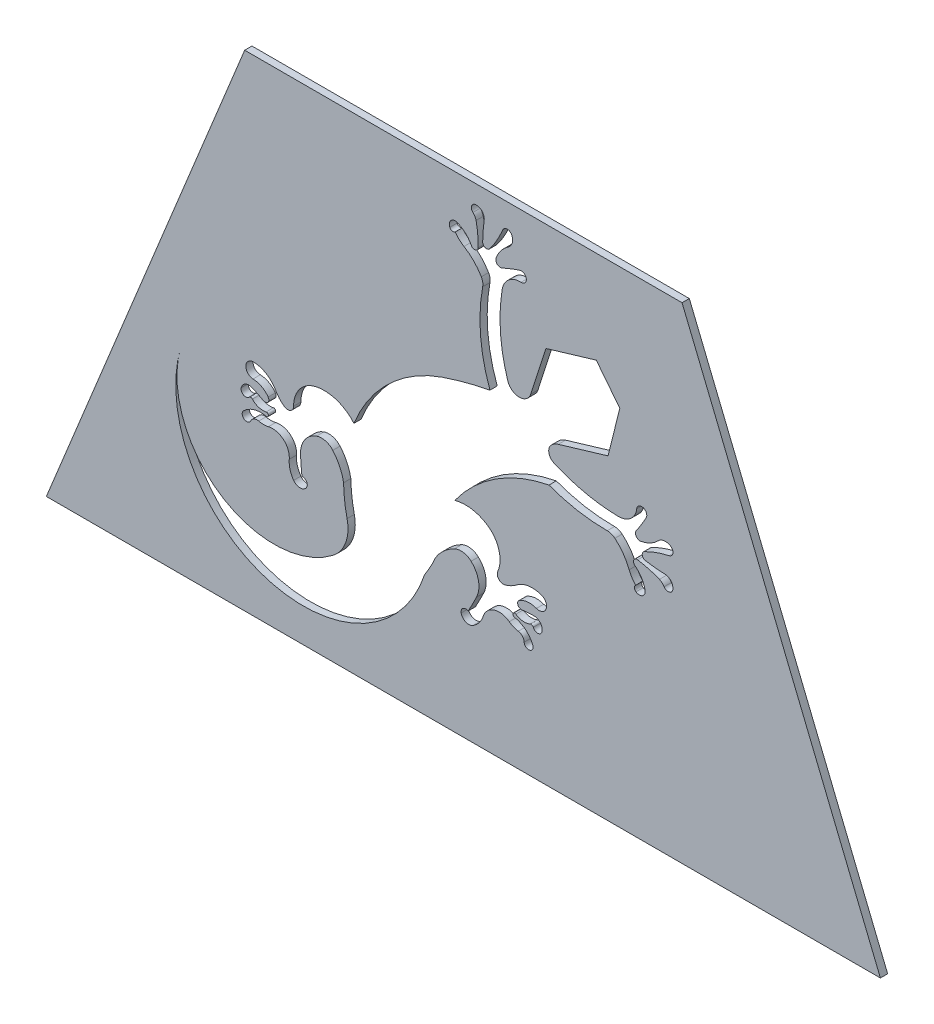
ISO-10303-21;
HEADER;
FILE_DESCRIPTION(('STEP AP214'),'2;1');
FILE_NAME('part.step','',(''),(''),'','','');
FILE_SCHEMA(('AUTOMOTIVE_DESIGN { 1 0 10303 214 1 1 1 1 }'));
ENDSEC;
DATA;
#1=APPLICATION_CONTEXT('core data for automotive mechanical design processes');
#2=APPLICATION_PROTOCOL_DEFINITION('international standard','automotive_design',2000,#1);
#3=PRODUCT_CONTEXT('',#1,'mechanical');
#4=PRODUCT('Part','Part','',(#3));
#5=PRODUCT_RELATED_PRODUCT_CATEGORY('part','',(#4));
#6=PRODUCT_DEFINITION_FORMATION('','',#4);
#7=PRODUCT_DEFINITION_CONTEXT('part definition',#1,'design');
#8=PRODUCT_DEFINITION('design','',#6,#7);
#9=PRODUCT_DEFINITION_SHAPE('','',#8);
#10=(LENGTH_UNIT() NAMED_UNIT(*) SI_UNIT(.MILLI.,.METRE.));
#11=(NAMED_UNIT(*) PLANE_ANGLE_UNIT() SI_UNIT($,.RADIAN.));
#12=(NAMED_UNIT(*) SI_UNIT($,.STERADIAN.) SOLID_ANGLE_UNIT());
#13=UNCERTAINTY_MEASURE_WITH_UNIT(LENGTH_MEASURE(1.E-05),#10,'distance_accuracy_value','');
#14=(GEOMETRIC_REPRESENTATION_CONTEXT(3) GLOBAL_UNCERTAINTY_ASSIGNED_CONTEXT((#13)) GLOBAL_UNIT_ASSIGNED_CONTEXT((#10,
#11,#12)) REPRESENTATION_CONTEXT('',''));
#15=CARTESIAN_POINT('',(0.,0.,0.));
#16=DIRECTION('',(0.,0.,1.));
#17=DIRECTION('',(1.,0.,0.));
#18=AXIS2_PLACEMENT_3D('',#15,#16,#17);
#19=CARTESIAN_POINT('',(43.376737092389,1315.26320239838,6.35));
#20=DIRECTION('',(0.,0.,-1.));
#21=DIRECTION('',(-1.,0.,0.));
#22=AXIS2_PLACEMENT_3D('',#19,#20,#21);
#23=CYLINDRICAL_SURFACE('',#22,7.62);
#24=CARTESIAN_POINT('',(43.376737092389,1315.26320239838,0.));
#25=DIRECTION('',(0.,0.,1.));
#26=DIRECTION('',(1.,0.,0.));
#27=AXIS2_PLACEMENT_3D('',#24,#25,#26);
#28=CIRCLE('',#27,7.62);
#29=CARTESIAN_POINT('',(38.0008563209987,1320.66360108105,0.));
#30=VERTEX_POINT('',#29);
#31=CARTESIAN_POINT('',(40.2724709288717,1308.30418439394,0.));
#32=VERTEX_POINT('',#31);
#33=EDGE_CURVE('E1114',#30,#32,#28,.T.);
#34=ORIENTED_EDGE('',*,*,#33,.T.);
#35=DIRECTION('',(0.,0.,-1.));
#36=VECTOR('',#35,1.);
#37=CARTESIAN_POINT('',(40.2724709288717,1308.30418439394,6.35));
#38=LINE('',#37,#36);
#39=CARTESIAN_POINT('',(40.2724709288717,1308.30418439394,6.35));
#40=VERTEX_POINT('',#39);
#41=EDGE_CURVE('E11',#40,#32,#38,.T.);
#42=ORIENTED_EDGE('',*,*,#41,.F.);
#43=CARTESIAN_POINT('',(43.376737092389,1315.26320239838,6.35));
#44=DIRECTION('',(0.,0.,1.));
#45=DIRECTION('',(1.,0.,0.));
#46=AXIS2_PLACEMENT_3D('',#43,#44,#45);
#47=CIRCLE('',#46,7.62);
#48=CARTESIAN_POINT('',(38.0008563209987,1320.66360108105,6.35));
#49=VERTEX_POINT('',#48);
#50=EDGE_CURVE('E1983',#49,#40,#47,.T.);
#51=ORIENTED_EDGE('',*,*,#50,.F.);
#52=DIRECTION('',(0.,0.,-1.));
#53=VECTOR('',#52,1.);
#54=CARTESIAN_POINT('',(38.0008563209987,1320.66360108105,6.35));
#55=LINE('',#54,#53);
#56=EDGE_CURVE('E1532',#49,#30,#55,.T.);
#57=ORIENTED_EDGE('',*,*,#56,.T.);
#58=EDGE_LOOP('',(#34,#42,#51,#57));
#59=FACE_BOUND('',#58,.T.);
#60=ADVANCED_FACE('F40',(#59),#23,.T.);
#61=CARTESIAN_POINT('',(97.6400648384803,1436.90853011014,6.35));
#62=DIRECTION('',(0.,0.,-1.));
#63=DIRECTION('',(-1.,0.,0.));
#64=AXIS2_PLACEMENT_3D('',#61,#62,#63);
#65=CYLINDRICAL_SURFACE('',#64,140.819453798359);
#66=CARTESIAN_POINT('',(97.6400648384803,1436.90853011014,0.));
#67=DIRECTION('',(0.,0.,1.));
#68=DIRECTION('',(1.,0.,0.));
#69=AXIS2_PLACEMENT_3D('',#66,#67,#68);
#70=CIRCLE('',#69,140.819453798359);
#71=CARTESIAN_POINT('',(70.9297717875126,1298.64545183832,0.));
#72=VERTEX_POINT('',#71);
#73=EDGE_CURVE('E1117',#32,#72,#70,.T.);
#74=ORIENTED_EDGE('',*,*,#73,.T.);
#75=DIRECTION('',(0.,0.,-1.));
#76=VECTOR('',#75,1.);
#77=CARTESIAN_POINT('',(70.9297717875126,1298.64545183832,6.35));
#78=LINE('',#77,#76);
#79=CARTESIAN_POINT('',(70.9297717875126,1298.64545183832,6.35));
#80=VERTEX_POINT('',#79);
#81=EDGE_CURVE('E51',#80,#72,#78,.T.);
#82=ORIENTED_EDGE('',*,*,#81,.F.);
#83=CARTESIAN_POINT('',(97.6400648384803,1436.90853011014,6.35));
#84=DIRECTION('',(0.,0.,1.));
#85=DIRECTION('',(1.,0.,0.));
#86=AXIS2_PLACEMENT_3D('',#83,#84,#85);
#87=CIRCLE('',#86,140.819453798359);
#88=EDGE_CURVE('E1986',#40,#80,#87,.T.);
#89=ORIENTED_EDGE('',*,*,#88,.F.);
#90=ORIENTED_EDGE('',*,*,#41,.T.);
#91=EDGE_LOOP('',(#74,#82,#89,#90));
#92=FACE_BOUND('',#91,.T.);
#93=ADVANCED_FACE('F2411',(#92),#65,.T.);
#94=CARTESIAN_POINT('',(99.3015567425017,1445.50907165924,6.35));
#95=DIRECTION('',(0.,0.,-1.));
#96=DIRECTION('',(-1.,0.,0.));
#97=AXIS2_PLACEMENT_3D('',#94,#95,#96);
#98=CYLINDRICAL_SURFACE('',#97,149.579012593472);
#99=CARTESIAN_POINT('',(99.3015567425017,1445.50907165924,0.));
#100=DIRECTION('',(0.,0.,1.));
#101=DIRECTION('',(1.,0.,0.));
#102=AXIS2_PLACEMENT_3D('',#99,#100,#101);
#103=CIRCLE('',#102,149.579012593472);
#104=CARTESIAN_POINT('',(96.3770169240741,1295.95865181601,0.));
#105=VERTEX_POINT('',#104);
#106=EDGE_CURVE('E1120',#72,#105,#103,.T.);
#107=ORIENTED_EDGE('',*,*,#106,.T.);
#108=DIRECTION('',(0.,0.,-1.));
#109=VECTOR('',#108,1.);
#110=CARTESIAN_POINT('',(96.3770169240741,1295.95865181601,6.35));
#111=LINE('',#110,#109);
#112=CARTESIAN_POINT('',(96.3770169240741,1295.95865181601,6.35));
#113=VERTEX_POINT('',#112);
#114=EDGE_CURVE('E1931',#113,#105,#111,.T.);
#115=ORIENTED_EDGE('',*,*,#114,.F.);
#116=CARTESIAN_POINT('',(99.3015567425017,1445.50907165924,6.35));
#117=DIRECTION('',(0.,0.,1.));
#118=DIRECTION('',(1.,0.,0.));
#119=AXIS2_PLACEMENT_3D('',#116,#117,#118);
#120=CIRCLE('',#119,149.579012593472);
#121=EDGE_CURVE('E1989',#80,#113,#120,.T.);
#122=ORIENTED_EDGE('',*,*,#121,.F.);
#123=ORIENTED_EDGE('',*,*,#81,.T.);
#124=EDGE_LOOP('',(#107,#115,#122,#123));
#125=FACE_BOUND('',#124,.T.);
#126=ADVANCED_FACE('F2417',(#125),#98,.T.);
#127=CARTESIAN_POINT('',(96.7020441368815,1312.57937136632,6.35));
#128=DIRECTION('',(0.,0.,-1.));
#129=DIRECTION('',(-1.,0.,0.));
#130=AXIS2_PLACEMENT_3D('',#127,#128,#129);
#131=CYLINDRICAL_SURFACE('',#130,16.6238972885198);
#132=CARTESIAN_POINT('',(96.7020441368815,1312.57937136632,0.));
#133=DIRECTION('',(0.,0.,1.));
#134=DIRECTION('',(1.,0.,0.));
#135=AXIS2_PLACEMENT_3D('',#132,#133,#134);
#136=CIRCLE('',#135,16.6238972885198);
#137=CARTESIAN_POINT('',(108.407347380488,1300.77514174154,0.));
#138=VERTEX_POINT('',#137);
#139=EDGE_CURVE('E1123',#105,#138,#136,.T.);
#140=ORIENTED_EDGE('',*,*,#139,.T.);
#141=DIRECTION('',(0.,0.,-1.));
#142=VECTOR('',#141,1.);
#143=CARTESIAN_POINT('',(108.407347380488,1300.77514174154,6.35));
#144=LINE('',#143,#142);
#145=CARTESIAN_POINT('',(108.407347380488,1300.77514174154,6.35));
#146=VERTEX_POINT('',#145);
#147=EDGE_CURVE('E1927',#146,#138,#144,.T.);
#148=ORIENTED_EDGE('',*,*,#147,.F.);
#149=CARTESIAN_POINT('',(96.7020441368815,1312.57937136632,6.35));
#150=DIRECTION('',(0.,0.,1.));
#151=DIRECTION('',(1.,0.,0.));
#152=AXIS2_PLACEMENT_3D('',#149,#150,#151);
#153=CIRCLE('',#152,16.6238972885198);
#154=EDGE_CURVE('E1992',#113,#146,#153,.T.);
#155=ORIENTED_EDGE('',*,*,#154,.F.);
#156=ORIENTED_EDGE('',*,*,#114,.T.);
#157=EDGE_LOOP('',(#140,#148,#155,#156));
#158=FACE_BOUND('',#157,.T.);
#159=ADVANCED_FACE('F3638',(#158),#131,.T.);
#160=CARTESIAN_POINT('',(97.9832221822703,1311.28736555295,6.35));
#161=DIRECTION('',(0.,0.,-1.));
#162=DIRECTION('',(-1.,0.,0.));
#163=AXIS2_PLACEMENT_3D('',#160,#161,#162);
#164=CYLINDRICAL_SURFACE('',#163,14.8043654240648);
#165=CARTESIAN_POINT('',(97.9832221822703,1311.28736555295,0.));
#166=DIRECTION('',(0.,0.,1.));
#167=DIRECTION('',(1.,0.,0.));
#168=AXIS2_PLACEMENT_3D('',#165,#166,#167);
#169=CIRCLE('',#168,14.8043654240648);
#170=CARTESIAN_POINT('',(112.703548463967,1309.71217357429,0.));
#171=VERTEX_POINT('',#170);
#172=EDGE_CURVE('E1126',#138,#171,#169,.T.);
#173=ORIENTED_EDGE('',*,*,#172,.T.);
#174=DIRECTION('',(0.,0.,-1.));
#175=VECTOR('',#174,1.);
#176=CARTESIAN_POINT('',(112.703548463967,1309.71217357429,6.35));
#177=LINE('',#176,#175);
#178=CARTESIAN_POINT('',(112.703548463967,1309.71217357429,6.35));
#179=VERTEX_POINT('',#178);
#180=EDGE_CURVE('E1923',#179,#171,#177,.T.);
#181=ORIENTED_EDGE('',*,*,#180,.F.);
#182=CARTESIAN_POINT('',(97.9832221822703,1311.28736555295,6.35));
#183=DIRECTION('',(0.,0.,1.));
#184=DIRECTION('',(1.,0.,0.));
#185=AXIS2_PLACEMENT_3D('',#182,#183,#184);
#186=CIRCLE('',#185,14.8043654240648);
#187=EDGE_CURVE('E1995',#146,#179,#186,.T.);
#188=ORIENTED_EDGE('',*,*,#187,.F.);
#189=ORIENTED_EDGE('',*,*,#147,.T.);
#190=EDGE_LOOP('',(#173,#181,#188,#189));
#191=FACE_BOUND('',#190,.T.);
#192=ADVANCED_FACE('F3628',(#191),#164,.T.);
#193=CARTESIAN_POINT('',(117.083690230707,1309.24346357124,6.35));
#194=DIRECTION('',(0.,0.,-1.));
#195=DIRECTION('',(-1.,0.,0.));
#196=AXIS2_PLACEMENT_3D('',#193,#194,#195);
#197=CYLINDRICAL_SURFACE('',#196,4.40514823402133);
#198=CARTESIAN_POINT('',(117.083690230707,1309.24346357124,0.));
#199=DIRECTION('',(0.,0.,1.));
#200=DIRECTION('',(1.,0.,0.));
#201=AXIS2_PLACEMENT_3D('',#198,#199,#200);
#202=CIRCLE('',#201,4.40514823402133);
#203=CARTESIAN_POINT('',(120.969595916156,1307.16859780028,0.));
#204=VERTEX_POINT('',#203);
#205=EDGE_CURVE('E1129',#171,#204,#202,.F.);
#206=ORIENTED_EDGE('',*,*,#205,.T.);
#207=DIRECTION('',(0.,0.,-1.));
#208=VECTOR('',#207,1.);
#209=CARTESIAN_POINT('',(120.969595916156,1307.16859780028,6.35));
#210=LINE('',#209,#208);
#211=CARTESIAN_POINT('',(120.969595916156,1307.16859780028,6.35));
#212=VERTEX_POINT('',#211);
#213=EDGE_CURVE('E1919',#212,#204,#210,.T.);
#214=ORIENTED_EDGE('',*,*,#213,.F.);
#215=CARTESIAN_POINT('',(117.083690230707,1309.24346357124,6.35));
#216=DIRECTION('',(0.,0.,1.));
#217=DIRECTION('',(1.,0.,0.));
#218=AXIS2_PLACEMENT_3D('',#215,#216,#217);
#219=CIRCLE('',#218,4.40514823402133);
#220=EDGE_CURVE('E1998',#179,#212,#219,.F.);
#221=ORIENTED_EDGE('',*,*,#220,.F.);
#222=ORIENTED_EDGE('',*,*,#180,.T.);
#223=EDGE_LOOP('',(#206,#214,#221,#222));
#224=FACE_BOUND('',#223,.T.);
#225=ADVANCED_FACE('F3618',(#224),#197,.F.);
#226=CARTESIAN_POINT('',(-2.48296140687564,1373.08565968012,6.35));
#227=DIRECTION('',(0.,0.,-1.));
#228=DIRECTION('',(-1.,0.,0.));
#229=AXIS2_PLACEMENT_3D('',#226,#227,#228);
#230=CYLINDRICAL_SURFACE('',#229,139.948536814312);
#231=CARTESIAN_POINT('',(-2.48296140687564,1373.08565968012,0.));
#232=DIRECTION('',(0.,0.,1.));
#233=DIRECTION('',(1.,0.,0.));
#234=AXIS2_PLACEMENT_3D('',#231,#232,#233);
#235=CIRCLE('',#234,139.948536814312);
#236=CARTESIAN_POINT('',(112.352820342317,1293.09605919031,0.));
#237=VERTEX_POINT('',#236);
#238=EDGE_CURVE('E1132',#204,#237,#235,.F.);
#239=ORIENTED_EDGE('',*,*,#238,.T.);
#240=DIRECTION('',(0.,0.,-1.));
#241=VECTOR('',#240,1.);
#242=CARTESIAN_POINT('',(112.352820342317,1293.09605919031,6.35));
#243=LINE('',#242,#241);
#244=CARTESIAN_POINT('',(112.352820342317,1293.09605919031,6.35));
#245=VERTEX_POINT('',#244);
#246=EDGE_CURVE('E1915',#245,#237,#243,.T.);
#247=ORIENTED_EDGE('',*,*,#246,.F.);
#248=CARTESIAN_POINT('',(-2.48296140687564,1373.08565968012,6.35));
#249=DIRECTION('',(0.,0.,1.));
#250=DIRECTION('',(1.,0.,0.));
#251=AXIS2_PLACEMENT_3D('',#248,#249,#250);
#252=CIRCLE('',#251,139.948536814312);
#253=EDGE_CURVE('E2001',#212,#245,#252,.F.);
#254=ORIENTED_EDGE('',*,*,#253,.F.);
#255=ORIENTED_EDGE('',*,*,#213,.T.);
#256=EDGE_LOOP('',(#239,#247,#254,#255));
#257=FACE_BOUND('',#256,.T.);
#258=ADVANCED_FACE('F3608',(#257),#230,.F.);
#259=CARTESIAN_POINT('',(115.594396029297,1290.83811884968,6.35));
#260=DIRECTION('',(0.,0.,-1.));
#261=DIRECTION('',(-1.,0.,0.));
#262=AXIS2_PLACEMENT_3D('',#259,#260,#261);
#263=CYLINDRICAL_SURFACE('',#262,3.95045662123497);
#264=CARTESIAN_POINT('',(115.594396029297,1290.83811884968,0.));
#265=DIRECTION('',(0.,0.,1.));
#266=DIRECTION('',(1.,0.,0.));
#267=AXIS2_PLACEMENT_3D('',#264,#265,#266);
#268=CIRCLE('',#267,3.95045662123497);
#269=CARTESIAN_POINT('',(116.281705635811,1286.94791152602,0.));
#270=VERTEX_POINT('',#269);
#271=EDGE_CURVE('E1135',#237,#270,#268,.T.);
#272=ORIENTED_EDGE('',*,*,#271,.T.);
#273=DIRECTION('',(0.,0.,-1.));
#274=VECTOR('',#273,1.);
#275=CARTESIAN_POINT('',(116.281705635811,1286.94791152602,6.35));
#276=LINE('',#275,#274);
#277=CARTESIAN_POINT('',(116.281705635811,1286.94791152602,6.35));
#278=VERTEX_POINT('',#277);
#279=EDGE_CURVE('E1911',#278,#270,#276,.T.);
#280=ORIENTED_EDGE('',*,*,#279,.F.);
#281=CARTESIAN_POINT('',(115.594396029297,1290.83811884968,6.35));
#282=DIRECTION('',(0.,0.,1.));
#283=DIRECTION('',(1.,0.,0.));
#284=AXIS2_PLACEMENT_3D('',#281,#282,#283);
#285=CIRCLE('',#284,3.95045662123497);
#286=EDGE_CURVE('E2004',#245,#278,#285,.T.);
#287=ORIENTED_EDGE('',*,*,#286,.F.);
#288=ORIENTED_EDGE('',*,*,#246,.T.);
#289=EDGE_LOOP('',(#272,#280,#287,#288));
#290=FACE_BOUND('',#289,.T.);
#291=ADVANCED_FACE('F3598',(#290),#263,.T.);
#292=CARTESIAN_POINT('',(111.360718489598,1314.80094901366,6.35));
#293=DIRECTION('',(0.,0.,-1.));
#294=DIRECTION('',(-1.,0.,0.));
#295=AXIS2_PLACEMENT_3D('',#292,#293,#294);
#296=CYLINDRICAL_SURFACE('',#295,28.2844093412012);
#297=CARTESIAN_POINT('',(111.360718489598,1314.80094901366,0.));
#298=DIRECTION('',(0.,0.,1.));
#299=DIRECTION('',(1.,0.,0.));
#300=AXIS2_PLACEMENT_3D('',#297,#298,#299);
#301=CIRCLE('',#300,28.2844093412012);
#302=CARTESIAN_POINT('',(131.593813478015,1295.03659526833,0.));
#303=VERTEX_POINT('',#302);
#304=EDGE_CURVE('E1138',#270,#303,#301,.T.);
#305=ORIENTED_EDGE('',*,*,#304,.T.);
#306=DIRECTION('',(0.,0.,-1.));
#307=VECTOR('',#306,1.);
#308=CARTESIAN_POINT('',(131.593813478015,1295.03659526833,6.35));
#309=LINE('',#308,#307);
#310=CARTESIAN_POINT('',(131.593813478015,1295.03659526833,6.35));
#311=VERTEX_POINT('',#310);
#312=EDGE_CURVE('E1907',#311,#303,#309,.T.);
#313=ORIENTED_EDGE('',*,*,#312,.F.);
#314=CARTESIAN_POINT('',(111.360718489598,1314.80094901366,6.35));
#315=DIRECTION('',(0.,0.,1.));
#316=DIRECTION('',(1.,0.,0.));
#317=AXIS2_PLACEMENT_3D('',#314,#315,#316);
#318=CIRCLE('',#317,28.2844093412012);
#319=EDGE_CURVE('E2007',#278,#311,#318,.T.);
#320=ORIENTED_EDGE('',*,*,#319,.F.);
#321=ORIENTED_EDGE('',*,*,#279,.T.);
#322=EDGE_LOOP('',(#305,#313,#320,#321));
#323=FACE_BOUND('',#322,.T.);
#324=ADVANCED_FACE('F3588',(#323),#296,.T.);
#325=CARTESIAN_POINT('',(137.775374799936,1288.99824252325,6.35));
#326=DIRECTION('',(0.,0.,-1.));
#327=DIRECTION('',(-1.,0.,0.));
#328=AXIS2_PLACEMENT_3D('',#325,#326,#327);
#329=CYLINDRICAL_SURFACE('',#328,8.6413774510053);
#330=CARTESIAN_POINT('',(137.775374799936,1288.99824252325,0.));
#331=DIRECTION('',(0.,0.,1.));
#332=DIRECTION('',(1.,0.,0.));
#333=AXIS2_PLACEMENT_3D('',#330,#331,#332);
#334=CIRCLE('',#333,8.6413774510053);
#335=CARTESIAN_POINT('',(142.408029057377,1296.29289253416,0.));
#336=VERTEX_POINT('',#335);
#337=EDGE_CURVE('E1141',#303,#336,#334,.F.);
#338=ORIENTED_EDGE('',*,*,#337,.T.);
#339=DIRECTION('',(0.,0.,-1.));
#340=VECTOR('',#339,1.);
#341=CARTESIAN_POINT('',(142.408029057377,1296.29289253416,6.35));
#342=LINE('',#341,#340);
#343=CARTESIAN_POINT('',(142.408029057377,1296.29289253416,6.35));
#344=VERTEX_POINT('',#343);
#345=EDGE_CURVE('E1903',#344,#336,#342,.T.);
#346=ORIENTED_EDGE('',*,*,#345,.F.);
#347=CARTESIAN_POINT('',(137.775374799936,1288.99824252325,6.35));
#348=DIRECTION('',(0.,0.,1.));
#349=DIRECTION('',(1.,0.,0.));
#350=AXIS2_PLACEMENT_3D('',#347,#348,#349);
#351=CIRCLE('',#350,8.6413774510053);
#352=EDGE_CURVE('E2010',#311,#344,#351,.F.);
#353=ORIENTED_EDGE('',*,*,#352,.F.);
#354=ORIENTED_EDGE('',*,*,#312,.T.);
#355=EDGE_LOOP('',(#338,#346,#353,#354));
#356=FACE_BOUND('',#355,.T.);
#357=ADVANCED_FACE('F3578',(#356),#329,.F.);
#358=CARTESIAN_POINT('',(140.091701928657,1292.64556752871,6.35));
#359=DIRECTION('',(0.,0.,-1.));
#360=DIRECTION('',(-1.,0.,0.));
#361=AXIS2_PLACEMENT_3D('',#358,#359,#360);
#362=CYLINDRICAL_SURFACE('',#361,4.32068872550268);
#363=CARTESIAN_POINT('',(140.091701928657,1292.64556752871,0.));
#364=DIRECTION('',(0.,0.,1.));
#365=DIRECTION('',(1.,0.,0.));
#366=AXIS2_PLACEMENT_3D('',#363,#364,#365);
#367=CIRCLE('',#366,4.32068872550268);
#368=CARTESIAN_POINT('',(140.997500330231,1288.42089235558,0.));
#369=VERTEX_POINT('',#368);
#370=EDGE_CURVE('E1144',#336,#369,#367,.F.);
#371=ORIENTED_EDGE('',*,*,#370,.T.);
#372=DIRECTION('',(0.,0.,-1.));
#373=VECTOR('',#372,1.);
#374=CARTESIAN_POINT('',(140.997500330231,1288.42089235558,6.35));
#375=LINE('',#374,#373);
#376=CARTESIAN_POINT('',(140.997500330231,1288.42089235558,6.35));
#377=VERTEX_POINT('',#376);
#378=EDGE_CURVE('E1899',#377,#369,#375,.T.);
#379=ORIENTED_EDGE('',*,*,#378,.F.);
#380=CARTESIAN_POINT('',(140.091701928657,1292.64556752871,6.35));
#381=DIRECTION('',(0.,0.,1.));
#382=DIRECTION('',(1.,0.,0.));
#383=AXIS2_PLACEMENT_3D('',#380,#381,#382);
#384=CIRCLE('',#383,4.32068872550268);
#385=EDGE_CURVE('E2013',#344,#377,#384,.F.);
#386=ORIENTED_EDGE('',*,*,#385,.F.);
#387=ORIENTED_EDGE('',*,*,#345,.T.);
#388=EDGE_LOOP('',(#371,#379,#386,#387));
#389=FACE_BOUND('',#388,.T.);
#390=ADVANCED_FACE('F3568',(#389),#362,.F.);
#391=CARTESIAN_POINT('',(159.179269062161,1203.62049214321,6.35));
#392=DIRECTION('',(0.,0.,-1.));
#393=DIRECTION('',(-1.,0.,0.));
#394=AXIS2_PLACEMENT_3D('',#391,#392,#393);
#395=CYLINDRICAL_SURFACE('',#394,86.7276460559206);
#396=CARTESIAN_POINT('',(159.179269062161,1203.62049214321,0.));
#397=DIRECTION('',(0.,0.,1.));
#398=DIRECTION('',(1.,0.,0.));
#399=AXIS2_PLACEMENT_3D('',#396,#397,#398);
#400=CIRCLE('',#399,86.7276460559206);
#401=CARTESIAN_POINT('',(119.334078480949,1280.65324737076,0.));
#402=VERTEX_POINT('',#401);
#403=EDGE_CURVE('E1147',#369,#402,#400,.T.);
#404=ORIENTED_EDGE('',*,*,#403,.T.);
#405=DIRECTION('',(0.,0.,-1.));
#406=VECTOR('',#405,1.);
#407=CARTESIAN_POINT('',(119.334078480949,1280.65324737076,6.35));
#408=LINE('',#407,#406);
#409=CARTESIAN_POINT('',(119.334078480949,1280.65324737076,6.35));
#410=VERTEX_POINT('',#409);
#411=EDGE_CURVE('E1895',#410,#402,#408,.T.);
#412=ORIENTED_EDGE('',*,*,#411,.F.);
#413=CARTESIAN_POINT('',(159.179269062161,1203.62049214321,6.35));
#414=DIRECTION('',(0.,0.,1.));
#415=DIRECTION('',(1.,0.,0.));
#416=AXIS2_PLACEMENT_3D('',#413,#414,#415);
#417=CIRCLE('',#416,86.7276460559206);
#418=EDGE_CURVE('E2016',#377,#410,#417,.T.);
#419=ORIENTED_EDGE('',*,*,#418,.F.);
#420=ORIENTED_EDGE('',*,*,#378,.T.);
#421=EDGE_LOOP('',(#404,#412,#419,#420));
#422=FACE_BOUND('',#421,.T.);
#423=ADVANCED_FACE('F3558',(#422),#395,.T.);
#424=CARTESIAN_POINT('',(120.880682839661,1277.66319529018,6.35));
#425=DIRECTION('',(0.,0.,-1.));
#426=DIRECTION('',(-1.,0.,0.));
#427=AXIS2_PLACEMENT_3D('',#424,#425,#426);
#428=CYLINDRICAL_SURFACE('',#427,3.36636250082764);
#429=CARTESIAN_POINT('',(120.880682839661,1277.66319529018,0.));
#430=DIRECTION('',(0.,0.,1.));
#431=DIRECTION('',(1.,0.,0.));
#432=AXIS2_PLACEMENT_3D('',#429,#430,#431);
#433=CIRCLE('',#432,3.36636250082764);
#434=CARTESIAN_POINT('',(120.328261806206,1274.34246833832,0.));
#435=VERTEX_POINT('',#434);
#436=EDGE_CURVE('E1150',#402,#435,#433,.T.);
#437=ORIENTED_EDGE('',*,*,#436,.T.);
#438=DIRECTION('',(0.,0.,-1.));
#439=VECTOR('',#438,1.);
#440=CARTESIAN_POINT('',(120.328261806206,1274.34246833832,6.35));
#441=LINE('',#440,#439);
#442=CARTESIAN_POINT('',(120.328261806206,1274.34246833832,6.35));
#443=VERTEX_POINT('',#442);
#444=EDGE_CURVE('E1891',#443,#435,#441,.T.);
#445=ORIENTED_EDGE('',*,*,#444,.F.);
#446=CARTESIAN_POINT('',(120.880682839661,1277.66319529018,6.35));
#447=DIRECTION('',(0.,0.,1.));
#448=DIRECTION('',(1.,0.,0.));
#449=AXIS2_PLACEMENT_3D('',#446,#447,#448);
#450=CIRCLE('',#449,3.36636250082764);
#451=EDGE_CURVE('E2019',#410,#443,#450,.T.);
#452=ORIENTED_EDGE('',*,*,#451,.F.);
#453=ORIENTED_EDGE('',*,*,#411,.T.);
#454=EDGE_LOOP('',(#437,#445,#452,#453));
#455=FACE_BOUND('',#454,.T.);
#456=ADVANCED_FACE('F3548',(#455),#428,.T.);
#457=CARTESIAN_POINT('',(142.248759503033,1406.1115051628,6.35));
#458=DIRECTION('',(0.,0.,-1.));
#459=DIRECTION('',(-1.,0.,0.));
#460=AXIS2_PLACEMENT_3D('',#457,#458,#459);
#461=CYLINDRICAL_SURFACE('',#460,133.579891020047);
#462=CARTESIAN_POINT('',(142.248759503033,1406.1115051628,0.));
#463=DIRECTION('',(0.,0.,1.));
#464=DIRECTION('',(1.,0.,0.));
#465=AXIS2_PLACEMENT_3D('',#462,#463,#464);
#466=CIRCLE('',#465,133.579891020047);
#467=CARTESIAN_POINT('',(137.42150373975,1272.61886534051,0.));
#468=VERTEX_POINT('',#467);
#469=EDGE_CURVE('E1153',#435,#468,#466,.T.);
#470=ORIENTED_EDGE('',*,*,#469,.T.);
#471=DIRECTION('',(0.,0.,-1.));
#472=VECTOR('',#471,1.);
#473=CARTESIAN_POINT('',(137.42150373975,1272.61886534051,6.35));
#474=LINE('',#473,#472);
#475=CARTESIAN_POINT('',(137.42150373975,1272.61886534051,6.35));
#476=VERTEX_POINT('',#475);
#477=EDGE_CURVE('E1887',#476,#468,#474,.T.);
#478=ORIENTED_EDGE('',*,*,#477,.F.);
#479=CARTESIAN_POINT('',(142.248759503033,1406.1115051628,6.35));
#480=DIRECTION('',(0.,0.,1.));
#481=DIRECTION('',(1.,0.,0.));
#482=AXIS2_PLACEMENT_3D('',#479,#480,#481);
#483=CIRCLE('',#482,133.579891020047);
#484=EDGE_CURVE('E2022',#443,#476,#483,.T.);
#485=ORIENTED_EDGE('',*,*,#484,.F.);
#486=ORIENTED_EDGE('',*,*,#444,.T.);
#487=EDGE_LOOP('',(#470,#478,#485,#486));
#488=FACE_BOUND('',#487,.T.);
#489=ADVANCED_FACE('F3538',(#488),#461,.T.);
#490=CARTESIAN_POINT('',(137.16257342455,1265.45842201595,6.35));
#491=DIRECTION('',(0.,0.,-1.));
#492=DIRECTION('',(-1.,0.,0.));
#493=AXIS2_PLACEMENT_3D('',#490,#491,#492);
#494=CYLINDRICAL_SURFACE('',#493,7.16512341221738);
#495=CARTESIAN_POINT('',(137.16257342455,1265.45842201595,0.));
#496=DIRECTION('',(0.,0.,1.));
#497=DIRECTION('',(1.,0.,0.));
#498=AXIS2_PLACEMENT_3D('',#495,#496,#497);
#499=CIRCLE('',#498,7.16512341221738);
#500=CARTESIAN_POINT('',(144.199864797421,1264.11100832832,0.));
#501=VERTEX_POINT('',#500);
#502=EDGE_CURVE('E1156',#468,#501,#499,.F.);
#503=ORIENTED_EDGE('',*,*,#502,.T.);
#504=DIRECTION('',(0.,0.,-1.));
#505=VECTOR('',#504,1.);
#506=CARTESIAN_POINT('',(144.199864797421,1264.11100832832,6.35));
#507=LINE('',#506,#505);
#508=CARTESIAN_POINT('',(144.199864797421,1264.11100832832,6.35));
#509=VERTEX_POINT('',#508);
#510=EDGE_CURVE('E1883',#509,#501,#507,.T.);
#511=ORIENTED_EDGE('',*,*,#510,.F.);
#512=CARTESIAN_POINT('',(137.16257342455,1265.45842201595,6.35));
#513=DIRECTION('',(0.,0.,1.));
#514=DIRECTION('',(1.,0.,0.));
#515=AXIS2_PLACEMENT_3D('',#512,#513,#514);
#516=CIRCLE('',#515,7.16512341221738);
#517=EDGE_CURVE('E2025',#476,#509,#516,.F.);
#518=ORIENTED_EDGE('',*,*,#517,.F.);
#519=ORIENTED_EDGE('',*,*,#477,.T.);
#520=EDGE_LOOP('',(#503,#511,#518,#519));
#521=FACE_BOUND('',#520,.T.);
#522=ADVANCED_FACE('F3528',(#521),#494,.F.);
#523=CARTESIAN_POINT('',(140.179628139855,1264.88075361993,6.35));
#524=DIRECTION('',(0.,0.,-1.));
#525=DIRECTION('',(-1.,0.,0.));
#526=AXIS2_PLACEMENT_3D('',#523,#524,#525);
#527=CYLINDRICAL_SURFACE('',#526,4.09326405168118);
#528=CARTESIAN_POINT('',(140.179628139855,1264.88075361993,0.));
#529=DIRECTION('',(0.,0.,1.));
#530=DIRECTION('',(1.,0.,0.));
#531=AXIS2_PLACEMENT_3D('',#528,#529,#530);
#532=CIRCLE('',#531,4.09326405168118);
#533=CARTESIAN_POINT('',(136.678956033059,1262.75940843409,0.));
#534=VERTEX_POINT('',#533);
#535=EDGE_CURVE('E1159',#501,#534,#532,.F.);
#536=ORIENTED_EDGE('',*,*,#535,.T.);
#537=DIRECTION('',(0.,0.,-1.));
#538=VECTOR('',#537,1.);
#539=CARTESIAN_POINT('',(136.678956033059,1262.75940843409,6.35));
#540=LINE('',#539,#538);
#541=CARTESIAN_POINT('',(136.678956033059,1262.75940843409,6.35));
#542=VERTEX_POINT('',#541);
#543=EDGE_CURVE('E1879',#542,#534,#540,.T.);
#544=ORIENTED_EDGE('',*,*,#543,.F.);
#545=CARTESIAN_POINT('',(140.179628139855,1264.88075361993,6.35));
#546=DIRECTION('',(0.,0.,1.));
#547=DIRECTION('',(1.,0.,0.));
#548=AXIS2_PLACEMENT_3D('',#545,#546,#547);
#549=CIRCLE('',#548,4.09326405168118);
#550=EDGE_CURVE('E2028',#509,#542,#549,.F.);
#551=ORIENTED_EDGE('',*,*,#550,.F.);
#552=ORIENTED_EDGE('',*,*,#510,.T.);
#553=EDGE_LOOP('',(#536,#544,#551,#552));
#554=FACE_BOUND('',#553,.T.);
#555=ADVANCED_FACE('F3518',(#554),#527,.F.);
#556=CARTESIAN_POINT('',(129.286990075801,1258.28000821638,6.35));
#557=DIRECTION('',(0.,0.,-1.));
#558=DIRECTION('',(-1.,0.,0.));
#559=AXIS2_PLACEMENT_3D('',#556,#557,#558);
#560=CYLINDRICAL_SURFACE('',#559,8.64327409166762);
#561=CARTESIAN_POINT('',(129.286990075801,1258.28000821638,0.));
#562=DIRECTION('',(0.,0.,1.));
#563=DIRECTION('',(1.,0.,0.));
#564=AXIS2_PLACEMENT_3D('',#561,#562,#563);
#565=CIRCLE('',#564,8.64327409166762);
#566=CARTESIAN_POINT('',(132.54463040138,1266.28587897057,0.));
#567=VERTEX_POINT('',#566);
#568=EDGE_CURVE('E1162',#534,#567,#565,.T.);
#569=ORIENTED_EDGE('',*,*,#568,.T.);
#570=DIRECTION('',(0.,0.,-1.));
#571=VECTOR('',#570,1.);
#572=CARTESIAN_POINT('',(132.54463040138,1266.28587897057,6.35));
#573=LINE('',#572,#571);
#574=CARTESIAN_POINT('',(132.54463040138,1266.28587897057,6.35));
#575=VERTEX_POINT('',#574);
#576=EDGE_CURVE('E1875',#575,#567,#573,.T.);
#577=ORIENTED_EDGE('',*,*,#576,.F.);
#578=CARTESIAN_POINT('',(129.286990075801,1258.28000821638,6.35));
#579=DIRECTION('',(0.,0.,1.));
#580=DIRECTION('',(1.,0.,0.));
#581=AXIS2_PLACEMENT_3D('',#578,#579,#580);
#582=CIRCLE('',#581,8.64327409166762);
#583=EDGE_CURVE('E2031',#542,#575,#582,.T.);
#584=ORIENTED_EDGE('',*,*,#583,.F.);
#585=ORIENTED_EDGE('',*,*,#543,.T.);
#586=EDGE_LOOP('',(#569,#577,#584,#585));
#587=FACE_BOUND('',#586,.T.);
#588=ADVANCED_FACE('F3508',(#587),#560,.T.);
#589=CARTESIAN_POINT('',(100.074999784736,1186.48957238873,6.35));
#590=DIRECTION('',(0.,0.,-1.));
#591=DIRECTION('',(-1.,0.,0.));
#592=AXIS2_PLACEMENT_3D('',#589,#590,#591);
#593=CYLINDRICAL_SURFACE('',#592,86.1494483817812);
#594=CARTESIAN_POINT('',(100.074999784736,1186.48957238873,0.));
#595=DIRECTION('',(0.,0.,1.));
#596=DIRECTION('',(1.,0.,0.));
#597=AXIS2_PLACEMENT_3D('',#594,#595,#596);
#598=CIRCLE('',#597,86.1494483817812);
#599=CARTESIAN_POINT('',(113.528407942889,1271.58207067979,0.));
#600=VERTEX_POINT('',#599);
#601=EDGE_CURVE('E1165',#567,#600,#598,.T.);
#602=ORIENTED_EDGE('',*,*,#601,.T.);
#603=DIRECTION('',(0.,0.,-1.));
#604=VECTOR('',#603,1.);
#605=CARTESIAN_POINT('',(113.528407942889,1271.58207067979,6.35));
#606=LINE('',#605,#604);
#607=CARTESIAN_POINT('',(113.528407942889,1271.58207067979,6.35));
#608=VERTEX_POINT('',#607);
#609=EDGE_CURVE('E1871',#608,#600,#606,.T.);
#610=ORIENTED_EDGE('',*,*,#609,.F.);
#611=CARTESIAN_POINT('',(100.074999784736,1186.48957238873,6.35));
#612=DIRECTION('',(0.,0.,1.));
#613=DIRECTION('',(1.,0.,0.));
#614=AXIS2_PLACEMENT_3D('',#611,#612,#613);
#615=CIRCLE('',#614,86.1494483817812);
#616=EDGE_CURVE('E2034',#575,#608,#615,.T.);
#617=ORIENTED_EDGE('',*,*,#616,.F.);
#618=ORIENTED_EDGE('',*,*,#576,.T.);
#619=EDGE_LOOP('',(#602,#610,#617,#618));
#620=FACE_BOUND('',#619,.T.);
#621=ADVANCED_FACE('F3498',(#620),#593,.T.);
#622=CARTESIAN_POINT('',(113.034162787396,1268.45598139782,6.35));
#623=DIRECTION('',(0.,0.,-1.));
#624=DIRECTION('',(-1.,0.,0.));
#625=AXIS2_PLACEMENT_3D('',#622,#623,#624);
#626=CYLINDRICAL_SURFACE('',#625,3.1649190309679);
#627=CARTESIAN_POINT('',(113.034162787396,1268.45598139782,0.));
#628=DIRECTION('',(0.,0.,1.));
#629=DIRECTION('',(1.,0.,0.));
#630=AXIS2_PLACEMENT_3D('',#627,#628,#629);
#631=CIRCLE('',#630,3.1649190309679);
#632=CARTESIAN_POINT('',(111.130809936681,1265.92735323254,0.));
#633=VERTEX_POINT('',#632);
#634=EDGE_CURVE('E1168',#600,#633,#631,.T.);
#635=ORIENTED_EDGE('',*,*,#634,.T.);
#636=DIRECTION('',(0.,0.,-1.));
#637=VECTOR('',#636,1.);
#638=CARTESIAN_POINT('',(111.130809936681,1265.92735323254,6.35));
#639=LINE('',#638,#637);
#640=CARTESIAN_POINT('',(111.130809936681,1265.92735323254,6.35));
#641=VERTEX_POINT('',#640);
#642=EDGE_CURVE('E1867',#641,#633,#639,.T.);
#643=ORIENTED_EDGE('',*,*,#642,.F.);
#644=CARTESIAN_POINT('',(113.034162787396,1268.45598139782,6.35));
#645=DIRECTION('',(0.,0.,1.));
#646=DIRECTION('',(1.,0.,0.));
#647=AXIS2_PLACEMENT_3D('',#644,#645,#646);
#648=CIRCLE('',#647,3.1649190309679);
#649=EDGE_CURVE('E2037',#608,#641,#648,.T.);
#650=ORIENTED_EDGE('',*,*,#649,.F.);
#651=ORIENTED_EDGE('',*,*,#609,.T.);
#652=EDGE_LOOP('',(#635,#643,#650,#651));
#653=FACE_BOUND('',#652,.T.);
#654=ADVANCED_FACE('F3488',(#653),#626,.T.);
#655=CARTESIAN_POINT('',(96.9833276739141,1247.13224537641,6.35));
#656=DIRECTION('',(0.,0.,-1.));
#657=DIRECTION('',(-1.,0.,0.));
#658=AXIS2_PLACEMENT_3D('',#655,#656,#657);
#659=CYLINDRICAL_SURFACE('',#658,23.5246112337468);
#660=CARTESIAN_POINT('',(96.9833276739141,1247.13224537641,0.));
#661=DIRECTION('',(0.,0.,1.));
#662=DIRECTION('',(1.,0.,0.));
#663=AXIS2_PLACEMENT_3D('',#660,#661,#662);
#664=CIRCLE('',#663,23.5246112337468);
#665=CARTESIAN_POINT('',(120.029817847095,1251.8509977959,0.));
#666=VERTEX_POINT('',#665);
#667=EDGE_CURVE('E1171',#633,#666,#664,.F.);
#668=ORIENTED_EDGE('',*,*,#667,.T.);
#669=DIRECTION('',(0.,0.,-1.));
#670=VECTOR('',#669,1.);
#671=CARTESIAN_POINT('',(120.029817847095,1251.8509977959,6.35));
#672=LINE('',#671,#670);
#673=CARTESIAN_POINT('',(120.029817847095,1251.8509977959,6.35));
#674=VERTEX_POINT('',#673);
#675=EDGE_CURVE('E1863',#674,#666,#672,.T.);
#676=ORIENTED_EDGE('',*,*,#675,.F.);
#677=CARTESIAN_POINT('',(96.9833276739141,1247.13224537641,6.35));
#678=DIRECTION('',(0.,0.,1.));
#679=DIRECTION('',(1.,0.,0.));
#680=AXIS2_PLACEMENT_3D('',#677,#678,#679);
#681=CIRCLE('',#680,23.5246112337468);
#682=EDGE_CURVE('E2040',#641,#674,#681,.F.);
#683=ORIENTED_EDGE('',*,*,#682,.F.);
#684=ORIENTED_EDGE('',*,*,#642,.T.);
#685=EDGE_LOOP('',(#668,#676,#683,#684));
#686=FACE_BOUND('',#685,.T.);
#687=ADVANCED_FACE('F3478',(#686),#659,.F.);
#688=CARTESIAN_POINT('',(114.991687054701,1250.81944411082,6.35));
#689=DIRECTION('',(0.,0.,-1.));
#690=DIRECTION('',(-1.,0.,0.));
#691=AXIS2_PLACEMENT_3D('',#688,#689,#690);
#692=CYLINDRICAL_SURFACE('',#691,5.14265154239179);
#693=CARTESIAN_POINT('',(114.991687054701,1250.81944411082,0.));
#694=DIRECTION('',(0.,0.,1.));
#695=DIRECTION('',(1.,0.,0.));
#696=AXIS2_PLACEMENT_3D('',#693,#694,#695);
#697=CIRCLE('',#696,5.14265154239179);
#698=CARTESIAN_POINT('',(112.079735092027,1246.58064703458,0.));
#699=VERTEX_POINT('',#698);
#700=EDGE_CURVE('E1174',#666,#699,#697,.F.);
#701=ORIENTED_EDGE('',*,*,#700,.T.);
#702=DIRECTION('',(0.,0.,-1.));
#703=VECTOR('',#702,1.);
#704=CARTESIAN_POINT('',(112.079735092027,1246.58064703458,6.35));
#705=LINE('',#704,#703);
#706=CARTESIAN_POINT('',(112.079735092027,1246.58064703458,6.35));
#707=VERTEX_POINT('',#706);
#708=EDGE_CURVE('E1859',#707,#699,#705,.T.);
#709=ORIENTED_EDGE('',*,*,#708,.F.);
#710=CARTESIAN_POINT('',(114.991687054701,1250.81944411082,6.35));
#711=DIRECTION('',(0.,0.,1.));
#712=DIRECTION('',(1.,0.,0.));
#713=AXIS2_PLACEMENT_3D('',#710,#711,#712);
#714=CIRCLE('',#713,5.14265154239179);
#715=EDGE_CURVE('E2043',#674,#707,#714,.F.);
#716=ORIENTED_EDGE('',*,*,#715,.F.);
#717=ORIENTED_EDGE('',*,*,#675,.T.);
#718=EDGE_LOOP('',(#701,#709,#716,#717));
#719=FACE_BOUND('',#718,.T.);
#720=ADVANCED_FACE('F3468',(#719),#692,.F.);
#721=CARTESIAN_POINT('',(113.841090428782,1249.14457252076,6.35));
#722=DIRECTION('',(0.,0.,-1.));
#723=DIRECTION('',(-1.,0.,0.));
#724=AXIS2_PLACEMENT_3D('',#721,#722,#723);
#725=CYLINDRICAL_SURFACE('',#724,3.11064085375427);
#726=CARTESIAN_POINT('',(113.841090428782,1249.14457252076,0.));
#727=DIRECTION('',(0.,0.,1.));
#728=DIRECTION('',(1.,0.,0.));
#729=AXIS2_PLACEMENT_3D('',#726,#727,#728);
#730=CIRCLE('',#729,3.11064085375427);
#731=CARTESIAN_POINT('',(111.707271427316,1251.40795560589,0.));
#732=VERTEX_POINT('',#731);
#733=EDGE_CURVE('E1177',#699,#732,#730,.F.);
#734=ORIENTED_EDGE('',*,*,#733,.T.);
#735=DIRECTION('',(0.,0.,-1.));
#736=VECTOR('',#735,1.);
#737=CARTESIAN_POINT('',(111.707271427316,1251.40795560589,6.35));
#738=LINE('',#737,#736);
#739=CARTESIAN_POINT('',(111.707271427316,1251.40795560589,6.35));
#740=VERTEX_POINT('',#739);
#741=EDGE_CURVE('E1855',#740,#732,#738,.T.);
#742=ORIENTED_EDGE('',*,*,#741,.F.);
#743=CARTESIAN_POINT('',(113.841090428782,1249.14457252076,6.35));
#744=DIRECTION('',(0.,0.,1.));
#745=DIRECTION('',(1.,0.,0.));
#746=AXIS2_PLACEMENT_3D('',#743,#744,#745);
#747=CIRCLE('',#746,3.11064085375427);
#748=EDGE_CURVE('E2046',#707,#740,#747,.F.);
#749=ORIENTED_EDGE('',*,*,#748,.F.);
#750=ORIENTED_EDGE('',*,*,#708,.T.);
#751=EDGE_LOOP('',(#734,#742,#749,#750));
#752=FACE_BOUND('',#751,.T.);
#753=ADVANCED_FACE('F3458',(#752),#725,.F.);
#754=CARTESIAN_POINT('',(131.529687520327,1270.09566622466,6.35));
#755=DIRECTION('',(0.,0.,-1.));
#756=DIRECTION('',(-1.,0.,0.));
#757=AXIS2_PLACEMENT_3D('',#754,#755,#756);
#758=CYLINDRICAL_SURFACE('',#757,27.2425899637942);
#759=CARTESIAN_POINT('',(131.529687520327,1270.09566622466,0.));
#760=DIRECTION('',(0.,0.,1.));
#761=DIRECTION('',(1.,0.,0.));
#762=AXIS2_PLACEMENT_3D('',#759,#760,#761);
#763=CIRCLE('',#762,27.2425899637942);
#764=CARTESIAN_POINT('',(106.109123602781,1260.30007343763,0.));
#765=VERTEX_POINT('',#764);
#766=EDGE_CURVE('E1180',#732,#765,#763,.F.);
#767=ORIENTED_EDGE('',*,*,#766,.T.);
#768=DIRECTION('',(0.,0.,-1.));
#769=VECTOR('',#768,1.);
#770=CARTESIAN_POINT('',(106.109123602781,1260.30007343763,6.35));
#771=LINE('',#770,#769);
#772=CARTESIAN_POINT('',(106.109123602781,1260.30007343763,6.35));
#773=VERTEX_POINT('',#772);
#774=EDGE_CURVE('E1851',#773,#765,#771,.T.);
#775=ORIENTED_EDGE('',*,*,#774,.F.);
#776=CARTESIAN_POINT('',(131.529687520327,1270.09566622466,6.35));
#777=DIRECTION('',(0.,0.,1.));
#778=DIRECTION('',(1.,0.,0.));
#779=AXIS2_PLACEMENT_3D('',#776,#777,#778);
#780=CIRCLE('',#779,27.2425899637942);
#781=EDGE_CURVE('E2049',#740,#773,#780,.F.);
#782=ORIENTED_EDGE('',*,*,#781,.F.);
#783=ORIENTED_EDGE('',*,*,#741,.T.);
#784=EDGE_LOOP('',(#767,#775,#782,#783));
#785=FACE_BOUND('',#784,.T.);
#786=ADVANCED_FACE('F3448',(#785),#758,.F.);
#787=CARTESIAN_POINT('',(65.3456898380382,1244.59223945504,6.35));
#788=DIRECTION('',(0.,0.,-1.));
#789=DIRECTION('',(-1.,0.,0.));
#790=AXIS2_PLACEMENT_3D('',#787,#788,#789);
#791=CYLINDRICAL_SURFACE('',#790,43.6851643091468);
#792=CARTESIAN_POINT('',(65.3456898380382,1244.59223945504,0.));
#793=DIRECTION('',(0.,0.,1.));
#794=DIRECTION('',(1.,0.,0.));
#795=AXIS2_PLACEMENT_3D('',#792,#793,#794);
#796=CIRCLE('',#795,43.6851643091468);
#797=CARTESIAN_POINT('',(93.6166517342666,1277.89608749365,0.));
#798=VERTEX_POINT('',#797);
#799=EDGE_CURVE('E1183',#765,#798,#796,.T.);
#800=ORIENTED_EDGE('',*,*,#799,.T.);
#801=DIRECTION('',(0.,0.,-1.));
#802=VECTOR('',#801,1.);
#803=CARTESIAN_POINT('',(93.6166517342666,1277.89608749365,6.35));
#804=LINE('',#803,#802);
#805=CARTESIAN_POINT('',(93.6166517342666,1277.89608749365,6.35));
#806=VERTEX_POINT('',#805);
#807=EDGE_CURVE('E1848',#806,#798,#804,.T.);
#808=ORIENTED_EDGE('',*,*,#807,.F.);
#809=CARTESIAN_POINT('',(65.3456898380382,1244.59223945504,6.35));
#810=DIRECTION('',(0.,0.,1.));
#811=DIRECTION('',(1.,0.,0.));
#812=AXIS2_PLACEMENT_3D('',#809,#810,#811);
#813=CIRCLE('',#812,43.6851643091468);
#814=EDGE_CURVE('E2052',#773,#806,#813,.T.);
#815=ORIENTED_EDGE('',*,*,#814,.F.);
#816=ORIENTED_EDGE('',*,*,#774,.T.);
#817=EDGE_LOOP('',(#800,#808,#815,#816));
#818=FACE_BOUND('',#817,.T.);
#819=ADVANCED_FACE('F3438',(#818),#791,.T.);
#820=CARTESIAN_POINT('',(87.0415826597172,1270.15050380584,6.35));
#821=DIRECTION('',(0.,0.,-1.));
#822=DIRECTION('',(-1.,0.,0.));
#823=AXIS2_PLACEMENT_3D('',#820,#821,#822);
#824=CYLINDRICAL_SURFACE('',#823,10.1599999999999);
#825=CARTESIAN_POINT('',(87.0415826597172,1270.15050380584,0.));
#826=DIRECTION('',(0.,0.,1.));
#827=DIRECTION('',(1.,0.,0.));
#828=AXIS2_PLACEMENT_3D('',#825,#826,#827);
#829=CIRCLE('',#828,10.1599999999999);
#830=CARTESIAN_POINT('',(86.9692110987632,1280.31024604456,0.));
#831=VERTEX_POINT('',#830);
#832=EDGE_CURVE('E1187',#831,#798,#829,.F.);
#833=ORIENTED_EDGE('',*,*,#832,.F.);
#834=DIRECTION('',(0.,0.,-1.));
#835=VECTOR('',#834,1.);
#836=CARTESIAN_POINT('',(86.9692110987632,1280.31024604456,6.35));
#837=LINE('',#836,#835);
#838=CARTESIAN_POINT('',(86.9692110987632,1280.31024604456,6.35));
#839=VERTEX_POINT('',#838);
#840=EDGE_CURVE('E1845',#839,#831,#837,.T.);
#841=ORIENTED_EDGE('',*,*,#840,.F.);
#842=CARTESIAN_POINT('',(87.0415826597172,1270.15050380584,6.35));
#843=DIRECTION('',(0.,0.,1.));
#844=DIRECTION('',(1.,0.,0.));
#845=AXIS2_PLACEMENT_3D('',#842,#843,#844);
#846=CIRCLE('',#845,10.1599999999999);
#847=EDGE_CURVE('E2055',#839,#806,#846,.F.);
#848=ORIENTED_EDGE('',*,*,#847,.T.);
#849=ORIENTED_EDGE('',*,*,#807,.T.);
#850=EDGE_LOOP('',(#833,#841,#848,#849));
#851=FACE_BOUND('',#850,.T.);
#852=ADVANCED_FACE('F3428',(#851),#824,.T.);
#853=CARTESIAN_POINT('',(85.9596922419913,1422.02960700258,6.35));
#854=DIRECTION('',(0.,0.,-1.));
#855=DIRECTION('',(-1.,0.,0.));
#856=AXIS2_PLACEMENT_3D('',#853,#854,#855);
#857=CYLINDRICAL_SURFACE('',#856,141.722956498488);
#858=CARTESIAN_POINT('',(85.9596922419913,1422.02960700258,0.));
#859=DIRECTION('',(0.,0.,1.));
#860=DIRECTION('',(1.,0.,0.));
#861=AXIS2_PLACEMENT_3D('',#858,#859,#860);
#862=CIRCLE('',#861,141.722956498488);
#863=CARTESIAN_POINT('',(35.9996758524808,1289.40459744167,0.));
#864=VERTEX_POINT('',#863);
#865=EDGE_CURVE('E1191',#864,#831,#862,.T.);
#866=ORIENTED_EDGE('',*,*,#865,.F.);
#867=DIRECTION('',(0.,0.,-1.));
#868=VECTOR('',#867,1.);
#869=CARTESIAN_POINT('',(35.9996758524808,1289.40459744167,6.35));
#870=LINE('',#869,#868);
#871=CARTESIAN_POINT('',(35.9996758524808,1289.40459744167,6.35));
#872=VERTEX_POINT('',#871);
#873=EDGE_CURVE('E1842',#872,#864,#870,.T.);
#874=ORIENTED_EDGE('',*,*,#873,.F.);
#875=CARTESIAN_POINT('',(85.9596922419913,1422.02960700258,6.35));
#876=DIRECTION('',(0.,0.,1.));
#877=DIRECTION('',(1.,0.,0.));
#878=AXIS2_PLACEMENT_3D('',#875,#876,#877);
#879=CIRCLE('',#878,141.722956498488);
#880=EDGE_CURVE('E2059',#872,#839,#879,.T.);
#881=ORIENTED_EDGE('',*,*,#880,.T.);
#882=ORIENTED_EDGE('',*,*,#840,.T.);
#883=EDGE_LOOP('',(#866,#874,#881,#882));
#884=FACE_BOUND('',#883,.T.);
#885=ADVANCED_FACE('F3418',(#884),#857,.F.);
#886=CARTESIAN_POINT('',(60.796742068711,1160.13179552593,6.35));
#887=DIRECTION('',(0.,0.,-1.));
#888=DIRECTION('',(-1.,0.,0.));
#889=AXIS2_PLACEMENT_3D('',#886,#887,#888);
#890=CYLINDRICAL_SURFACE('',#889,131.629600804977);
#891=CARTESIAN_POINT('',(60.796742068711,1160.13179552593,0.));
#892=DIRECTION('',(0.,0.,1.));
#893=DIRECTION('',(1.,0.,0.));
#894=AXIS2_PLACEMENT_3D('',#891,#892,#893);
#895=CIRCLE('',#894,131.629600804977);
#896=CARTESIAN_POINT('',(-46.3510182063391,1236.5890337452,0.));
#897=VERTEX_POINT('',#896);
#898=EDGE_CURVE('E1195',#864,#897,#895,.T.);
#899=ORIENTED_EDGE('',*,*,#898,.T.);
#900=DIRECTION('',(0.,0.,-1.));
#901=VECTOR('',#900,1.);
#902=CARTESIAN_POINT('',(-46.3510182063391,1236.5890337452,6.35));
#903=LINE('',#902,#901);
#904=CARTESIAN_POINT('',(-46.3510182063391,1236.5890337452,6.35));
#905=VERTEX_POINT('',#904);
#906=EDGE_CURVE('E1838',#905,#897,#903,.T.);
#907=ORIENTED_EDGE('',*,*,#906,.F.);
#908=CARTESIAN_POINT('',(60.796742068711,1160.13179552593,6.35));
#909=DIRECTION('',(0.,0.,1.));
#910=DIRECTION('',(1.,0.,0.));
#911=AXIS2_PLACEMENT_3D('',#908,#909,#910);
#912=CIRCLE('',#911,131.629600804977);
#913=EDGE_CURVE('E2063',#872,#905,#912,.T.);
#914=ORIENTED_EDGE('',*,*,#913,.F.);
#915=ORIENTED_EDGE('',*,*,#873,.T.);
#916=EDGE_LOOP('',(#899,#907,#914,#915));
#917=FACE_BOUND('',#916,.T.);
#918=ADVANCED_FACE('F3408',(#917),#890,.T.);
#919=CARTESIAN_POINT('',(-36.940122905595,1203.64534532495,6.35));
#920=DIRECTION('',(0.,0.,-1.));
#921=DIRECTION('',(-1.,0.,0.));
#922=AXIS2_PLACEMENT_3D('',#919,#920,#921);
#923=CYLINDRICAL_SURFACE('',#922,34.2615171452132);
#924=CARTESIAN_POINT('',(-36.940122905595,1203.64534532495,0.));
#925=DIRECTION('',(0.,0.,1.));
#926=DIRECTION('',(1.,0.,0.));
#927=AXIS2_PLACEMENT_3D('',#924,#925,#926);
#928=CIRCLE('',#927,34.2615171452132);
#929=CARTESIAN_POINT('',(-17.7083294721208,1232.00005707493,0.));
#930=VERTEX_POINT('',#929);
#931=EDGE_CURVE('E1198',#897,#930,#928,.F.);
#932=ORIENTED_EDGE('',*,*,#931,.T.);
#933=DIRECTION('',(0.,0.,-1.));
#934=VECTOR('',#933,1.);
#935=CARTESIAN_POINT('',(-17.7083294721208,1232.00005707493,6.35));
#936=LINE('',#935,#934);
#937=CARTESIAN_POINT('',(-17.7083294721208,1232.00005707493,6.35));
#938=VERTEX_POINT('',#937);
#939=EDGE_CURVE('E1834',#938,#930,#936,.T.);
#940=ORIENTED_EDGE('',*,*,#939,.F.);
#941=CARTESIAN_POINT('',(-36.940122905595,1203.64534532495,6.35));
#942=DIRECTION('',(0.,0.,1.));
#943=DIRECTION('',(1.,0.,0.));
#944=AXIS2_PLACEMENT_3D('',#941,#942,#943);
#945=CIRCLE('',#944,34.2615171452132);
#946=EDGE_CURVE('E2066',#905,#938,#945,.F.);
#947=ORIENTED_EDGE('',*,*,#946,.F.);
#948=ORIENTED_EDGE('',*,*,#906,.T.);
#949=EDGE_LOOP('',(#932,#940,#947,#948));
#950=FACE_BOUND('',#949,.T.);
#951=ADVANCED_FACE('F3398',(#950),#923,.F.);
#952=CARTESIAN_POINT('',(-31.6952619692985,1211.3781925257,6.35));
#953=DIRECTION('',(0.,0.,-1.));
#954=DIRECTION('',(-1.,0.,0.));
#955=AXIS2_PLACEMENT_3D('',#952,#953,#954);
#956=CYLINDRICAL_SURFACE('',#955,24.9177763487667);
#957=CARTESIAN_POINT('',(-31.6952619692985,1211.3781925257,0.));
#958=DIRECTION('',(0.,0.,1.));
#959=DIRECTION('',(1.,0.,0.));
#960=AXIS2_PLACEMENT_3D('',#957,#958,#959);
#961=CIRCLE('',#960,24.9177763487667);
#962=CARTESIAN_POINT('',(-8.78518245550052,1201.57901731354,0.));
#963=VERTEX_POINT('',#962);
#964=EDGE_CURVE('E1201',#930,#963,#961,.F.);
#965=ORIENTED_EDGE('',*,*,#964,.T.);
#966=DIRECTION('',(0.,0.,-1.));
#967=VECTOR('',#966,1.);
#968=CARTESIAN_POINT('',(-8.78518245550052,1201.57901731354,6.35));
#969=LINE('',#968,#967);
#970=CARTESIAN_POINT('',(-8.78518245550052,1201.57901731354,6.35));
#971=VERTEX_POINT('',#970);
#972=EDGE_CURVE('E1830',#971,#963,#969,.T.);
#973=ORIENTED_EDGE('',*,*,#972,.F.);
#974=CARTESIAN_POINT('',(-31.6952619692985,1211.3781925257,6.35));
#975=DIRECTION('',(0.,0.,1.));
#976=DIRECTION('',(1.,0.,0.));
#977=AXIS2_PLACEMENT_3D('',#974,#975,#976);
#978=CIRCLE('',#977,24.9177763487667);
#979=EDGE_CURVE('E2069',#938,#971,#978,.F.);
#980=ORIENTED_EDGE('',*,*,#979,.F.);
#981=ORIENTED_EDGE('',*,*,#939,.T.);
#982=EDGE_LOOP('',(#965,#973,#980,#981));
#983=FACE_BOUND('',#982,.T.);
#984=ADVANCED_FACE('F3388',(#983),#956,.F.);
#985=CARTESIAN_POINT('',(-3.9987468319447,1199.53174718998,6.35));
#986=DIRECTION('',(0.,0.,-1.));
#987=DIRECTION('',(-1.,0.,0.));
#988=AXIS2_PLACEMENT_3D('',#985,#986,#987);
#989=CYLINDRICAL_SURFACE('',#988,5.20588906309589);
#990=CARTESIAN_POINT('',(-3.9987468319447,1199.53174718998,0.));
#991=DIRECTION('',(0.,0.,1.));
#992=DIRECTION('',(1.,0.,0.));
#993=AXIS2_PLACEMENT_3D('',#990,#991,#992);
#994=CIRCLE('',#993,5.20588906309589);
#995=CARTESIAN_POINT('',(-2.70967730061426,1194.48798067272,0.));
#996=VERTEX_POINT('',#995);
#997=EDGE_CURVE('E1204',#963,#996,#994,.T.);
#998=ORIENTED_EDGE('',*,*,#997,.T.);
#999=DIRECTION('',(0.,0.,-1.));
#1000=VECTOR('',#999,1.);
#1001=CARTESIAN_POINT('',(-2.70967730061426,1194.48798067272,6.35));
#1002=LINE('',#1001,#1000);
#1003=CARTESIAN_POINT('',(-2.70967730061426,1194.48798067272,6.35));
#1004=VERTEX_POINT('',#1003);
#1005=EDGE_CURVE('E1826',#1004,#996,#1002,.T.);
#1006=ORIENTED_EDGE('',*,*,#1005,.F.);
#1007=CARTESIAN_POINT('',(-3.9987468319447,1199.53174718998,6.35));
#1008=DIRECTION('',(0.,0.,1.));
#1009=DIRECTION('',(1.,0.,0.));
#1010=AXIS2_PLACEMENT_3D('',#1007,#1008,#1009);
#1011=CIRCLE('',#1010,5.20588906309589);
#1012=EDGE_CURVE('E2072',#971,#1004,#1011,.T.);
#1013=ORIENTED_EDGE('',*,*,#1012,.F.);
#1014=ORIENTED_EDGE('',*,*,#972,.T.);
#1015=EDGE_LOOP('',(#998,#1006,#1013,#1014));
#1016=FACE_BOUND('',#1015,.T.);
#1017=ADVANCED_FACE('F3378',(#1016),#989,.T.);
#1018=CARTESIAN_POINT('',(-9.70442845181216,1221.85647461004,6.35));
#1019=DIRECTION('',(0.,0.,-1.));
#1020=DIRECTION('',(-1.,0.,0.));
#1021=AXIS2_PLACEMENT_3D('',#1018,#1019,#1020);
#1022=CYLINDRICAL_SURFACE('',#1021,28.248203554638);
#1023=CARTESIAN_POINT('',(-9.70442845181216,1221.85647461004,0.));
#1024=DIRECTION('',(0.,0.,1.));
#1025=DIRECTION('',(1.,0.,0.));
#1026=AXIS2_PLACEMENT_3D('',#1023,#1024,#1025);
#1027=CIRCLE('',#1026,28.248203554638);
#1028=CARTESIAN_POINT('',(7.62317162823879,1199.54694123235,0.));
#1029=VERTEX_POINT('',#1028);
#1030=EDGE_CURVE('E1207',#996,#1029,#1027,.T.);
#1031=ORIENTED_EDGE('',*,*,#1030,.T.);
#1032=DIRECTION('',(0.,0.,-1.));
#1033=VECTOR('',#1032,1.);
#1034=CARTESIAN_POINT('',(7.62317162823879,1199.54694123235,6.35));
#1035=LINE('',#1034,#1033);
#1036=CARTESIAN_POINT('',(7.62317162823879,1199.54694123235,6.35));
#1037=VERTEX_POINT('',#1036);
#1038=EDGE_CURVE('E1822',#1037,#1029,#1035,.T.);
#1039=ORIENTED_EDGE('',*,*,#1038,.F.);
#1040=CARTESIAN_POINT('',(-9.70442845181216,1221.85647461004,6.35));
#1041=DIRECTION('',(0.,0.,1.));
#1042=DIRECTION('',(1.,0.,0.));
#1043=AXIS2_PLACEMENT_3D('',#1040,#1041,#1042);
#1044=CIRCLE('',#1043,28.248203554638);
#1045=EDGE_CURVE('E2075',#1004,#1037,#1044,.T.);
#1046=ORIENTED_EDGE('',*,*,#1045,.F.);
#1047=ORIENTED_EDGE('',*,*,#1005,.T.);
#1048=EDGE_LOOP('',(#1031,#1039,#1046,#1047));
#1049=FACE_BOUND('',#1048,.T.);
#1050=ADVANCED_FACE('F3368',(#1049),#1022,.T.);
#1051=CARTESIAN_POINT('',(21.3969768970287,1181.81296959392,6.35));
#1052=DIRECTION('',(0.,0.,-1.));
#1053=DIRECTION('',(-1.,0.,0.));
#1054=AXIS2_PLACEMENT_3D('',#1051,#1052,#1053);
#1055=CYLINDRICAL_SURFACE('',#1054,22.4546534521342);
#1056=CARTESIAN_POINT('',(21.3969768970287,1181.81296959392,0.));
#1057=DIRECTION('',(0.,0.,1.));
#1058=DIRECTION('',(1.,0.,0.));
#1059=AXIS2_PLACEMENT_3D('',#1056,#1057,#1058);
#1060=CIRCLE('',#1059,22.4546534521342);
#1061=CARTESIAN_POINT('',(29.7854119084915,1202.64193067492,0.));
#1062=VERTEX_POINT('',#1061);
#1063=EDGE_CURVE('E1210',#1029,#1062,#1060,.F.);
#1064=ORIENTED_EDGE('',*,*,#1063,.T.);
#1065=DIRECTION('',(0.,0.,-1.));
#1066=VECTOR('',#1065,1.);
#1067=CARTESIAN_POINT('',(29.7854119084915,1202.64193067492,6.35));
#1068=LINE('',#1067,#1066);
#1069=CARTESIAN_POINT('',(29.7854119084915,1202.64193067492,6.35));
#1070=VERTEX_POINT('',#1069);
#1071=EDGE_CURVE('E1818',#1070,#1062,#1068,.T.);
#1072=ORIENTED_EDGE('',*,*,#1071,.F.);
#1073=CARTESIAN_POINT('',(21.3969768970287,1181.81296959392,6.35));
#1074=DIRECTION('',(0.,0.,1.));
#1075=DIRECTION('',(1.,0.,0.));
#1076=AXIS2_PLACEMENT_3D('',#1073,#1074,#1075);
#1077=CIRCLE('',#1076,22.4546534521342);
#1078=EDGE_CURVE('E2078',#1037,#1070,#1077,.F.);
#1079=ORIENTED_EDGE('',*,*,#1078,.F.);
#1080=ORIENTED_EDGE('',*,*,#1038,.T.);
#1081=EDGE_LOOP('',(#1064,#1072,#1079,#1080));
#1082=FACE_BOUND('',#1081,.T.);
#1083=ADVANCED_FACE('F3358',(#1082),#1055,.F.);
#1084=CARTESIAN_POINT('',(27.3517152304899,1196.59892344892,6.35));
#1085=DIRECTION('',(0.,0.,-1.));
#1086=DIRECTION('',(-1.,0.,0.));
#1087=AXIS2_PLACEMENT_3D('',#1084,#1085,#1086);
#1088=CYLINDRICAL_SURFACE('',#1087,6.51466160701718);
#1089=CARTESIAN_POINT('',(27.3517152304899,1196.59892344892,0.));
#1090=DIRECTION('',(0.,0.,1.));
#1091=DIRECTION('',(1.,0.,0.));
#1092=AXIS2_PLACEMENT_3D('',#1089,#1090,#1091);
#1093=CIRCLE('',#1092,6.51466160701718);
#1094=CARTESIAN_POINT('',(25.0417922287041,1190.50753021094,0.));
#1095=VERTEX_POINT('',#1094);
#1096=EDGE_CURVE('E1213',#1062,#1095,#1093,.F.);
#1097=ORIENTED_EDGE('',*,*,#1096,.T.);
#1098=DIRECTION('',(0.,0.,-1.));
#1099=VECTOR('',#1098,1.);
#1100=CARTESIAN_POINT('',(25.0417922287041,1190.50753021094,6.35));
#1101=LINE('',#1100,#1099);
#1102=CARTESIAN_POINT('',(25.0417922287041,1190.50753021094,6.35));
#1103=VERTEX_POINT('',#1102);
#1104=EDGE_CURVE('E1814',#1103,#1095,#1101,.T.);
#1105=ORIENTED_EDGE('',*,*,#1104,.F.);
#1106=CARTESIAN_POINT('',(27.3517152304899,1196.59892344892,6.35));
#1107=DIRECTION('',(0.,0.,1.));
#1108=DIRECTION('',(1.,0.,0.));
#1109=AXIS2_PLACEMENT_3D('',#1106,#1107,#1108);
#1110=CIRCLE('',#1109,6.51466160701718);
#1111=EDGE_CURVE('E2081',#1070,#1103,#1110,.F.);
#1112=ORIENTED_EDGE('',*,*,#1111,.F.);
#1113=ORIENTED_EDGE('',*,*,#1071,.T.);
#1114=EDGE_LOOP('',(#1097,#1105,#1112,#1113));
#1115=FACE_BOUND('',#1114,.T.);
#1116=ADVANCED_FACE('F3348',(#1115),#1088,.F.);
#1117=CARTESIAN_POINT('',(19.0184425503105,1174.62362781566,6.35));
#1118=DIRECTION('',(0.,0.,-1.));
#1119=DIRECTION('',(-1.,0.,0.));
#1120=AXIS2_PLACEMENT_3D('',#1117,#1118,#1119);
#1121=CYLINDRICAL_SURFACE('',#1120,16.9876159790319);
#1122=CARTESIAN_POINT('',(19.0184425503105,1174.62362781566,0.));
#1123=DIRECTION('',(0.,0.,1.));
#1124=DIRECTION('',(1.,0.,0.));
#1125=AXIS2_PLACEMENT_3D('',#1122,#1123,#1124);
#1126=CIRCLE('',#1125,16.9876159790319);
#1127=CARTESIAN_POINT('',(10.1350182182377,1189.1034022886,0.));
#1128=VERTEX_POINT('',#1127);
#1129=EDGE_CURVE('E1216',#1095,#1128,#1126,.T.);
#1130=ORIENTED_EDGE('',*,*,#1129,.T.);
#1131=DIRECTION('',(0.,0.,-1.));
#1132=VECTOR('',#1131,1.);
#1133=CARTESIAN_POINT('',(10.1350182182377,1189.1034022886,6.35));
#1134=LINE('',#1133,#1132);
#1135=CARTESIAN_POINT('',(10.1350182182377,1189.1034022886,6.35));
#1136=VERTEX_POINT('',#1135);
#1137=EDGE_CURVE('E1810',#1136,#1128,#1134,.T.);
#1138=ORIENTED_EDGE('',*,*,#1137,.F.);
#1139=CARTESIAN_POINT('',(19.0184425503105,1174.62362781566,6.35));
#1140=DIRECTION('',(0.,0.,1.));
#1141=DIRECTION('',(1.,0.,0.));
#1142=AXIS2_PLACEMENT_3D('',#1139,#1140,#1141);
#1143=CIRCLE('',#1142,16.9876159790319);
#1144=EDGE_CURVE('E2084',#1103,#1136,#1143,.T.);
#1145=ORIENTED_EDGE('',*,*,#1144,.F.);
#1146=ORIENTED_EDGE('',*,*,#1104,.T.);
#1147=EDGE_LOOP('',(#1130,#1138,#1145,#1146));
#1148=FACE_BOUND('',#1147,.T.);
#1149=ADVANCED_FACE('F3338',(#1148),#1121,.T.);
#1150=CARTESIAN_POINT('',(11.8488633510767,1186.30987469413,6.35));
#1151=DIRECTION('',(0.,0.,-1.));
#1152=DIRECTION('',(-1.,0.,0.));
#1153=AXIS2_PLACEMENT_3D('',#1150,#1151,#1152);
#1154=CYLINDRICAL_SURFACE('',#1153,3.27735587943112);
#1155=CARTESIAN_POINT('',(11.8488633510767,1186.30987469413,0.));
#1156=DIRECTION('',(0.,0.,1.));
#1157=DIRECTION('',(1.,0.,0.));
#1158=AXIS2_PLACEMENT_3D('',#1155,#1156,#1157);
#1159=CIRCLE('',#1158,3.27735587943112);
#1160=CARTESIAN_POINT('',(12.1887828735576,1183.05019429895,0.));
#1161=VERTEX_POINT('',#1160);
#1162=EDGE_CURVE('E1219',#1128,#1161,#1159,.T.);
#1163=ORIENTED_EDGE('',*,*,#1162,.T.);
#1164=DIRECTION('',(0.,0.,-1.));
#1165=VECTOR('',#1164,1.);
#1166=CARTESIAN_POINT('',(12.1887828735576,1183.05019429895,6.35));
#1167=LINE('',#1166,#1165);
#1168=CARTESIAN_POINT('',(12.1887828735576,1183.05019429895,6.35));
#1169=VERTEX_POINT('',#1168);
#1170=EDGE_CURVE('E1806',#1169,#1161,#1167,.T.);
#1171=ORIENTED_EDGE('',*,*,#1170,.F.);
#1172=CARTESIAN_POINT('',(11.8488633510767,1186.30987469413,6.35));
#1173=DIRECTION('',(0.,0.,1.));
#1174=DIRECTION('',(1.,0.,0.));
#1175=AXIS2_PLACEMENT_3D('',#1172,#1173,#1174);
#1176=CIRCLE('',#1175,3.27735587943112);
#1177=EDGE_CURVE('E2087',#1136,#1169,#1176,.T.);
#1178=ORIENTED_EDGE('',*,*,#1177,.F.);
#1179=ORIENTED_EDGE('',*,*,#1137,.T.);
#1180=EDGE_LOOP('',(#1163,#1171,#1178,#1179));
#1181=FACE_BOUND('',#1180,.T.);
#1182=ADVANCED_FACE('F3328',(#1181),#1154,.T.);
#1183=CARTESIAN_POINT('',(27.443150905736,1036.76743874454,6.35));
#1184=DIRECTION('',(0.,0.,-1.));
#1185=DIRECTION('',(-1.,0.,0.));
#1186=AXIS2_PLACEMENT_3D('',#1183,#1184,#1185);
#1187=CYLINDRICAL_SURFACE('',#1186,147.075967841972);
#1188=CARTESIAN_POINT('',(27.443150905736,1036.76743874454,0.));
#1189=DIRECTION('',(0.,0.,1.));
#1190=DIRECTION('',(1.,0.,0.));
#1191=AXIS2_PLACEMENT_3D('',#1188,#1189,#1190);
#1192=CIRCLE('',#1191,147.075967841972);
#1193=CARTESIAN_POINT('',(22.8534037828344,1183.77177384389,0.));
#1194=VERTEX_POINT('',#1193);
#1195=EDGE_CURVE('E1222',#1161,#1194,#1192,.F.);
#1196=ORIENTED_EDGE('',*,*,#1195,.T.);
#1197=DIRECTION('',(0.,0.,-1.));
#1198=VECTOR('',#1197,1.);
#1199=CARTESIAN_POINT('',(22.8534037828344,1183.77177384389,6.35));
#1200=LINE('',#1199,#1198);
#1201=CARTESIAN_POINT('',(22.8534037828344,1183.77177384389,6.35));
#1202=VERTEX_POINT('',#1201);
#1203=EDGE_CURVE('E1802',#1202,#1194,#1200,.T.);
#1204=ORIENTED_EDGE('',*,*,#1203,.F.);
#1205=CARTESIAN_POINT('',(27.443150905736,1036.76743874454,6.35));
#1206=DIRECTION('',(0.,0.,1.));
#1207=DIRECTION('',(1.,0.,0.));
#1208=AXIS2_PLACEMENT_3D('',#1205,#1206,#1207);
#1209=CIRCLE('',#1208,147.075967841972);
#1210=EDGE_CURVE('E2090',#1169,#1202,#1209,.F.);
#1211=ORIENTED_EDGE('',*,*,#1210,.F.);
#1212=ORIENTED_EDGE('',*,*,#1170,.T.);
#1213=EDGE_LOOP('',(#1196,#1204,#1211,#1212));
#1214=FACE_BOUND('',#1213,.T.);
#1215=ADVANCED_FACE('F3318',(#1214),#1187,.F.);
#1216=CARTESIAN_POINT('',(23.072421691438,1176.75688148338,6.35));
#1217=DIRECTION('',(0.,0.,-1.));
#1218=DIRECTION('',(-1.,0.,0.));
#1219=AXIS2_PLACEMENT_3D('',#1216,#1217,#1218);
#1220=CYLINDRICAL_SURFACE('',#1219,7.01831059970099);
#1221=CARTESIAN_POINT('',(23.072421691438,1176.75688148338,0.));
#1222=DIRECTION('',(0.,0.,1.));
#1223=DIRECTION('',(1.,0.,0.));
#1224=AXIS2_PLACEMENT_3D('',#1221,#1222,#1223);
#1225=CIRCLE('',#1224,7.01831059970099);
#1226=CARTESIAN_POINT('',(29.9925014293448,1175.58676179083,0.));
#1227=VERTEX_POINT('',#1226);
#1228=EDGE_CURVE('E1225',#1194,#1227,#1225,.F.);
#1229=ORIENTED_EDGE('',*,*,#1228,.T.);
#1230=DIRECTION('',(0.,0.,-1.));
#1231=VECTOR('',#1230,1.);
#1232=CARTESIAN_POINT('',(29.9925014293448,1175.58676179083,6.35));
#1233=LINE('',#1232,#1231);
#1234=CARTESIAN_POINT('',(29.9925014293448,1175.58676179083,6.35));
#1235=VERTEX_POINT('',#1234);
#1236=EDGE_CURVE('E1798',#1235,#1227,#1233,.T.);
#1237=ORIENTED_EDGE('',*,*,#1236,.F.);
#1238=CARTESIAN_POINT('',(23.072421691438,1176.75688148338,6.35));
#1239=DIRECTION('',(0.,0.,1.));
#1240=DIRECTION('',(1.,0.,0.));
#1241=AXIS2_PLACEMENT_3D('',#1238,#1239,#1240);
#1242=CIRCLE('',#1241,7.01831059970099);
#1243=EDGE_CURVE('E2093',#1202,#1235,#1242,.F.);
#1244=ORIENTED_EDGE('',*,*,#1243,.F.);
#1245=ORIENTED_EDGE('',*,*,#1203,.T.);
#1246=EDGE_LOOP('',(#1229,#1237,#1244,#1245));
#1247=FACE_BOUND('',#1246,.T.);
#1248=ADVANCED_FACE('F3308',(#1247),#1220,.F.);
#1249=CARTESIAN_POINT('',(26.0336006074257,1176.25617428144,6.35));
#1250=DIRECTION('',(0.,0.,-1.));
#1251=DIRECTION('',(-1.,0.,0.));
#1252=AXIS2_PLACEMENT_3D('',#1249,#1250,#1251);
#1253=CYLINDRICAL_SURFACE('',#1252,4.01509760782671);
#1254=CARTESIAN_POINT('',(26.0336006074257,1176.25617428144,0.));
#1255=DIRECTION('',(0.,0.,1.));
#1256=DIRECTION('',(1.,0.,0.));
#1257=AXIS2_PLACEMENT_3D('',#1254,#1255,#1256);
#1258=CIRCLE('',#1257,4.01509760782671);
#1259=CARTESIAN_POINT('',(22.272911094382,1174.84968105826,0.));
#1260=VERTEX_POINT('',#1259);
#1261=EDGE_CURVE('E1228',#1227,#1260,#1258,.F.);
#1262=ORIENTED_EDGE('',*,*,#1261,.T.);
#1263=DIRECTION('',(0.,0.,-1.));
#1264=VECTOR('',#1263,1.);
#1265=CARTESIAN_POINT('',(22.272911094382,1174.84968105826,6.35));
#1266=LINE('',#1265,#1264);
#1267=CARTESIAN_POINT('',(22.272911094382,1174.84968105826,6.35));
#1268=VERTEX_POINT('',#1267);
#1269=EDGE_CURVE('E1794',#1268,#1260,#1266,.T.);
#1270=ORIENTED_EDGE('',*,*,#1269,.F.);
#1271=CARTESIAN_POINT('',(26.0336006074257,1176.25617428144,6.35));
#1272=DIRECTION('',(0.,0.,1.));
#1273=DIRECTION('',(1.,0.,0.));
#1274=AXIS2_PLACEMENT_3D('',#1271,#1272,#1273);
#1275=CIRCLE('',#1274,4.01509760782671);
#1276=EDGE_CURVE('E2096',#1235,#1268,#1275,.F.);
#1277=ORIENTED_EDGE('',*,*,#1276,.F.);
#1278=ORIENTED_EDGE('',*,*,#1236,.T.);
#1279=EDGE_LOOP('',(#1262,#1270,#1277,#1278));
#1280=FACE_BOUND('',#1279,.T.);
#1281=ADVANCED_FACE('F3298',(#1280),#1253,.F.);
#1282=CARTESIAN_POINT('',(20.3993101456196,1174.14895662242,6.35));
#1283=DIRECTION('',(0.,0.,-1.));
#1284=DIRECTION('',(-1.,0.,0.));
#1285=AXIS2_PLACEMENT_3D('',#1282,#1283,#1284);
#1286=CYLINDRICAL_SURFACE('',#1285,2.00034878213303);
#1287=CARTESIAN_POINT('',(20.3993101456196,1174.14895662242,0.));
#1288=DIRECTION('',(0.,0.,1.));
#1289=DIRECTION('',(1.,0.,0.));
#1290=AXIS2_PLACEMENT_3D('',#1287,#1288,#1289);
#1291=CIRCLE('',#1290,2.00034878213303);
#1292=CARTESIAN_POINT('',(19.5854787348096,1175.97626986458,0.));
#1293=VERTEX_POINT('',#1292);
#1294=EDGE_CURVE('E1231',#1260,#1293,#1291,.T.);
#1295=ORIENTED_EDGE('',*,*,#1294,.T.);
#1296=DIRECTION('',(0.,0.,-1.));
#1297=VECTOR('',#1296,1.);
#1298=CARTESIAN_POINT('',(19.5854787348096,1175.97626986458,6.35));
#1299=LINE('',#1298,#1297);
#1300=CARTESIAN_POINT('',(19.5854787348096,1175.97626986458,6.35));
#1301=VERTEX_POINT('',#1300);
#1302=EDGE_CURVE('E1790',#1301,#1293,#1299,.T.);
#1303=ORIENTED_EDGE('',*,*,#1302,.F.);
#1304=CARTESIAN_POINT('',(20.3993101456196,1174.14895662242,6.35));
#1305=DIRECTION('',(0.,0.,1.));
#1306=DIRECTION('',(1.,0.,0.));
#1307=AXIS2_PLACEMENT_3D('',#1304,#1305,#1306);
#1308=CIRCLE('',#1307,2.00034878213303);
#1309=EDGE_CURVE('E2099',#1268,#1301,#1308,.T.);
#1310=ORIENTED_EDGE('',*,*,#1309,.F.);
#1311=ORIENTED_EDGE('',*,*,#1269,.T.);
#1312=EDGE_LOOP('',(#1295,#1303,#1310,#1311));
#1313=FACE_BOUND('',#1312,.T.);
#1314=ADVANCED_FACE('F3288',(#1313),#1286,.T.);
#1315=CARTESIAN_POINT('',(14.3876361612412,1187.64709804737,6.35));
#1316=DIRECTION('',(0.,0.,-1.));
#1317=DIRECTION('',(-1.,0.,0.));
#1318=AXIS2_PLACEMENT_3D('',#1315,#1316,#1317);
#1319=CYLINDRICAL_SURFACE('',#1318,12.775985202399);
#1320=CARTESIAN_POINT('',(14.3876361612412,1187.64709804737,0.));
#1321=DIRECTION('',(0.,0.,1.));
#1322=DIRECTION('',(1.,0.,0.));
#1323=AXIS2_PLACEMENT_3D('',#1320,#1321,#1322);
#1324=CIRCLE('',#1323,12.775985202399);
#1325=CARTESIAN_POINT('',(7.03452358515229,1177.19924978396,0.));
#1326=VERTEX_POINT('',#1325);
#1327=EDGE_CURVE('E1234',#1293,#1326,#1324,.F.);
#1328=ORIENTED_EDGE('',*,*,#1327,.T.);
#1329=DIRECTION('',(0.,0.,-1.));
#1330=VECTOR('',#1329,1.);
#1331=CARTESIAN_POINT('',(7.03452358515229,1177.19924978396,6.35));
#1332=LINE('',#1331,#1330);
#1333=CARTESIAN_POINT('',(7.03452358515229,1177.19924978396,6.35));
#1334=VERTEX_POINT('',#1333);
#1335=EDGE_CURVE('E1786',#1334,#1326,#1332,.T.);
#1336=ORIENTED_EDGE('',*,*,#1335,.F.);
#1337=CARTESIAN_POINT('',(14.3876361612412,1187.64709804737,6.35));
#1338=DIRECTION('',(0.,0.,1.));
#1339=DIRECTION('',(1.,0.,0.));
#1340=AXIS2_PLACEMENT_3D('',#1337,#1338,#1339);
#1341=CIRCLE('',#1340,12.775985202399);
#1342=EDGE_CURVE('E2102',#1301,#1334,#1341,.F.);
#1343=ORIENTED_EDGE('',*,*,#1342,.F.);
#1344=ORIENTED_EDGE('',*,*,#1302,.T.);
#1345=EDGE_LOOP('',(#1328,#1336,#1343,#1344));
#1346=FACE_BOUND('',#1345,.T.);
#1347=ADVANCED_FACE('F3278',(#1346),#1319,.F.);
#1348=CARTESIAN_POINT('',(6.07679323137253,1175.83843539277,6.35));
#1349=DIRECTION('',(0.,0.,-1.));
#1350=DIRECTION('',(-1.,0.,0.));
#1351=AXIS2_PLACEMENT_3D('',#1348,#1349,#1350);
#1352=CYLINDRICAL_SURFACE('',#1351,1.66405025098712);
#1353=CARTESIAN_POINT('',(6.07679323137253,1175.83843539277,0.));
#1354=DIRECTION('',(0.,0.,1.));
#1355=DIRECTION('',(1.,0.,0.));
#1356=AXIS2_PLACEMENT_3D('',#1353,#1354,#1355);
#1357=CIRCLE('',#1356,1.66405025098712);
#1358=CARTESIAN_POINT('',(5.77783139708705,1174.2014610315,0.));
#1359=VERTEX_POINT('',#1358);
#1360=EDGE_CURVE('E1237',#1326,#1359,#1357,.T.);
#1361=ORIENTED_EDGE('',*,*,#1360,.T.);
#1362=DIRECTION('',(0.,0.,-1.));
#1363=VECTOR('',#1362,1.);
#1364=CARTESIAN_POINT('',(5.77783139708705,1174.2014610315,6.35));
#1365=LINE('',#1364,#1363);
#1366=CARTESIAN_POINT('',(5.77783139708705,1174.2014610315,6.35));
#1367=VERTEX_POINT('',#1366);
#1368=EDGE_CURVE('E1782',#1367,#1359,#1365,.T.);
#1369=ORIENTED_EDGE('',*,*,#1368,.F.);
#1370=CARTESIAN_POINT('',(6.07679323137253,1175.83843539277,6.35));
#1371=DIRECTION('',(0.,0.,1.));
#1372=DIRECTION('',(1.,0.,0.));
#1373=AXIS2_PLACEMENT_3D('',#1370,#1371,#1372);
#1374=CIRCLE('',#1373,1.66405025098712);
#1375=EDGE_CURVE('E2105',#1334,#1367,#1374,.T.);
#1376=ORIENTED_EDGE('',*,*,#1375,.F.);
#1377=ORIENTED_EDGE('',*,*,#1335,.T.);
#1378=EDGE_LOOP('',(#1361,#1369,#1376,#1377));
#1379=FACE_BOUND('',#1378,.T.);
#1380=ADVANCED_FACE('F3268',(#1379),#1352,.T.);
#1381=CARTESIAN_POINT('',(1.93887243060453,1153.18112772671,6.35));
#1382=DIRECTION('',(0.,0.,-1.));
#1383=DIRECTION('',(-1.,0.,0.));
#1384=AXIS2_PLACEMENT_3D('',#1381,#1382,#1383);
#1385=CYLINDRICAL_SURFACE('',#1384,21.3680139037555);
#1386=CARTESIAN_POINT('',(1.93887243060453,1153.18112772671,0.));
#1387=DIRECTION('',(0.,0.,1.));
#1388=DIRECTION('',(1.,0.,0.));
#1389=AXIS2_PLACEMENT_3D('',#1386,#1387,#1388);
#1390=CIRCLE('',#1389,21.3680139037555);
#1391=CARTESIAN_POINT('',(17.6711340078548,1167.64100199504,0.));
#1392=VERTEX_POINT('',#1391);
#1393=EDGE_CURVE('E1240',#1359,#1392,#1390,.F.);
#1394=ORIENTED_EDGE('',*,*,#1393,.T.);
#1395=DIRECTION('',(0.,0.,-1.));
#1396=VECTOR('',#1395,1.);
#1397=CARTESIAN_POINT('',(17.6711340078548,1167.64100199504,6.35));
#1398=LINE('',#1397,#1396);
#1399=CARTESIAN_POINT('',(17.6711340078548,1167.64100199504,6.35));
#1400=VERTEX_POINT('',#1399);
#1401=EDGE_CURVE('E1778',#1400,#1392,#1398,.T.);
#1402=ORIENTED_EDGE('',*,*,#1401,.F.);
#1403=CARTESIAN_POINT('',(1.93887243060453,1153.18112772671,6.35));
#1404=DIRECTION('',(0.,0.,1.));
#1405=DIRECTION('',(1.,0.,0.));
#1406=AXIS2_PLACEMENT_3D('',#1403,#1404,#1405);
#1407=CIRCLE('',#1406,21.3680139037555);
#1408=EDGE_CURVE('E2108',#1367,#1400,#1407,.F.);
#1409=ORIENTED_EDGE('',*,*,#1408,.F.);
#1410=ORIENTED_EDGE('',*,*,#1368,.T.);
#1411=EDGE_LOOP('',(#1394,#1402,#1409,#1410));
#1412=FACE_BOUND('',#1411,.T.);
#1413=ADVANCED_FACE('F3258',(#1412),#1385,.F.);
#1414=CARTESIAN_POINT('',(1.36282318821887,1152.65166795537,6.35));
#1415=DIRECTION('',(0.,0.,-1.));
#1416=DIRECTION('',(-1.,0.,0.));
#1417=AXIS2_PLACEMENT_3D('',#1414,#1415,#1416);
#1418=CYLINDRICAL_SURFACE('',#1417,22.1504206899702);
#1419=CARTESIAN_POINT('',(1.36282318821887,1152.65166795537,0.));
#1420=DIRECTION('',(0.,0.,1.));
#1421=DIRECTION('',(1.,0.,0.));
#1422=AXIS2_PLACEMENT_3D('',#1419,#1420,#1421);
#1423=CIRCLE('',#1422,22.1504206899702);
#1424=CARTESIAN_POINT('',(21.788206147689,1161.22166607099,0.));
#1425=VERTEX_POINT('',#1424);
#1426=EDGE_CURVE('E1243',#1392,#1425,#1423,.F.);
#1427=ORIENTED_EDGE('',*,*,#1426,.T.);
#1428=DIRECTION('',(0.,0.,-1.));
#1429=VECTOR('',#1428,1.);
#1430=CARTESIAN_POINT('',(21.788206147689,1161.22166607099,6.35));
#1431=LINE('',#1430,#1429);
#1432=CARTESIAN_POINT('',(21.788206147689,1161.22166607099,6.35));
#1433=VERTEX_POINT('',#1432);
#1434=EDGE_CURVE('E1774',#1433,#1425,#1431,.T.);
#1435=ORIENTED_EDGE('',*,*,#1434,.F.);
#1436=CARTESIAN_POINT('',(1.36282318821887,1152.65166795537,6.35));
#1437=DIRECTION('',(0.,0.,1.));
#1438=DIRECTION('',(1.,0.,0.));
#1439=AXIS2_PLACEMENT_3D('',#1436,#1437,#1438);
#1440=CIRCLE('',#1439,22.1504206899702);
#1441=EDGE_CURVE('E2111',#1400,#1433,#1440,.F.);
#1442=ORIENTED_EDGE('',*,*,#1441,.F.);
#1443=ORIENTED_EDGE('',*,*,#1401,.T.);
#1444=EDGE_LOOP('',(#1427,#1435,#1442,#1443));
#1445=FACE_BOUND('',#1444,.T.);
#1446=ADVANCED_FACE('F3248',(#1445),#1418,.F.);
#1447=CARTESIAN_POINT('',(18.179346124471,1159.70747543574,6.35));
#1448=DIRECTION('',(0.,0.,-1.));
#1449=DIRECTION('',(-1.,0.,0.));
#1450=AXIS2_PLACEMENT_3D('',#1447,#1448,#1449);
#1451=CYLINDRICAL_SURFACE('',#1450,3.91364841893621);
#1452=CARTESIAN_POINT('',(18.179346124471,1159.70747543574,0.));
#1453=DIRECTION('',(0.,0.,1.));
#1454=DIRECTION('',(1.,0.,0.));
#1455=AXIS2_PLACEMENT_3D('',#1452,#1453,#1454);
#1456=CIRCLE('',#1455,3.91364841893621);
#1457=CARTESIAN_POINT('',(14.2698444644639,1159.52736236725,0.));
#1458=VERTEX_POINT('',#1457);
#1459=EDGE_CURVE('E1246',#1425,#1458,#1456,.F.);
#1460=ORIENTED_EDGE('',*,*,#1459,.T.);
#1461=DIRECTION('',(0.,0.,-1.));
#1462=VECTOR('',#1461,1.);
#1463=CARTESIAN_POINT('',(14.2698444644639,1159.52736236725,6.35));
#1464=LINE('',#1463,#1462);
#1465=CARTESIAN_POINT('',(14.2698444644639,1159.52736236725,6.35));
#1466=VERTEX_POINT('',#1465);
#1467=EDGE_CURVE('E1770',#1466,#1458,#1464,.T.);
#1468=ORIENTED_EDGE('',*,*,#1467,.F.);
#1469=CARTESIAN_POINT('',(18.179346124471,1159.70747543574,6.35));
#1470=DIRECTION('',(0.,0.,1.));
#1471=DIRECTION('',(1.,0.,0.));
#1472=AXIS2_PLACEMENT_3D('',#1469,#1470,#1471);
#1473=CIRCLE('',#1472,3.91364841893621);
#1474=EDGE_CURVE('E2114',#1433,#1466,#1473,.F.);
#1475=ORIENTED_EDGE('',*,*,#1474,.F.);
#1476=ORIENTED_EDGE('',*,*,#1434,.T.);
#1477=EDGE_LOOP('',(#1460,#1468,#1475,#1476));
#1478=FACE_BOUND('',#1477,.T.);
#1479=ADVANCED_FACE('F3238',(#1478),#1451,.F.);
#1480=CARTESIAN_POINT('',(8.14602316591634,1159.24523427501,6.35));
#1481=DIRECTION('',(0.,0.,-1.));
#1482=DIRECTION('',(-1.,0.,0.));
#1483=AXIS2_PLACEMENT_3D('',#1480,#1481,#1482);
#1484=CYLINDRICAL_SURFACE('',#1483,6.13031675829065);
#1485=CARTESIAN_POINT('',(8.14602316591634,1159.24523427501,0.));
#1486=DIRECTION('',(0.,0.,1.));
#1487=DIRECTION('',(1.,0.,0.));
#1488=AXIS2_PLACEMENT_3D('',#1485,#1486,#1487);
#1489=CIRCLE('',#1488,6.13031675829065);
#1490=CARTESIAN_POINT('',(9.11073093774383,1165.29916873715,0.));
#1491=VERTEX_POINT('',#1490);
#1492=EDGE_CURVE('E1249',#1458,#1491,#1489,.T.);
#1493=ORIENTED_EDGE('',*,*,#1492,.T.);
#1494=DIRECTION('',(0.,0.,-1.));
#1495=VECTOR('',#1494,1.);
#1496=CARTESIAN_POINT('',(9.11073093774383,1165.29916873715,6.35));
#1497=LINE('',#1496,#1495);
#1498=CARTESIAN_POINT('',(9.11073093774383,1165.29916873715,6.35));
#1499=VERTEX_POINT('',#1498);
#1500=EDGE_CURVE('E1766',#1499,#1491,#1497,.T.);
#1501=ORIENTED_EDGE('',*,*,#1500,.F.);
#1502=CARTESIAN_POINT('',(8.14602316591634,1159.24523427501,6.35));
#1503=DIRECTION('',(0.,0.,1.));
#1504=DIRECTION('',(1.,0.,0.));
#1505=AXIS2_PLACEMENT_3D('',#1502,#1503,#1504);
#1506=CIRCLE('',#1505,6.13031675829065);
#1507=EDGE_CURVE('E2117',#1466,#1499,#1506,.T.);
#1508=ORIENTED_EDGE('',*,*,#1507,.F.);
#1509=ORIENTED_EDGE('',*,*,#1467,.T.);
#1510=EDGE_LOOP('',(#1493,#1501,#1508,#1509));
#1511=FACE_BOUND('',#1510,.T.);
#1512=ADVANCED_FACE('F3228',(#1511),#1484,.T.);
#1513=CARTESIAN_POINT('',(11.9489194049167,1183.10995815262,6.35));
#1514=DIRECTION('',(0.,0.,-1.));
#1515=DIRECTION('',(-1.,0.,0.));
#1516=AXIS2_PLACEMENT_3D('',#1513,#1514,#1515);
#1517=CYLINDRICAL_SURFACE('',#1516,18.0355075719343);
#1518=CARTESIAN_POINT('',(11.9489194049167,1183.10995815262,0.));
#1519=DIRECTION('',(0.,0.,1.));
#1520=DIRECTION('',(1.,0.,0.));
#1521=AXIS2_PLACEMENT_3D('',#1518,#1519,#1520);
#1522=CIRCLE('',#1521,18.0355075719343);
#1523=CARTESIAN_POINT('',(1.2378477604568,1168.59953163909,0.));
#1524=VERTEX_POINT('',#1523);
#1525=EDGE_CURVE('E1252',#1491,#1524,#1522,.F.);
#1526=ORIENTED_EDGE('',*,*,#1525,.T.);
#1527=DIRECTION('',(0.,0.,-1.));
#1528=VECTOR('',#1527,1.);
#1529=CARTESIAN_POINT('',(1.2378477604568,1168.59953163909,6.35));
#1530=LINE('',#1529,#1528);
#1531=CARTESIAN_POINT('',(1.2378477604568,1168.59953163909,6.35));
#1532=VERTEX_POINT('',#1531);
#1533=EDGE_CURVE('E1762',#1532,#1524,#1530,.T.);
#1534=ORIENTED_EDGE('',*,*,#1533,.F.);
#1535=CARTESIAN_POINT('',(11.9489194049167,1183.10995815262,6.35));
#1536=DIRECTION('',(0.,0.,1.));
#1537=DIRECTION('',(1.,0.,0.));
#1538=AXIS2_PLACEMENT_3D('',#1535,#1536,#1537);
#1539=CIRCLE('',#1538,18.0355075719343);
#1540=EDGE_CURVE('E2120',#1499,#1532,#1539,.F.);
#1541=ORIENTED_EDGE('',*,*,#1540,.F.);
#1542=ORIENTED_EDGE('',*,*,#1500,.T.);
#1543=EDGE_LOOP('',(#1526,#1534,#1541,#1542));
#1544=FACE_BOUND('',#1543,.T.);
#1545=ADVANCED_FACE('F3218',(#1544),#1517,.F.);
#1546=CARTESIAN_POINT('',(-7.52253107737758,1156.73173375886,6.35));
#1547=DIRECTION('',(0.,0.,-1.));
#1548=DIRECTION('',(-1.,0.,0.));
#1549=AXIS2_PLACEMENT_3D('',#1546,#1547,#1548);
#1550=CYLINDRICAL_SURFACE('',#1549,14.7508936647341);
#1551=CARTESIAN_POINT('',(-7.52253107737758,1156.73173375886,0.));
#1552=DIRECTION('',(0.,0.,1.));
#1553=DIRECTION('',(1.,0.,0.));
#1554=AXIS2_PLACEMENT_3D('',#1551,#1552,#1553);
#1555=CIRCLE('',#1554,14.7508936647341);
#1556=CARTESIAN_POINT('',(-21.560506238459,1161.26208885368,0.));
#1557=VERTEX_POINT('',#1556);
#1558=EDGE_CURVE('E1255',#1524,#1557,#1555,.T.);
#1559=ORIENTED_EDGE('',*,*,#1558,.T.);
#1560=DIRECTION('',(0.,0.,-1.));
#1561=VECTOR('',#1560,1.);
#1562=CARTESIAN_POINT('',(-21.560506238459,1161.26208885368,6.35));
#1563=LINE('',#1562,#1561);
#1564=CARTESIAN_POINT('',(-21.560506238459,1161.26208885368,6.35));
#1565=VERTEX_POINT('',#1564);
#1566=EDGE_CURVE('E1758',#1565,#1557,#1563,.T.);
#1567=ORIENTED_EDGE('',*,*,#1566,.F.);
#1568=CARTESIAN_POINT('',(-7.52253107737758,1156.73173375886,6.35));
#1569=DIRECTION('',(0.,0.,1.));
#1570=DIRECTION('',(1.,0.,0.));
#1571=AXIS2_PLACEMENT_3D('',#1568,#1569,#1570);
#1572=CIRCLE('',#1571,14.7508936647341);
#1573=EDGE_CURVE('E2123',#1532,#1565,#1572,.T.);
#1574=ORIENTED_EDGE('',*,*,#1573,.F.);
#1575=ORIENTED_EDGE('',*,*,#1533,.T.);
#1576=EDGE_LOOP('',(#1559,#1567,#1574,#1575));
#1577=FACE_BOUND('',#1576,.T.);
#1578=ADVANCED_FACE('F3208',(#1577),#1550,.T.);
#1579=CARTESIAN_POINT('',(-41.7576037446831,1167.78012457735,6.35));
#1580=DIRECTION('',(0.,0.,-1.));
#1581=DIRECTION('',(-1.,0.,0.));
#1582=AXIS2_PLACEMENT_3D('',#1579,#1580,#1581);
#1583=CYLINDRICAL_SURFACE('',#1582,21.2228070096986);
#1584=CARTESIAN_POINT('',(-41.7576037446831,1167.78012457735,0.));
#1585=DIRECTION('',(0.,0.,1.));
#1586=DIRECTION('',(1.,0.,0.));
#1587=AXIS2_PLACEMENT_3D('',#1584,#1585,#1586);
#1588=CIRCLE('',#1587,21.2228070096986);
#1589=CARTESIAN_POINT('',(-30.4945199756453,1149.79261553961,0.));
#1590=VERTEX_POINT('',#1589);
#1591=EDGE_CURVE('E1258',#1557,#1590,#1588,.F.);
#1592=ORIENTED_EDGE('',*,*,#1591,.T.);
#1593=DIRECTION('',(0.,0.,-1.));
#1594=VECTOR('',#1593,1.);
#1595=CARTESIAN_POINT('',(-30.4945199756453,1149.79261553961,6.35));
#1596=LINE('',#1595,#1594);
#1597=CARTESIAN_POINT('',(-30.4945199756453,1149.79261553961,6.35));
#1598=VERTEX_POINT('',#1597);
#1599=EDGE_CURVE('E1754',#1598,#1590,#1596,.T.);
#1600=ORIENTED_EDGE('',*,*,#1599,.F.);
#1601=CARTESIAN_POINT('',(-41.7576037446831,1167.78012457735,6.35));
#1602=DIRECTION('',(0.,0.,1.));
#1603=DIRECTION('',(1.,0.,0.));
#1604=AXIS2_PLACEMENT_3D('',#1601,#1602,#1603);
#1605=CIRCLE('',#1604,21.2228070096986);
#1606=EDGE_CURVE('E2126',#1565,#1598,#1605,.F.);
#1607=ORIENTED_EDGE('',*,*,#1606,.F.);
#1608=ORIENTED_EDGE('',*,*,#1566,.T.);
#1609=EDGE_LOOP('',(#1592,#1600,#1607,#1608));
#1610=FACE_BOUND('',#1609,.T.);
#1611=ADVANCED_FACE('F3198',(#1610),#1583,.F.);
#1612=CARTESIAN_POINT('',(-34.1240565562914,1155.58910284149,6.35));
#1613=DIRECTION('',(0.,0.,-1.));
#1614=DIRECTION('',(-1.,0.,0.));
#1615=AXIS2_PLACEMENT_3D('',#1612,#1613,#1614);
#1616=CYLINDRICAL_SURFACE('',#1615,6.83906432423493);
#1617=CARTESIAN_POINT('',(-34.1240565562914,1155.58910284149,0.));
#1618=DIRECTION('',(0.,0.,1.));
#1619=DIRECTION('',(1.,0.,0.));
#1620=AXIS2_PLACEMENT_3D('',#1617,#1618,#1619);
#1621=CIRCLE('',#1620,6.83906432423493);
#1622=CARTESIAN_POINT('',(-40.8020574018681,1154.11360104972,0.));
#1623=VERTEX_POINT('',#1622);
#1624=EDGE_CURVE('E1261',#1590,#1623,#1621,.F.);
#1625=ORIENTED_EDGE('',*,*,#1624,.T.);
#1626=DIRECTION('',(0.,0.,-1.));
#1627=VECTOR('',#1626,1.);
#1628=CARTESIAN_POINT('',(-40.8020574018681,1154.11360104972,6.35));
#1629=LINE('',#1628,#1627);
#1630=CARTESIAN_POINT('',(-40.8020574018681,1154.11360104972,6.35));
#1631=VERTEX_POINT('',#1630);
#1632=EDGE_CURVE('E1750',#1631,#1623,#1629,.T.);
#1633=ORIENTED_EDGE('',*,*,#1632,.F.);
#1634=CARTESIAN_POINT('',(-34.1240565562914,1155.58910284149,6.35));
#1635=DIRECTION('',(0.,0.,1.));
#1636=DIRECTION('',(1.,0.,0.));
#1637=AXIS2_PLACEMENT_3D('',#1634,#1635,#1636);
#1638=CIRCLE('',#1637,6.83906432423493);
#1639=EDGE_CURVE('E2129',#1598,#1631,#1638,.F.);
#1640=ORIENTED_EDGE('',*,*,#1639,.F.);
#1641=ORIENTED_EDGE('',*,*,#1599,.T.);
#1642=EDGE_LOOP('',(#1625,#1633,#1640,#1641));
#1643=FACE_BOUND('',#1642,.T.);
#1644=ADVANCED_FACE('F3188',(#1643),#1616,.F.);
#1645=CARTESIAN_POINT('',(-36.6514283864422,1155.0306809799,6.35));
#1646=DIRECTION('',(0.,0.,-1.));
#1647=DIRECTION('',(-1.,0.,0.));
#1648=AXIS2_PLACEMENT_3D('',#1645,#1646,#1647);
#1649=CYLINDRICAL_SURFACE('',#1648,4.25073603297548);
#1650=CARTESIAN_POINT('',(-36.6514283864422,1155.0306809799,0.));
#1651=DIRECTION('',(0.,0.,1.));
#1652=DIRECTION('',(1.,0.,0.));
#1653=AXIS2_PLACEMENT_3D('',#1650,#1651,#1652);
#1654=CIRCLE('',#1653,4.25073603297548);
#1655=CARTESIAN_POINT('',(-34.623777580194,1158.76663989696,0.));
#1656=VERTEX_POINT('',#1655);
#1657=EDGE_CURVE('E1264',#1623,#1656,#1654,.F.);
#1658=ORIENTED_EDGE('',*,*,#1657,.T.);
#1659=DIRECTION('',(0.,0.,-1.));
#1660=VECTOR('',#1659,1.);
#1661=CARTESIAN_POINT('',(-34.623777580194,1158.76663989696,6.35));
#1662=LINE('',#1661,#1660);
#1663=CARTESIAN_POINT('',(-34.623777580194,1158.76663989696,6.35));
#1664=VERTEX_POINT('',#1663);
#1665=EDGE_CURVE('E1746',#1664,#1656,#1662,.T.);
#1666=ORIENTED_EDGE('',*,*,#1665,.F.);
#1667=CARTESIAN_POINT('',(-36.6514283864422,1155.0306809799,6.35));
#1668=DIRECTION('',(0.,0.,1.));
#1669=DIRECTION('',(1.,0.,0.));
#1670=AXIS2_PLACEMENT_3D('',#1667,#1668,#1669);
#1671=CIRCLE('',#1670,4.25073603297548);
#1672=EDGE_CURVE('E2132',#1631,#1664,#1671,.F.);
#1673=ORIENTED_EDGE('',*,*,#1672,.F.);
#1674=ORIENTED_EDGE('',*,*,#1632,.T.);
#1675=EDGE_LOOP('',(#1658,#1666,#1673,#1674));
#1676=FACE_BOUND('',#1675,.T.);
#1677=ADVANCED_FACE('F3178',(#1676),#1649,.F.);
#1678=CARTESIAN_POINT('',(-353.347174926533,1331.75027487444,6.35));
#1679=DIRECTION('',(0.,0.,-1.));
#1680=DIRECTION('',(-1.,0.,0.));
#1681=AXIS2_PLACEMENT_3D('',#1678,#1679,#1680);
#1682=CYLINDRICAL_SURFACE('',#1681,362.640237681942);
#1683=CARTESIAN_POINT('',(-353.347174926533,1331.75027487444,0.));
#1684=DIRECTION('',(0.,0.,1.));
#1685=DIRECTION('',(1.,0.,0.));
#1686=AXIS2_PLACEMENT_3D('',#1683,#1684,#1685);
#1687=CIRCLE('',#1686,362.640237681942);
#1688=CARTESIAN_POINT('',(-27.4172123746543,1172.76096235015,0.));
#1689=VERTEX_POINT('',#1688);
#1690=EDGE_CURVE('E1267',#1656,#1689,#1687,.T.);
#1691=ORIENTED_EDGE('',*,*,#1690,.T.);
#1692=DIRECTION('',(0.,0.,-1.));
#1693=VECTOR('',#1692,1.);
#1694=CARTESIAN_POINT('',(-27.4172123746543,1172.76096235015,6.35));
#1695=LINE('',#1694,#1693);
#1696=CARTESIAN_POINT('',(-27.4172123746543,1172.76096235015,6.35));
#1697=VERTEX_POINT('',#1696);
#1698=EDGE_CURVE('E1742',#1697,#1689,#1695,.T.);
#1699=ORIENTED_EDGE('',*,*,#1698,.F.);
#1700=CARTESIAN_POINT('',(-353.347174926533,1331.75027487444,6.35));
#1701=DIRECTION('',(0.,0.,1.));
#1702=DIRECTION('',(1.,0.,0.));
#1703=AXIS2_PLACEMENT_3D('',#1700,#1701,#1702);
#1704=CIRCLE('',#1703,362.640237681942);
#1705=EDGE_CURVE('E2135',#1664,#1697,#1704,.T.);
#1706=ORIENTED_EDGE('',*,*,#1705,.F.);
#1707=ORIENTED_EDGE('',*,*,#1665,.T.);
#1708=EDGE_LOOP('',(#1691,#1699,#1706,#1707));
#1709=FACE_BOUND('',#1708,.T.);
#1710=ADVANCED_FACE('F3168',(#1709),#1682,.T.);
#1711=CARTESIAN_POINT('',(-46.4686909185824,1182.05431314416,6.35));
#1712=DIRECTION('',(0.,0.,-1.));
#1713=DIRECTION('',(-1.,0.,0.));
#1714=AXIS2_PLACEMENT_3D('',#1711,#1712,#1713);
#1715=CYLINDRICAL_SURFACE('',#1714,21.197292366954);
#1716=CARTESIAN_POINT('',(-46.4686909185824,1182.05431314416,0.));
#1717=DIRECTION('',(0.,0.,1.));
#1718=DIRECTION('',(1.,0.,0.));
#1719=AXIS2_PLACEMENT_3D('',#1716,#1717,#1718);
#1720=CIRCLE('',#1719,21.197292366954);
#1721=CARTESIAN_POINT('',(-32.1093245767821,1197.64706152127,0.));
#1722=VERTEX_POINT('',#1721);
#1723=EDGE_CURVE('E1270',#1689,#1722,#1720,.T.);
#1724=ORIENTED_EDGE('',*,*,#1723,.T.);
#1725=DIRECTION('',(0.,0.,-1.));
#1726=VECTOR('',#1725,1.);
#1727=CARTESIAN_POINT('',(-32.1093245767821,1197.64706152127,6.35));
#1728=LINE('',#1727,#1726);
#1729=CARTESIAN_POINT('',(-32.1093245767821,1197.64706152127,6.35));
#1730=VERTEX_POINT('',#1729);
#1731=EDGE_CURVE('E1738',#1730,#1722,#1728,.T.);
#1732=ORIENTED_EDGE('',*,*,#1731,.F.);
#1733=CARTESIAN_POINT('',(-46.4686909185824,1182.05431314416,6.35));
#1734=DIRECTION('',(0.,0.,1.));
#1735=DIRECTION('',(1.,0.,0.));
#1736=AXIS2_PLACEMENT_3D('',#1733,#1734,#1735);
#1737=CIRCLE('',#1736,21.197292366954);
#1738=EDGE_CURVE('E2138',#1697,#1730,#1737,.T.);
#1739=ORIENTED_EDGE('',*,*,#1738,.F.);
#1740=ORIENTED_EDGE('',*,*,#1698,.T.);
#1741=EDGE_LOOP('',(#1724,#1732,#1739,#1740));
#1742=FACE_BOUND('',#1741,.T.);
#1743=ADVANCED_FACE('F3158',(#1742),#1715,.T.);
#1744=CARTESIAN_POINT('',(-40.9487877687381,1188.04834232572,6.35));
#1745=DIRECTION('',(0.,0.,-1.));
#1746=DIRECTION('',(-1.,0.,0.));
#1747=AXIS2_PLACEMENT_3D('',#1744,#1745,#1746);
#1748=CYLINDRICAL_SURFACE('',#1747,13.048812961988);
#1749=CARTESIAN_POINT('',(-40.9487877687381,1188.04834232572,0.));
#1750=DIRECTION('',(0.,0.,1.));
#1751=DIRECTION('',(1.,0.,0.));
#1752=AXIS2_PLACEMENT_3D('',#1749,#1750,#1751);
#1753=CIRCLE('',#1752,13.048812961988);
#1754=CARTESIAN_POINT('',(-46.6936449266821,1199.76449083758,0.));
#1755=VERTEX_POINT('',#1754);
#1756=EDGE_CURVE('E1273',#1722,#1755,#1753,.T.);
#1757=ORIENTED_EDGE('',*,*,#1756,.T.);
#1758=DIRECTION('',(0.,0.,-1.));
#1759=VECTOR('',#1758,1.);
#1760=CARTESIAN_POINT('',(-46.6936449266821,1199.76449083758,6.35));
#1761=LINE('',#1760,#1759);
#1762=CARTESIAN_POINT('',(-46.6936449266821,1199.76449083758,6.35));
#1763=VERTEX_POINT('',#1762);
#1764=EDGE_CURVE('E1734',#1763,#1755,#1761,.T.);
#1765=ORIENTED_EDGE('',*,*,#1764,.F.);
#1766=CARTESIAN_POINT('',(-40.9487877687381,1188.04834232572,6.35));
#1767=DIRECTION('',(0.,0.,1.));
#1768=DIRECTION('',(1.,0.,0.));
#1769=AXIS2_PLACEMENT_3D('',#1766,#1767,#1768);
#1770=CIRCLE('',#1769,13.048812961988);
#1771=EDGE_CURVE('E2141',#1730,#1763,#1770,.T.);
#1772=ORIENTED_EDGE('',*,*,#1771,.F.);
#1773=ORIENTED_EDGE('',*,*,#1731,.T.);
#1774=EDGE_LOOP('',(#1757,#1765,#1772,#1773));
#1775=FACE_BOUND('',#1774,.T.);
#1776=ADVANCED_FACE('F3148',(#1775),#1748,.T.);
#1777=CARTESIAN_POINT('',(-28.8124348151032,1163.29728069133,6.35));
#1778=DIRECTION('',(0.,0.,-1.));
#1779=DIRECTION('',(-1.,0.,0.));
#1780=AXIS2_PLACEMENT_3D('',#1777,#1778,#1779);
#1781=CYLINDRICAL_SURFACE('',#1780,40.6152076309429);
#1782=CARTESIAN_POINT('',(-28.8124348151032,1163.29728069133,0.));
#1783=DIRECTION('',(0.,0.,1.));
#1784=DIRECTION('',(1.,0.,0.));
#1785=AXIS2_PLACEMENT_3D('',#1782,#1783,#1784);
#1786=CIRCLE('',#1785,40.6152076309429);
#1787=CARTESIAN_POINT('',(-63.0447307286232,1185.15465947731,0.));
#1788=VERTEX_POINT('',#1787);
#1789=EDGE_CURVE('E1276',#1755,#1788,#1786,.T.);
#1790=ORIENTED_EDGE('',*,*,#1789,.T.);
#1791=DIRECTION('',(0.,0.,-1.));
#1792=VECTOR('',#1791,1.);
#1793=CARTESIAN_POINT('',(-63.0447307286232,1185.15465947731,6.35));
#1794=LINE('',#1793,#1792);
#1795=CARTESIAN_POINT('',(-63.0447307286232,1185.15465947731,6.35));
#1796=VERTEX_POINT('',#1795);
#1797=EDGE_CURVE('E1731',#1796,#1788,#1794,.T.);
#1798=ORIENTED_EDGE('',*,*,#1797,.F.);
#1799=CARTESIAN_POINT('',(-28.8124348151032,1163.29728069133,6.35));
#1800=DIRECTION('',(0.,0.,1.));
#1801=DIRECTION('',(1.,0.,0.));
#1802=AXIS2_PLACEMENT_3D('',#1799,#1800,#1801);
#1803=CIRCLE('',#1802,40.6152076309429);
#1804=EDGE_CURVE('E2144',#1763,#1796,#1803,.T.);
#1805=ORIENTED_EDGE('',*,*,#1804,.F.);
#1806=ORIENTED_EDGE('',*,*,#1764,.T.);
#1807=EDGE_LOOP('',(#1790,#1798,#1805,#1806));
#1808=FACE_BOUND('',#1807,.T.);
#1809=ADVANCED_FACE('F3138',(#1808),#1781,.T.);
#1810=CARTESIAN_POINT('',(-179.922457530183,1236.56313522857,6.35));
#1811=DIRECTION('',(0.,0.,-1.));
#1812=DIRECTION('',(-1.,0.,0.));
#1813=AXIS2_PLACEMENT_3D('',#1810,#1811,#1812);
#1814=CYLINDRICAL_SURFACE('',#1813,127.684119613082);
#1815=CARTESIAN_POINT('',(-179.922457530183,1236.56313522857,0.));
#1816=DIRECTION('',(0.,0.,1.));
#1817=DIRECTION('',(1.,0.,0.));
#1818=AXIS2_PLACEMENT_3D('',#1815,#1816,#1817);
#1819=CIRCLE('',#1818,127.684119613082);
#1820=CARTESIAN_POINT('',(-72.8009325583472,1167.07778937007,0.));
#1821=VERTEX_POINT('',#1820);
#1822=EDGE_CURVE('E1280',#1821,#1788,#1819,.T.);
#1823=ORIENTED_EDGE('',*,*,#1822,.F.);
#1824=DIRECTION('',(0.,0.,-1.));
#1825=VECTOR('',#1824,1.);
#1826=CARTESIAN_POINT('',(-72.8009325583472,1167.07778937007,6.35));
#1827=LINE('',#1826,#1825);
#1828=CARTESIAN_POINT('',(-72.8009325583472,1167.07778937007,6.35));
#1829=VERTEX_POINT('',#1828);
#1830=EDGE_CURVE('E1728',#1829,#1821,#1827,.T.);
#1831=ORIENTED_EDGE('',*,*,#1830,.F.);
#1832=CARTESIAN_POINT('',(-179.922457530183,1236.56313522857,6.35));
#1833=DIRECTION('',(0.,0.,1.));
#1834=DIRECTION('',(1.,0.,0.));
#1835=AXIS2_PLACEMENT_3D('',#1832,#1833,#1834);
#1836=CIRCLE('',#1835,127.684119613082);
#1837=EDGE_CURVE('E2147',#1829,#1796,#1836,.T.);
#1838=ORIENTED_EDGE('',*,*,#1837,.T.);
#1839=ORIENTED_EDGE('',*,*,#1797,.T.);
#1840=EDGE_LOOP('',(#1823,#1831,#1838,#1839));
#1841=FACE_BOUND('',#1840,.T.);
#1842=ADVANCED_FACE('F3128',(#1841),#1814,.F.);
#1843=CARTESIAN_POINT('',(-178.774996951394,1201.95218978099,6.35));
#1844=DIRECTION('',(0.,0.,-1.));
#1845=DIRECTION('',(-1.,0.,0.));
#1846=AXIS2_PLACEMENT_3D('',#1843,#1844,#1845);
#1847=CYLINDRICAL_SURFACE('',#1846,111.564896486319);
#1848=CARTESIAN_POINT('',(-178.774996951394,1201.95218978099,0.));
#1849=DIRECTION('',(0.,0.,1.));
#1850=DIRECTION('',(1.,0.,0.));
#1851=AXIS2_PLACEMENT_3D('',#1848,#1849,#1850);
#1852=CIRCLE('',#1851,111.564896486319);
#1853=CARTESIAN_POINT('',(-285.960247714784,1232.90454262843,0.));
#1854=VERTEX_POINT('',#1853);
#1855=EDGE_CURVE('E1284',#1821,#1854,#1852,.F.);
#1856=ORIENTED_EDGE('',*,*,#1855,.T.);
#1857=DIRECTION('',(0.,0.,-1.));
#1858=VECTOR('',#1857,1.);
#1859=CARTESIAN_POINT('',(-285.960247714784,1232.90454262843,6.35));
#1860=LINE('',#1859,#1858);
#1861=CARTESIAN_POINT('',(-285.960247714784,1232.90454262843,6.35));
#1862=VERTEX_POINT('',#1861);
#1863=EDGE_CURVE('E1724',#1862,#1854,#1860,.T.);
#1864=ORIENTED_EDGE('',*,*,#1863,.F.);
#1865=CARTESIAN_POINT('',(-178.774996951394,1201.95218978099,6.35));
#1866=DIRECTION('',(0.,0.,1.));
#1867=DIRECTION('',(1.,0.,0.));
#1868=AXIS2_PLACEMENT_3D('',#1865,#1866,#1867);
#1869=CIRCLE('',#1868,111.564896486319);
#1870=EDGE_CURVE('E2151',#1829,#1862,#1869,.F.);
#1871=ORIENTED_EDGE('',*,*,#1870,.F.);
#1872=ORIENTED_EDGE('',*,*,#1830,.T.);
#1873=EDGE_LOOP('',(#1856,#1864,#1871,#1872));
#1874=FACE_BOUND('',#1873,.T.);
#1875=ADVANCED_FACE('F3118',(#1874),#1847,.F.);
#1876=CARTESIAN_POINT('',(-204.331372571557,1209.33221595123,6.35));
#1877=DIRECTION('',(0.,0.,-1.));
#1878=DIRECTION('',(-1.,0.,0.));
#1879=AXIS2_PLACEMENT_3D('',#1876,#1877,#1878);
#1880=CYLINDRICAL_SURFACE('',#1879,84.964273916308);
#1881=CARTESIAN_POINT('',(-204.331372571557,1209.33221595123,0.));
#1882=DIRECTION('',(0.,0.,1.));
#1883=DIRECTION('',(1.,0.,0.));
#1884=AXIS2_PLACEMENT_3D('',#1881,#1882,#1883);
#1885=CIRCLE('',#1884,84.964273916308);
#1886=CARTESIAN_POINT('',(-153.036483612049,1141.5991943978,0.));
#1887=VERTEX_POINT('',#1886);
#1888=EDGE_CURVE('E1287',#1854,#1887,#1885,.T.);
#1889=ORIENTED_EDGE('',*,*,#1888,.T.);
#1890=DIRECTION('',(0.,0.,-1.));
#1891=VECTOR('',#1890,1.);
#1892=CARTESIAN_POINT('',(-153.036483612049,1141.5991943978,6.35));
#1893=LINE('',#1892,#1891);
#1894=CARTESIAN_POINT('',(-153.036483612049,1141.5991943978,6.35));
#1895=VERTEX_POINT('',#1894);
#1896=EDGE_CURVE('E1720',#1895,#1887,#1893,.T.);
#1897=ORIENTED_EDGE('',*,*,#1896,.F.);
#1898=CARTESIAN_POINT('',(-204.331372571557,1209.33221595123,6.35));
#1899=DIRECTION('',(0.,0.,1.));
#1900=DIRECTION('',(1.,0.,0.));
#1901=AXIS2_PLACEMENT_3D('',#1898,#1899,#1900);
#1902=CIRCLE('',#1901,84.964273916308);
#1903=EDGE_CURVE('E2154',#1862,#1895,#1902,.T.);
#1904=ORIENTED_EDGE('',*,*,#1903,.F.);
#1905=ORIENTED_EDGE('',*,*,#1863,.T.);
#1906=EDGE_LOOP('',(#1889,#1897,#1904,#1905));
#1907=FACE_BOUND('',#1906,.T.);
#1908=ADVANCED_FACE('F3108',(#1907),#1880,.T.);
#1909=CARTESIAN_POINT('',(-173.305992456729,1168.36433820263,6.35));
#1910=DIRECTION('',(0.,0.,-1.));
#1911=DIRECTION('',(-1.,0.,0.));
#1912=AXIS2_PLACEMENT_3D('',#1909,#1910,#1911);
#1913=CYLINDRICAL_SURFACE('',#1912,33.5741851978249);
#1914=CARTESIAN_POINT('',(-173.305992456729,1168.36433820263,0.));
#1915=DIRECTION('',(0.,0.,1.));
#1916=DIRECTION('',(1.,0.,0.));
#1917=AXIS2_PLACEMENT_3D('',#1914,#1915,#1916);
#1918=CIRCLE('',#1917,33.5741851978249);
#1919=CARTESIAN_POINT('',(-140.542271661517,1175.69676695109,0.));
#1920=VERTEX_POINT('',#1919);
#1921=EDGE_CURVE('E1290',#1887,#1920,#1918,.T.);
#1922=ORIENTED_EDGE('',*,*,#1921,.T.);
#1923=DIRECTION('',(0.,0.,-1.));
#1924=VECTOR('',#1923,1.);
#1925=CARTESIAN_POINT('',(-140.542271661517,1175.69676695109,6.35));
#1926=LINE('',#1925,#1924);
#1927=CARTESIAN_POINT('',(-140.542271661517,1175.69676695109,6.35));
#1928=VERTEX_POINT('',#1927);
#1929=EDGE_CURVE('E1716',#1928,#1920,#1926,.T.);
#1930=ORIENTED_EDGE('',*,*,#1929,.F.);
#1931=CARTESIAN_POINT('',(-173.305992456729,1168.36433820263,6.35));
#1932=DIRECTION('',(0.,0.,1.));
#1933=DIRECTION('',(1.,0.,0.));
#1934=AXIS2_PLACEMENT_3D('',#1931,#1932,#1933);
#1935=CIRCLE('',#1934,33.5741851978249);
#1936=EDGE_CURVE('E2157',#1895,#1928,#1935,.T.);
#1937=ORIENTED_EDGE('',*,*,#1936,.F.);
#1938=ORIENTED_EDGE('',*,*,#1896,.T.);
#1939=EDGE_LOOP('',(#1922,#1930,#1937,#1938));
#1940=FACE_BOUND('',#1939,.T.);
#1941=ADVANCED_FACE('F3098',(#1940),#1913,.T.);
#1942=CARTESIAN_POINT('',(-15.940384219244,1203.58231961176,6.35));
#1943=DIRECTION('',(0.,0.,-1.));
#1944=DIRECTION('',(-1.,0.,0.));
#1945=AXIS2_PLACEMENT_3D('',#1942,#1943,#1944);
#1946=CYLINDRICAL_SURFACE('',#1945,127.684119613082);
#1947=CARTESIAN_POINT('',(-15.940384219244,1203.58231961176,0.));
#1948=DIRECTION('',(0.,0.,1.));
#1949=DIRECTION('',(1.,0.,0.));
#1950=AXIS2_PLACEMENT_3D('',#1947,#1948,#1949);
#1951=CIRCLE('',#1950,127.684119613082);
#1952=CARTESIAN_POINT('',(-143.605116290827,1201.35732827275,0.));
#1953=VERTEX_POINT('',#1952);
#1954=EDGE_CURVE('E1293',#1920,#1953,#1951,.F.);
#1955=ORIENTED_EDGE('',*,*,#1954,.T.);
#1956=DIRECTION('',(0.,0.,-1.));
#1957=VECTOR('',#1956,1.);
#1958=CARTESIAN_POINT('',(-143.605116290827,1201.35732827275,6.35));
#1959=LINE('',#1958,#1957);
#1960=CARTESIAN_POINT('',(-143.605116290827,1201.35732827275,6.35));
#1961=VERTEX_POINT('',#1960);
#1962=EDGE_CURVE('E1713',#1961,#1953,#1959,.T.);
#1963=ORIENTED_EDGE('',*,*,#1962,.F.);
#1964=CARTESIAN_POINT('',(-15.940384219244,1203.58231961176,6.35));
#1965=DIRECTION('',(0.,0.,1.));
#1966=DIRECTION('',(1.,0.,0.));
#1967=AXIS2_PLACEMENT_3D('',#1964,#1965,#1966);
#1968=CIRCLE('',#1967,127.684119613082);
#1969=EDGE_CURVE('E2160',#1928,#1961,#1968,.F.);
#1970=ORIENTED_EDGE('',*,*,#1969,.F.);
#1971=ORIENTED_EDGE('',*,*,#1929,.T.);
#1972=EDGE_LOOP('',(#1955,#1963,#1970,#1971));
#1973=FACE_BOUND('',#1972,.T.);
#1974=ADVANCED_FACE('F3088',(#1973),#1946,.F.);
#1975=CARTESIAN_POINT('',(-183.625904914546,1194.43406539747,6.35));
#1976=DIRECTION('',(0.,0.,-1.));
#1977=DIRECTION('',(-1.,0.,0.));
#1978=AXIS2_PLACEMENT_3D('',#1975,#1976,#1977);
#1979=CYLINDRICAL_SURFACE('',#1978,40.6152076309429);
#1980=CARTESIAN_POINT('',(-183.625904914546,1194.43406539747,0.));
#1981=DIRECTION('',(0.,0.,1.));
#1982=DIRECTION('',(1.,0.,0.));
#1983=AXIS2_PLACEMENT_3D('',#1980,#1981,#1982);
#1984=CIRCLE('',#1983,40.6152076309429);
#1985=CARTESIAN_POINT('',(-153.036483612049,1221.15264311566,0.));
#1986=VERTEX_POINT('',#1985);
#1987=EDGE_CURVE('E1297',#1986,#1953,#1984,.F.);
#1988=ORIENTED_EDGE('',*,*,#1987,.F.);
#1989=DIRECTION('',(0.,0.,-1.));
#1990=VECTOR('',#1989,1.);
#1991=CARTESIAN_POINT('',(-153.036483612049,1221.15264311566,6.35));
#1992=LINE('',#1991,#1990);
#1993=CARTESIAN_POINT('',(-153.036483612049,1221.15264311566,6.35));
#1994=VERTEX_POINT('',#1993);
#1995=EDGE_CURVE('E1710',#1994,#1986,#1992,.T.);
#1996=ORIENTED_EDGE('',*,*,#1995,.F.);
#1997=CARTESIAN_POINT('',(-183.625904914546,1194.43406539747,6.35));
#1998=DIRECTION('',(0.,0.,1.));
#1999=DIRECTION('',(1.,0.,0.));
#2000=AXIS2_PLACEMENT_3D('',#1997,#1998,#1999);
#2001=CIRCLE('',#2000,40.6152076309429);
#2002=EDGE_CURVE('E2163',#1994,#1961,#2001,.F.);
#2003=ORIENTED_EDGE('',*,*,#2002,.T.);
#2004=ORIENTED_EDGE('',*,*,#1962,.T.);
#2005=EDGE_LOOP('',(#1988,#1996,#2003,#2004));
#2006=FACE_BOUND('',#2005,.T.);
#2007=ADVANCED_FACE('F3078',(#2006),#1979,.T.);
#2008=CARTESIAN_POINT('',(-162.864222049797,1212.56852540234,6.35));
#2009=DIRECTION('',(0.,0.,-1.));
#2010=DIRECTION('',(-1.,0.,0.));
#2011=AXIS2_PLACEMENT_3D('',#2008,#2009,#2010);
#2012=CYLINDRICAL_SURFACE('',#2011,13.0488129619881);
#2013=CARTESIAN_POINT('',(-162.864222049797,1212.56852540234,0.));
#2014=DIRECTION('',(0.,0.,1.));
#2015=DIRECTION('',(1.,0.,0.));
#2016=AXIS2_PLACEMENT_3D('',#2013,#2014,#2015);
#2017=CIRCLE('',#2016,13.0488129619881);
#2018=CARTESIAN_POINT('',(-167.305393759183,1224.83830590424,0.));
#2019=VERTEX_POINT('',#2018);
#2020=EDGE_CURVE('E1301',#2019,#1986,#2017,.F.);
#2021=ORIENTED_EDGE('',*,*,#2020,.F.);
#2022=DIRECTION('',(0.,0.,-1.));
#2023=VECTOR('',#2022,1.);
#2024=CARTESIAN_POINT('',(-167.305393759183,1224.83830590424,6.35));
#2025=LINE('',#2024,#2023);
#2026=CARTESIAN_POINT('',(-167.305393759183,1224.83830590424,6.35));
#2027=VERTEX_POINT('',#2026);
#2028=EDGE_CURVE('E1707',#2027,#2019,#2025,.T.);
#2029=ORIENTED_EDGE('',*,*,#2028,.F.);
#2030=CARTESIAN_POINT('',(-162.864222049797,1212.56852540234,6.35));
#2031=DIRECTION('',(0.,0.,1.));
#2032=DIRECTION('',(1.,0.,0.));
#2033=AXIS2_PLACEMENT_3D('',#2030,#2031,#2032);
#2034=CIRCLE('',#2033,13.0488129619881);
#2035=EDGE_CURVE('E2167',#2027,#1994,#2034,.F.);
#2036=ORIENTED_EDGE('',*,*,#2035,.T.);
#2037=ORIENTED_EDGE('',*,*,#1995,.T.);
#2038=EDGE_LOOP('',(#2021,#2029,#2036,#2037));
#2039=FACE_BOUND('',#2038,.T.);
#2040=ADVANCED_FACE('F3068',(#2039),#2012,.T.);
#2041=CARTESIAN_POINT('',(-160.090881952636,1204.90652166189,6.35));
#2042=DIRECTION('',(0.,0.,-1.));
#2043=DIRECTION('',(-1.,0.,0.));
#2044=AXIS2_PLACEMENT_3D('',#2041,#2042,#2043);
#2045=CYLINDRICAL_SURFACE('',#2044,21.197292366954);
#2046=CARTESIAN_POINT('',(-160.090881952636,1204.90652166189,0.));
#2047=DIRECTION('',(0.,0.,1.));
#2048=DIRECTION('',(1.,0.,0.));
#2049=AXIS2_PLACEMENT_3D('',#2046,#2047,#2048);
#2050=CIRCLE('',#2049,21.197292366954);
#2051=CARTESIAN_POINT('',(-181.253883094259,1203.70128875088,0.));
#2052=VERTEX_POINT('',#2051);
#2053=EDGE_CURVE('E1305',#2052,#2019,#2050,.F.);
#2054=ORIENTED_EDGE('',*,*,#2053,.F.);
#2055=DIRECTION('',(0.,0.,-1.));
#2056=VECTOR('',#2055,1.);
#2057=CARTESIAN_POINT('',(-181.253883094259,1203.70128875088,6.35));
#2058=LINE('',#2057,#2056);
#2059=CARTESIAN_POINT('',(-181.253883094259,1203.70128875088,6.35));
#2060=VERTEX_POINT('',#2059);
#2061=EDGE_CURVE('E1704',#2060,#2052,#2058,.T.);
#2062=ORIENTED_EDGE('',*,*,#2061,.F.);
#2063=CARTESIAN_POINT('',(-160.090881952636,1204.90652166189,6.35));
#2064=DIRECTION('',(0.,0.,1.));
#2065=DIRECTION('',(1.,0.,0.));
#2066=AXIS2_PLACEMENT_3D('',#2063,#2064,#2065);
#2067=CIRCLE('',#2066,21.197292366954);
#2068=EDGE_CURVE('E2171',#2060,#2027,#2067,.F.);
#2069=ORIENTED_EDGE('',*,*,#2068,.T.);
#2070=ORIENTED_EDGE('',*,*,#2028,.T.);
#2071=EDGE_LOOP('',(#2054,#2062,#2069,#2070));
#2072=FACE_BOUND('',#2071,.T.);
#2073=ADVANCED_FACE('F3058',(#2072),#2045,.T.);
#2074=CARTESIAN_POINT('',(180.799705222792,1224.32024053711,6.35));
#2075=DIRECTION('',(0.,0.,-1.));
#2076=DIRECTION('',(-1.,0.,0.));
#2077=AXIS2_PLACEMENT_3D('',#2074,#2075,#2076);
#2078=CYLINDRICAL_SURFACE('',#2077,362.640237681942);
#2079=CARTESIAN_POINT('',(180.799705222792,1224.32024053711,0.));
#2080=DIRECTION('',(0.,0.,1.));
#2081=DIRECTION('',(1.,0.,0.));
#2082=AXIS2_PLACEMENT_3D('',#2079,#2080,#2081);
#2083=CIRCLE('',#2082,362.640237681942);
#2084=CARTESIAN_POINT('',(-180.018025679,1188.00898810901,0.));
#2085=VERTEX_POINT('',#2084);
#2086=EDGE_CURVE('E1309',#2085,#2052,#2083,.F.);
#2087=ORIENTED_EDGE('',*,*,#2086,.F.);
#2088=DIRECTION('',(0.,0.,-1.));
#2089=VECTOR('',#2088,1.);
#2090=CARTESIAN_POINT('',(-180.018025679,1188.00898810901,6.35));
#2091=LINE('',#2090,#2089);
#2092=CARTESIAN_POINT('',(-180.018025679,1188.00898810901,6.35));
#2093=VERTEX_POINT('',#2092);
#2094=EDGE_CURVE('E1701',#2093,#2085,#2091,.T.);
#2095=ORIENTED_EDGE('',*,*,#2094,.F.);
#2096=CARTESIAN_POINT('',(180.799705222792,1224.32024053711,6.35));
#2097=DIRECTION('',(0.,0.,1.));
#2098=DIRECTION('',(1.,0.,0.));
#2099=AXIS2_PLACEMENT_3D('',#2096,#2097,#2098);
#2100=CIRCLE('',#2099,362.640237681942);
#2101=EDGE_CURVE('E2175',#2093,#2060,#2100,.F.);
#2102=ORIENTED_EDGE('',*,*,#2101,.T.);
#2103=ORIENTED_EDGE('',*,*,#2061,.T.);
#2104=EDGE_LOOP('',(#2087,#2095,#2102,#2103));
#2105=FACE_BOUND('',#2104,.T.);
#2106=ADVANCED_FACE('F3048',(#2105),#2078,.T.);
#2107=CARTESIAN_POINT('',(-179.592398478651,1183.77961483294,6.35));
#2108=DIRECTION('',(0.,0.,-1.));
#2109=DIRECTION('',(-1.,0.,0.));
#2110=AXIS2_PLACEMENT_3D('',#2107,#2108,#2109);
#2111=CYLINDRICAL_SURFACE('',#2110,4.25073603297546);
#2112=CARTESIAN_POINT('',(-179.592398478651,1183.77961483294,0.));
#2113=DIRECTION('',(0.,0.,1.));
#2114=DIRECTION('',(1.,0.,0.));
#2115=AXIS2_PLACEMENT_3D('',#2112,#2113,#2114);
#2116=CIRCLE('',#2115,4.25073603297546);
#2117=CARTESIAN_POINT('',(-176.119061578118,1181.32916842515,0.));
#2118=VERTEX_POINT('',#2117);
#2119=EDGE_CURVE('E1313',#2118,#2085,#2116,.T.);
#2120=ORIENTED_EDGE('',*,*,#2119,.F.);
#2121=DIRECTION('',(0.,0.,-1.));
#2122=VECTOR('',#2121,1.);
#2123=CARTESIAN_POINT('',(-176.119061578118,1181.32916842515,6.35));
#2124=LINE('',#2123,#2122);
#2125=CARTESIAN_POINT('',(-176.119061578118,1181.32916842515,6.35));
#2126=VERTEX_POINT('',#2125);
#2127=EDGE_CURVE('E1698',#2126,#2118,#2124,.T.);
#2128=ORIENTED_EDGE('',*,*,#2127,.F.);
#2129=CARTESIAN_POINT('',(-179.592398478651,1183.77961483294,6.35));
#2130=DIRECTION('',(0.,0.,1.));
#2131=DIRECTION('',(1.,0.,0.));
#2132=AXIS2_PLACEMENT_3D('',#2129,#2130,#2131);
#2133=CIRCLE('',#2132,4.25073603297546);
#2134=EDGE_CURVE('E2179',#2126,#2093,#2133,.T.);
#2135=ORIENTED_EDGE('',*,*,#2134,.T.);
#2136=ORIENTED_EDGE('',*,*,#2094,.T.);
#2137=EDGE_LOOP('',(#2120,#2128,#2135,#2136));
#2138=FACE_BOUND('',#2137,.T.);
#2139=ADVANCED_FACE('F3038',(#2138),#2111,.F.);
#2140=CARTESIAN_POINT('',(-181.70735835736,1185.27172342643,6.35));
#2141=DIRECTION('',(0.,0.,-1.));
#2142=DIRECTION('',(-1.,0.,0.));
#2143=AXIS2_PLACEMENT_3D('',#2140,#2141,#2142);
#2144=CYLINDRICAL_SURFACE('',#2143,6.83906432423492);
#2145=CARTESIAN_POINT('',(-181.70735835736,1185.27172342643,0.));
#2146=DIRECTION('',(0.,0.,1.));
#2147=DIRECTION('',(1.,0.,0.));
#2148=AXIS2_PLACEMENT_3D('',#2145,#2146,#2147);
#2149=CIRCLE('',#2148,6.83906432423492);
#2150=CARTESIAN_POINT('',(-187.295655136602,1181.32916842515,0.));
#2151=VERTEX_POINT('',#2150);
#2152=EDGE_CURVE('E1317',#2151,#2118,#2149,.T.);
#2153=ORIENTED_EDGE('',*,*,#2152,.F.);
#2154=DIRECTION('',(0.,0.,-1.));
#2155=VECTOR('',#2154,1.);
#2156=CARTESIAN_POINT('',(-187.295655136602,1181.32916842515,6.35));
#2157=LINE('',#2156,#2155);
#2158=CARTESIAN_POINT('',(-187.295655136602,1181.32916842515,6.35));
#2159=VERTEX_POINT('',#2158);
#2160=EDGE_CURVE('E1695',#2159,#2151,#2157,.T.);
#2161=ORIENTED_EDGE('',*,*,#2160,.F.);
#2162=CARTESIAN_POINT('',(-181.70735835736,1185.27172342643,6.35));
#2163=DIRECTION('',(0.,0.,1.));
#2164=DIRECTION('',(1.,0.,0.));
#2165=AXIS2_PLACEMENT_3D('',#2162,#2163,#2164);
#2166=CIRCLE('',#2165,6.83906432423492);
#2167=EDGE_CURVE('E2183',#2159,#2126,#2166,.T.);
#2168=ORIENTED_EDGE('',*,*,#2167,.T.);
#2169=ORIENTED_EDGE('',*,*,#2127,.T.);
#2170=EDGE_LOOP('',(#2153,#2161,#2168,#2169));
#2171=FACE_BOUND('',#2170,.T.);
#2172=ADVANCED_FACE('F3028',(#2171),#2144,.F.);
#2173=CARTESIAN_POINT('',(-169.954197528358,1193.56360283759,6.35));
#2174=DIRECTION('',(0.,0.,-1.));
#2175=DIRECTION('',(-1.,0.,0.));
#2176=AXIS2_PLACEMENT_3D('',#2173,#2174,#2175);
#2177=CYLINDRICAL_SURFACE('',#2176,21.2228070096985);
#2178=CARTESIAN_POINT('',(-169.954197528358,1193.56360283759,0.));
#2179=DIRECTION('',(0.,0.,1.));
#2180=DIRECTION('',(1.,0.,0.));
#2181=AXIS2_PLACEMENT_3D('',#2178,#2179,#2180);
#2182=CIRCLE('',#2181,21.2228070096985);
#2183=CARTESIAN_POINT('',(-191.100772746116,1195.36079340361,0.));
#2184=VERTEX_POINT('',#2183);
#2185=EDGE_CURVE('E1321',#2184,#2151,#2182,.T.);
#2186=ORIENTED_EDGE('',*,*,#2185,.F.);
#2187=DIRECTION('',(0.,0.,-1.));
#2188=VECTOR('',#2187,1.);
#2189=CARTESIAN_POINT('',(-191.100772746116,1195.36079340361,6.35));
#2190=LINE('',#2189,#2188);
#2191=CARTESIAN_POINT('',(-191.100772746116,1195.36079340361,6.35));
#2192=VERTEX_POINT('',#2191);
#2193=EDGE_CURVE('E1692',#2192,#2184,#2190,.T.);
#2194=ORIENTED_EDGE('',*,*,#2193,.F.);
#2195=CARTESIAN_POINT('',(-169.954197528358,1193.56360283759,6.35));
#2196=DIRECTION('',(0.,0.,1.));
#2197=DIRECTION('',(1.,0.,0.));
#2198=AXIS2_PLACEMENT_3D('',#2195,#2196,#2197);
#2199=CIRCLE('',#2198,21.2228070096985);
#2200=EDGE_CURVE('E2187',#2192,#2159,#2199,.T.);
#2201=ORIENTED_EDGE('',*,*,#2200,.T.);
#2202=ORIENTED_EDGE('',*,*,#2160,.T.);
#2203=EDGE_LOOP('',(#2186,#2194,#2201,#2202));
#2204=FACE_BOUND('',#2203,.T.);
#2205=ADVANCED_FACE('F3018',(#2204),#2177,.F.);
#2206=CARTESIAN_POINT('',(-205.798681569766,1196.60992915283,6.35));
#2207=DIRECTION('',(0.,0.,-1.));
#2208=DIRECTION('',(-1.,0.,0.));
#2209=AXIS2_PLACEMENT_3D('',#2206,#2207,#2208);
#2210=CYLINDRICAL_SURFACE('',#2209,14.7508936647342);
#2211=CARTESIAN_POINT('',(-205.798681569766,1196.60992915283,0.));
#2212=DIRECTION('',(0.,0.,1.));
#2213=DIRECTION('',(1.,0.,0.));
#2214=AXIS2_PLACEMENT_3D('',#2211,#2212,#2213);
#2215=CIRCLE('',#2214,14.7508936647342);
#2216=CARTESIAN_POINT('',(-209.289669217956,1210.94177722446,0.));
#2217=VERTEX_POINT('',#2216);
#2218=EDGE_CURVE('E1325',#2217,#2184,#2215,.F.);
#2219=ORIENTED_EDGE('',*,*,#2218,.F.);
#2220=DIRECTION('',(0.,0.,-1.));
#2221=VECTOR('',#2220,1.);
#2222=CARTESIAN_POINT('',(-209.289669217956,1210.94177722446,6.35));
#2223=LINE('',#2222,#2221);
#2224=CARTESIAN_POINT('',(-209.289669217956,1210.94177722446,6.35));
#2225=VERTEX_POINT('',#2224);
#2226=EDGE_CURVE('E1689',#2225,#2217,#2223,.T.);
#2227=ORIENTED_EDGE('',*,*,#2226,.F.);
#2228=CARTESIAN_POINT('',(-205.798681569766,1196.60992915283,6.35));
#2229=DIRECTION('',(0.,0.,1.));
#2230=DIRECTION('',(1.,0.,0.));
#2231=AXIS2_PLACEMENT_3D('',#2228,#2229,#2230);
#2232=CIRCLE('',#2231,14.7508936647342);
#2233=EDGE_CURVE('E2191',#2225,#2192,#2232,.F.);
#2234=ORIENTED_EDGE('',*,*,#2233,.T.);
#2235=ORIENTED_EDGE('',*,*,#2193,.T.);
#2236=EDGE_LOOP('',(#2219,#2227,#2234,#2235));
#2237=FACE_BOUND('',#2236,.T.);
#2238=ADVANCED_FACE('F3008',(#2237),#2210,.T.);
#2239=CARTESIAN_POINT('',(-213.558002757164,1228.46492940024,6.35));
#2240=DIRECTION('',(0.,0.,-1.));
#2241=DIRECTION('',(-1.,0.,0.));
#2242=AXIS2_PLACEMENT_3D('',#2239,#2240,#2241);
#2243=CYLINDRICAL_SURFACE('',#2242,18.0355075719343);
#2244=CARTESIAN_POINT('',(-213.558002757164,1228.46492940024,0.));
#2245=DIRECTION('',(0.,0.,1.));
#2246=DIRECTION('',(1.,0.,0.));
#2247=AXIS2_PLACEMENT_3D('',#2244,#2245,#2246);
#2248=CIRCLE('',#2247,18.0355075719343);
#2249=CARTESIAN_POINT('',(-217.826336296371,1210.94177722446,0.));
#2250=VERTEX_POINT('',#2249);
#2251=EDGE_CURVE('E1329',#2250,#2217,#2248,.T.);
#2252=ORIENTED_EDGE('',*,*,#2251,.F.);
#2253=DIRECTION('',(0.,0.,-1.));
#2254=VECTOR('',#2253,1.);
#2255=CARTESIAN_POINT('',(-217.826336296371,1210.94177722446,6.35));
#2256=LINE('',#2255,#2254);
#2257=CARTESIAN_POINT('',(-217.826336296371,1210.94177722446,6.35));
#2258=VERTEX_POINT('',#2257);
#2259=EDGE_CURVE('E1686',#2258,#2250,#2256,.T.);
#2260=ORIENTED_EDGE('',*,*,#2259,.F.);
#2261=CARTESIAN_POINT('',(-213.558002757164,1228.46492940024,6.35));
#2262=DIRECTION('',(0.,0.,1.));
#2263=DIRECTION('',(1.,0.,0.));
#2264=AXIS2_PLACEMENT_3D('',#2261,#2262,#2263);
#2265=CIRCLE('',#2264,18.0355075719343);
#2266=EDGE_CURVE('E2195',#2258,#2225,#2265,.T.);
#2267=ORIENTED_EDGE('',*,*,#2266,.T.);
#2268=ORIENTED_EDGE('',*,*,#2226,.T.);
#2269=EDGE_LOOP('',(#2252,#2260,#2267,#2268));
#2270=FACE_BOUND('',#2269,.T.);
#2271=ADVANCED_FACE('F2998',(#2270),#2243,.F.);
#2272=CARTESIAN_POINT('',(-219.277154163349,1204.98561142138,6.35));
#2273=DIRECTION('',(0.,0.,-1.));
#2274=DIRECTION('',(-1.,0.,0.));
#2275=AXIS2_PLACEMENT_3D('',#2272,#2273,#2274);
#2276=CYLINDRICAL_SURFACE('',#2275,6.13031675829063);
#2277=CARTESIAN_POINT('',(-219.277154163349,1204.98561142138,0.));
#2278=DIRECTION('',(0.,0.,1.));
#2279=DIRECTION('',(1.,0.,0.));
#2280=AXIS2_PLACEMENT_3D('',#2277,#2278,#2279);
#2281=CIRCLE('',#2280,6.13031675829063);
#2282=CARTESIAN_POINT('',(-224.815733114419,1207.61333415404,0.));
#2283=VERTEX_POINT('',#2282);
#2284=EDGE_CURVE('E1333',#2283,#2250,#2281,.F.);
#2285=ORIENTED_EDGE('',*,*,#2284,.F.);
#2286=DIRECTION('',(0.,0.,-1.));
#2287=VECTOR('',#2286,1.);
#2288=CARTESIAN_POINT('',(-224.815733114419,1207.61333415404,6.35));
#2289=LINE('',#2288,#2287);
#2290=CARTESIAN_POINT('',(-224.815733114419,1207.61333415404,6.35));
#2291=VERTEX_POINT('',#2290);
#2292=EDGE_CURVE('E1683',#2291,#2283,#2289,.T.);
#2293=ORIENTED_EDGE('',*,*,#2292,.F.);
#2294=CARTESIAN_POINT('',(-219.277154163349,1204.98561142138,6.35));
#2295=DIRECTION('',(0.,0.,1.));
#2296=DIRECTION('',(1.,0.,0.));
#2297=AXIS2_PLACEMENT_3D('',#2294,#2295,#2296);
#2298=CIRCLE('',#2297,6.13031675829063);
#2299=EDGE_CURVE('E2199',#2291,#2258,#2298,.F.);
#2300=ORIENTED_EDGE('',*,*,#2299,.T.);
#2301=ORIENTED_EDGE('',*,*,#2259,.T.);
#2302=EDGE_LOOP('',(#2285,#2293,#2300,#2301));
#2303=FACE_BOUND('',#2302,.T.);
#2304=ADVANCED_FACE('F2988',(#2303),#2276,.T.);
#2305=CARTESIAN_POINT('',(-228.351610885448,1209.29089557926,6.35));
#2306=DIRECTION('',(0.,0.,-1.));
#2307=DIRECTION('',(-1.,0.,0.));
#2308=AXIS2_PLACEMENT_3D('',#2305,#2306,#2307);
#2309=CYLINDRICAL_SURFACE('',#2308,3.91364841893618);
#2310=CARTESIAN_POINT('',(-228.351610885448,1209.29089557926,0.));
#2311=DIRECTION('',(0.,0.,1.));
#2312=DIRECTION('',(1.,0.,0.));
#2313=AXIS2_PLACEMENT_3D('',#2310,#2311,#2312);
#2314=CIRCLE('',#2313,3.91364841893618);
#2315=CARTESIAN_POINT('',(-231.094455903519,1212.08256983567,0.));
#2316=VERTEX_POINT('',#2315);
#2317=EDGE_CURVE('E1337',#2316,#2283,#2314,.T.);
#2318=ORIENTED_EDGE('',*,*,#2317,.F.);
#2319=DIRECTION('',(0.,0.,-1.));
#2320=VECTOR('',#2319,1.);
#2321=CARTESIAN_POINT('',(-231.094455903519,1212.08256983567,6.35));
#2322=LINE('',#2321,#2320);
#2323=CARTESIAN_POINT('',(-231.094455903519,1212.08256983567,6.35));
#2324=VERTEX_POINT('',#2323);
#2325=EDGE_CURVE('E1680',#2324,#2316,#2322,.T.);
#2326=ORIENTED_EDGE('',*,*,#2325,.F.);
#2327=CARTESIAN_POINT('',(-228.351610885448,1209.29089557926,6.35));
#2328=DIRECTION('',(0.,0.,1.));
#2329=DIRECTION('',(1.,0.,0.));
#2330=AXIS2_PLACEMENT_3D('',#2327,#2328,#2329);
#2331=CIRCLE('',#2330,3.91364841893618);
#2332=EDGE_CURVE('E2203',#2324,#2291,#2331,.T.);
#2333=ORIENTED_EDGE('',*,*,#2332,.T.);
#2334=ORIENTED_EDGE('',*,*,#2292,.T.);
#2335=EDGE_LOOP('',(#2318,#2326,#2333,#2334));
#2336=FACE_BOUND('',#2335,.T.);
#2337=ADVANCED_FACE('F2978',(#2336),#2309,.F.);
#2338=CARTESIAN_POINT('',(-215.570534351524,1196.28228514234,6.35));
#2339=DIRECTION('',(0.,0.,-1.));
#2340=DIRECTION('',(-1.,0.,0.));
#2341=AXIS2_PLACEMENT_3D('',#2338,#2339,#2340);
#2342=CYLINDRICAL_SURFACE('',#2341,22.1504206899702);
#2343=CARTESIAN_POINT('',(-215.570534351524,1196.28228514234,0.));
#2344=DIRECTION('',(0.,0.,1.));
#2345=DIRECTION('',(1.,0.,0.));
#2346=AXIS2_PLACEMENT_3D('',#2343,#2344,#2345);
#2347=CIRCLE('',#2346,22.1504206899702);
#2348=CARTESIAN_POINT('',(-224.815733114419,1216.41105650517,0.));
#2349=VERTEX_POINT('',#2348);
#2350=EDGE_CURVE('E1341',#2349,#2316,#2347,.T.);
#2351=ORIENTED_EDGE('',*,*,#2350,.F.);
#2352=DIRECTION('',(0.,0.,-1.));
#2353=VECTOR('',#2352,1.);
#2354=CARTESIAN_POINT('',(-224.815733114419,1216.41105650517,6.35));
#2355=LINE('',#2354,#2353);
#2356=CARTESIAN_POINT('',(-224.815733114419,1216.41105650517,6.35));
#2357=VERTEX_POINT('',#2356);
#2358=EDGE_CURVE('E1677',#2357,#2349,#2355,.T.);
#2359=ORIENTED_EDGE('',*,*,#2358,.F.);
#2360=CARTESIAN_POINT('',(-215.570534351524,1196.28228514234,6.35));
#2361=DIRECTION('',(0.,0.,1.));
#2362=DIRECTION('',(1.,0.,0.));
#2363=AXIS2_PLACEMENT_3D('',#2360,#2361,#2362);
#2364=CIRCLE('',#2363,22.1504206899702);
#2365=EDGE_CURVE('E2207',#2357,#2324,#2364,.T.);
#2366=ORIENTED_EDGE('',*,*,#2365,.T.);
#2367=ORIENTED_EDGE('',*,*,#2325,.T.);
#2368=EDGE_LOOP('',(#2351,#2359,#2366,#2367));
#2369=FACE_BOUND('',#2368,.T.);
#2370=ADVANCED_FACE('F2968',(#2369),#2342,.F.);
#2371=CARTESIAN_POINT('',(-215.897097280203,1196.99328235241,6.35));
#2372=DIRECTION('',(0.,0.,-1.));
#2373=DIRECTION('',(-1.,0.,0.));
#2374=AXIS2_PLACEMENT_3D('',#2371,#2372,#2373);
#2375=CYLINDRICAL_SURFACE('',#2374,21.3680139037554);
#2376=CARTESIAN_POINT('',(-215.897097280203,1196.99328235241,0.));
#2377=DIRECTION('',(0.,0.,1.));
#2378=DIRECTION('',(1.,0.,0.));
#2379=AXIS2_PLACEMENT_3D('',#2376,#2377,#2378);
#2380=CIRCLE('',#2379,21.3680139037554);
#2381=CARTESIAN_POINT('',(-211.310874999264,1217.86332268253,0.));
#2382=VERTEX_POINT('',#2381);
#2383=EDGE_CURVE('E1345',#2382,#2349,#2380,.T.);
#2384=ORIENTED_EDGE('',*,*,#2383,.F.);
#2385=DIRECTION('',(0.,0.,-1.));
#2386=VECTOR('',#2385,1.);
#2387=CARTESIAN_POINT('',(-211.310874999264,1217.86332268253,6.35));
#2388=LINE('',#2387,#2386);
#2389=CARTESIAN_POINT('',(-211.310874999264,1217.86332268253,6.35));
#2390=VERTEX_POINT('',#2389);
#2391=EDGE_CURVE('E1674',#2390,#2382,#2388,.T.);
#2392=ORIENTED_EDGE('',*,*,#2391,.F.);
#2393=CARTESIAN_POINT('',(-215.897097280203,1196.99328235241,6.35));
#2394=DIRECTION('',(0.,0.,1.));
#2395=DIRECTION('',(1.,0.,0.));
#2396=AXIS2_PLACEMENT_3D('',#2393,#2394,#2395);
#2397=CIRCLE('',#2396,21.3680139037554);
#2398=EDGE_CURVE('E2211',#2390,#2357,#2397,.T.);
#2399=ORIENTED_EDGE('',*,*,#2398,.T.);
#2400=ORIENTED_EDGE('',*,*,#2358,.T.);
#2401=EDGE_LOOP('',(#2384,#2392,#2399,#2400));
#2402=FACE_BOUND('',#2401,.T.);
#2403=ADVANCED_FACE('F2958',(#2402),#2375,.F.);
#2404=CARTESIAN_POINT('',(-210.953719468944,1219.48859286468,6.35));
#2405=DIRECTION('',(0.,0.,-1.));
#2406=DIRECTION('',(-1.,0.,0.));
#2407=AXIS2_PLACEMENT_3D('',#2404,#2405,#2406);
#2408=CYLINDRICAL_SURFACE('',#2407,1.6640502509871);
#2409=CARTESIAN_POINT('',(-210.953719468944,1219.48859286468,0.));
#2410=DIRECTION('',(0.,0.,1.));
#2411=DIRECTION('',(1.,0.,0.));
#2412=AXIS2_PLACEMENT_3D('',#2409,#2410,#2411);
#2413=CIRCLE('',#2412,1.6640502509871);
#2414=CARTESIAN_POINT('',(-211.310874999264,1221.11386304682,0.));
#2415=VERTEX_POINT('',#2414);
#2416=EDGE_CURVE('E1349',#2415,#2382,#2413,.F.);
#2417=ORIENTED_EDGE('',*,*,#2416,.F.);
#2418=DIRECTION('',(0.,0.,-1.));
#2419=VECTOR('',#2418,1.);
#2420=CARTESIAN_POINT('',(-211.310874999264,1221.11386304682,6.35));
#2421=LINE('',#2420,#2419);
#2422=CARTESIAN_POINT('',(-211.310874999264,1221.11386304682,6.35));
#2423=VERTEX_POINT('',#2422);
#2424=EDGE_CURVE('E1671',#2423,#2415,#2421,.T.);
#2425=ORIENTED_EDGE('',*,*,#2424,.F.);
#2426=CARTESIAN_POINT('',(-210.953719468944,1219.48859286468,6.35));
#2427=DIRECTION('',(0.,0.,1.));
#2428=DIRECTION('',(1.,0.,0.));
#2429=AXIS2_PLACEMENT_3D('',#2426,#2427,#2428);
#2430=CIRCLE('',#2429,1.6640502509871);
#2431=EDGE_CURVE('E2215',#2423,#2390,#2430,.F.);
#2432=ORIENTED_EDGE('',*,*,#2431,.T.);
#2433=ORIENTED_EDGE('',*,*,#2391,.T.);
#2434=EDGE_LOOP('',(#2417,#2425,#2432,#2433));
#2435=FACE_BOUND('',#2434,.T.);
#2436=ADVANCED_FACE('F2948',(#2435),#2408,.T.);
#2437=CARTESIAN_POINT('',(-214.052987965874,1233.59210869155,6.35));
#2438=DIRECTION('',(0.,0.,-1.));
#2439=DIRECTION('',(-1.,0.,0.));
#2440=AXIS2_PLACEMENT_3D('',#2437,#2438,#2439);
#2441=CYLINDRICAL_SURFACE('',#2440,12.7759852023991);
#2442=CARTESIAN_POINT('',(-214.052987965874,1233.59210869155,0.));
#2443=DIRECTION('',(0.,0.,1.));
#2444=DIRECTION('',(1.,0.,0.));
#2445=AXIS2_PLACEMENT_3D('',#2442,#2443,#2444);
#2446=CIRCLE('',#2445,12.7759852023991);
#2447=CARTESIAN_POINT('',(-223.35872461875,1224.83830590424,0.));
#2448=VERTEX_POINT('',#2447);
#2449=EDGE_CURVE('E1353',#2448,#2415,#2446,.T.);
#2450=ORIENTED_EDGE('',*,*,#2449,.F.);
#2451=DIRECTION('',(0.,0.,-1.));
#2452=VECTOR('',#2451,1.);
#2453=CARTESIAN_POINT('',(-223.35872461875,1224.83830590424,6.35));
#2454=LINE('',#2453,#2452);
#2455=CARTESIAN_POINT('',(-223.35872461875,1224.83830590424,6.35));
#2456=VERTEX_POINT('',#2455);
#2457=EDGE_CURVE('E1668',#2456,#2448,#2454,.T.);
#2458=ORIENTED_EDGE('',*,*,#2457,.F.);
#2459=CARTESIAN_POINT('',(-214.052987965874,1233.59210869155,6.35));
#2460=DIRECTION('',(0.,0.,1.));
#2461=DIRECTION('',(1.,0.,0.));
#2462=AXIS2_PLACEMENT_3D('',#2459,#2460,#2461);
#2463=CIRCLE('',#2462,12.7759852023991);
#2464=EDGE_CURVE('E2219',#2456,#2423,#2463,.T.);
#2465=ORIENTED_EDGE('',*,*,#2464,.T.);
#2466=ORIENTED_EDGE('',*,*,#2424,.T.);
#2467=EDGE_LOOP('',(#2450,#2458,#2465,#2466));
#2468=FACE_BOUND('',#2467,.T.);
#2469=ADVANCED_FACE('F2938',(#2468),#2441,.F.);
#2470=CARTESIAN_POINT('',(-224.815733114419,1223.46771424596,6.35));
#2471=DIRECTION('',(0.,0.,-1.));
#2472=DIRECTION('',(-1.,0.,0.));
#2473=AXIS2_PLACEMENT_3D('',#2470,#2471,#2472);
#2474=CYLINDRICAL_SURFACE('',#2473,2.00034878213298);
#2475=CARTESIAN_POINT('',(-224.815733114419,1223.46771424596,0.));
#2476=DIRECTION('',(0.,0.,1.));
#2477=DIRECTION('',(1.,0.,0.));
#2478=AXIS2_PLACEMENT_3D('',#2475,#2476,#2477);
#2479=CIRCLE('',#2478,2.00034878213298);
#2480=CARTESIAN_POINT('',(-226.272741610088,1224.83830590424,0.));
#2481=VERTEX_POINT('',#2480);
#2482=EDGE_CURVE('E1357',#2481,#2448,#2479,.F.);
#2483=ORIENTED_EDGE('',*,*,#2482,.F.);
#2484=DIRECTION('',(0.,0.,-1.));
#2485=VECTOR('',#2484,1.);
#2486=CARTESIAN_POINT('',(-226.272741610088,1224.83830590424,6.35));
#2487=LINE('',#2486,#2485);
#2488=CARTESIAN_POINT('',(-226.272741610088,1224.83830590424,6.35));
#2489=VERTEX_POINT('',#2488);
#2490=EDGE_CURVE('E1665',#2489,#2481,#2487,.T.);
#2491=ORIENTED_EDGE('',*,*,#2490,.F.);
#2492=CARTESIAN_POINT('',(-224.815733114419,1223.46771424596,6.35));
#2493=DIRECTION('',(0.,0.,1.));
#2494=DIRECTION('',(1.,0.,0.));
#2495=AXIS2_PLACEMENT_3D('',#2492,#2493,#2494);
#2496=CIRCLE('',#2495,2.00034878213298);
#2497=EDGE_CURVE('E2223',#2489,#2456,#2496,.F.);
#2498=ORIENTED_EDGE('',*,*,#2497,.T.);
#2499=ORIENTED_EDGE('',*,*,#2457,.T.);
#2500=EDGE_LOOP('',(#2483,#2491,#2498,#2499));
#2501=FACE_BOUND('',#2500,.T.);
#2502=ADVANCED_FACE('F2928',(#2501),#2474,.T.);
#2503=CARTESIAN_POINT('',(-229.197247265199,1227.58935578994,6.35));
#2504=DIRECTION('',(0.,0.,-1.));
#2505=DIRECTION('',(-1.,0.,0.));
#2506=AXIS2_PLACEMENT_3D('',#2503,#2504,#2505);
#2507=CYLINDRICAL_SURFACE('',#2506,4.01509760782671);
#2508=CARTESIAN_POINT('',(-229.197247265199,1227.58935578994,0.));
#2509=DIRECTION('',(0.,0.,1.));
#2510=DIRECTION('',(1.,0.,0.));
#2511=AXIS2_PLACEMENT_3D('',#2508,#2509,#2510);
#2512=CIRCLE('',#2511,4.01509760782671);
#2513=CARTESIAN_POINT('',(-233.107118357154,1228.50254626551,0.));
#2514=VERTEX_POINT('',#2513);
#2515=EDGE_CURVE('E1361',#2514,#2481,#2512,.T.);
#2516=ORIENTED_EDGE('',*,*,#2515,.F.);
#2517=DIRECTION('',(0.,0.,-1.));
#2518=VECTOR('',#2517,1.);
#2519=CARTESIAN_POINT('',(-233.107118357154,1228.50254626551,6.35));
#2520=LINE('',#2519,#2518);
#2521=CARTESIAN_POINT('',(-233.107118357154,1228.50254626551,6.35));
#2522=VERTEX_POINT('',#2521);
#2523=EDGE_CURVE('E1662',#2522,#2514,#2520,.T.);
#2524=ORIENTED_EDGE('',*,*,#2523,.F.);
#2525=CARTESIAN_POINT('',(-229.197247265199,1227.58935578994,6.35));
#2526=DIRECTION('',(0.,0.,1.));
#2527=DIRECTION('',(1.,0.,0.));
#2528=AXIS2_PLACEMENT_3D('',#2525,#2526,#2527);
#2529=CIRCLE('',#2528,4.01509760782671);
#2530=EDGE_CURVE('E2227',#2522,#2489,#2529,.T.);
#2531=ORIENTED_EDGE('',*,*,#2530,.T.);
#2532=ORIENTED_EDGE('',*,*,#2490,.T.);
#2533=EDGE_LOOP('',(#2516,#2524,#2531,#2532));
#2534=FACE_BOUND('',#2533,.T.);
#2535=ADVANCED_FACE('F2918',(#2534),#2507,.F.);
#2536=CARTESIAN_POINT('',(-226.272741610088,1226.90630751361,6.35));
#2537=DIRECTION('',(0.,0.,-1.));
#2538=DIRECTION('',(-1.,0.,0.));
#2539=AXIS2_PLACEMENT_3D('',#2536,#2537,#2538);
#2540=CYLINDRICAL_SURFACE('',#2539,7.01831059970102);
#2541=CARTESIAN_POINT('',(-226.272741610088,1226.90630751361,0.));
#2542=DIRECTION('',(0.,0.,1.));
#2543=DIRECTION('',(1.,0.,0.));
#2544=AXIS2_PLACEMENT_3D('',#2541,#2542,#2543);
#2545=CIRCLE('',#2544,7.01831059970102);
#2546=CARTESIAN_POINT('',(-223.35872461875,1233.29106973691,0.));
#2547=VERTEX_POINT('',#2546);
#2548=EDGE_CURVE('E1365',#2547,#2514,#2545,.T.);
#2549=ORIENTED_EDGE('',*,*,#2548,.F.);
#2550=DIRECTION('',(0.,0.,-1.));
#2551=VECTOR('',#2550,1.);
#2552=CARTESIAN_POINT('',(-223.35872461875,1233.29106973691,6.35));
#2553=LINE('',#2552,#2551);
#2554=CARTESIAN_POINT('',(-223.35872461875,1233.29106973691,6.35));
#2555=VERTEX_POINT('',#2554);
#2556=EDGE_CURVE('E1659',#2555,#2547,#2553,.T.);
#2557=ORIENTED_EDGE('',*,*,#2556,.F.);
#2558=CARTESIAN_POINT('',(-226.272741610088,1226.90630751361,6.35));
#2559=DIRECTION('',(0.,0.,1.));
#2560=DIRECTION('',(1.,0.,0.));
#2561=AXIS2_PLACEMENT_3D('',#2558,#2559,#2560);
#2562=CIRCLE('',#2561,7.01831059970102);
#2563=EDGE_CURVE('E2231',#2555,#2522,#2562,.T.);
#2564=ORIENTED_EDGE('',*,*,#2563,.T.);
#2565=ORIENTED_EDGE('',*,*,#2523,.T.);
#2566=EDGE_LOOP('',(#2549,#2557,#2564,#2565));
#2567=FACE_BOUND('',#2566,.T.);
#2568=ADVANCED_FACE('F2908',(#2567),#2540,.F.);
#2569=CARTESIAN_POINT('',(-284.424968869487,1099.49176432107,6.35));
#2570=DIRECTION('',(0.,0.,-1.));
#2571=DIRECTION('',(-1.,0.,0.));
#2572=AXIS2_PLACEMENT_3D('',#2569,#2570,#2571);
#2573=CYLINDRICAL_SURFACE('',#2572,147.075967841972);
#2574=CARTESIAN_POINT('',(-284.424968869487,1099.49176432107,0.));
#2575=DIRECTION('',(0.,0.,1.));
#2576=DIRECTION('',(1.,0.,0.));
#2577=AXIS2_PLACEMENT_3D('',#2574,#2575,#2576);
#2578=CIRCLE('',#2577,147.075967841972);
#2579=CARTESIAN_POINT('',(-213.802320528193,1228.50254626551,0.));
#2580=VERTEX_POINT('',#2579);
#2581=EDGE_CURVE('E1369',#2580,#2547,#2578,.T.);
#2582=ORIENTED_EDGE('',*,*,#2581,.F.);
#2583=DIRECTION('',(0.,0.,-1.));
#2584=VECTOR('',#2583,1.);
#2585=CARTESIAN_POINT('',(-213.802320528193,1228.50254626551,6.35));
#2586=LINE('',#2585,#2584);
#2587=CARTESIAN_POINT('',(-213.802320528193,1228.50254626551,6.35));
#2588=VERTEX_POINT('',#2587);
#2589=EDGE_CURVE('E1656',#2588,#2580,#2586,.T.);
#2590=ORIENTED_EDGE('',*,*,#2589,.F.);
#2591=CARTESIAN_POINT('',(-284.424968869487,1099.49176432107,6.35));
#2592=DIRECTION('',(0.,0.,1.));
#2593=DIRECTION('',(1.,0.,0.));
#2594=AXIS2_PLACEMENT_3D('',#2591,#2592,#2593);
#2595=CIRCLE('',#2594,147.075967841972);
#2596=EDGE_CURVE('E2235',#2588,#2555,#2595,.T.);
#2597=ORIENTED_EDGE('',*,*,#2596,.T.);
#2598=ORIENTED_EDGE('',*,*,#2556,.T.);
#2599=EDGE_LOOP('',(#2582,#2590,#2597,#2598));
#2600=FACE_BOUND('',#2599,.T.);
#2601=ADVANCED_FACE('F2898',(#2600),#2573,.F.);
#2602=CARTESIAN_POINT('',(-212.228606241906,1231.37734798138,6.35));
#2603=DIRECTION('',(0.,0.,-1.));
#2604=DIRECTION('',(-1.,0.,0.));
#2605=AXIS2_PLACEMENT_3D('',#2602,#2603,#2604);
#2606=CYLINDRICAL_SURFACE('',#2605,3.27735587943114);
#2607=CARTESIAN_POINT('',(-212.228606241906,1231.37734798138,0.));
#2608=DIRECTION('',(0.,0.,1.));
#2609=DIRECTION('',(1.,0.,0.));
#2610=AXIS2_PLACEMENT_3D('',#2607,#2608,#2609);
#2611=CIRCLE('',#2610,3.27735587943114);
#2612=CARTESIAN_POINT('',(-209.568017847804,1233.29106973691,0.));
#2613=VERTEX_POINT('',#2612);
#2614=EDGE_CURVE('E1373',#2613,#2580,#2611,.F.);
#2615=ORIENTED_EDGE('',*,*,#2614,.F.);
#2616=DIRECTION('',(0.,0.,-1.));
#2617=VECTOR('',#2616,1.);
#2618=CARTESIAN_POINT('',(-209.568017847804,1233.29106973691,6.35));
#2619=LINE('',#2618,#2617);
#2620=CARTESIAN_POINT('',(-209.568017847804,1233.29106973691,6.35));
#2621=VERTEX_POINT('',#2620);
#2622=EDGE_CURVE('E1653',#2621,#2613,#2619,.T.);
#2623=ORIENTED_EDGE('',*,*,#2622,.F.);
#2624=CARTESIAN_POINT('',(-212.228606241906,1231.37734798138,6.35));
#2625=DIRECTION('',(0.,0.,1.));
#2626=DIRECTION('',(1.,0.,0.));
#2627=AXIS2_PLACEMENT_3D('',#2624,#2625,#2626);
#2628=CIRCLE('',#2627,3.27735587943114);
#2629=EDGE_CURVE('E2239',#2621,#2588,#2628,.F.);
#2630=ORIENTED_EDGE('',*,*,#2629,.T.);
#2631=ORIENTED_EDGE('',*,*,#2589,.T.);
#2632=EDGE_LOOP('',(#2615,#2623,#2630,#2631));
#2633=FACE_BOUND('',#2632,.T.);
#2634=ADVANCED_FACE('F2888',(#2633),#2606,.T.);
#2635=CARTESIAN_POINT('',(-223.35872461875,1223.37161897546,6.35));
#2636=DIRECTION('',(0.,0.,-1.));
#2637=DIRECTION('',(-1.,0.,0.));
#2638=AXIS2_PLACEMENT_3D('',#2635,#2636,#2637);
#2639=CYLINDRICAL_SURFACE('',#2638,16.9876159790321);
#2640=CARTESIAN_POINT('',(-223.35872461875,1223.37161897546,0.));
#2641=DIRECTION('',(0.,0.,1.));
#2642=DIRECTION('',(1.,0.,0.));
#2643=AXIS2_PLACEMENT_3D('',#2640,#2641,#2642);
#2644=CIRCLE('',#2643,16.9876159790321);
#2645=CARTESIAN_POINT('',(-222.772838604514,1240.3491286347,0.));
#2646=VERTEX_POINT('',#2645);
#2647=EDGE_CURVE('E1377',#2646,#2613,#2644,.F.);
#2648=ORIENTED_EDGE('',*,*,#2647,.F.);
#2649=DIRECTION('',(0.,0.,-1.));
#2650=VECTOR('',#2649,1.);
#2651=CARTESIAN_POINT('',(-222.772838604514,1240.3491286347,6.35));
#2652=LINE('',#2651,#2650);
#2653=CARTESIAN_POINT('',(-222.772838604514,1240.3491286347,6.35));
#2654=VERTEX_POINT('',#2653);
#2655=EDGE_CURVE('E1650',#2654,#2646,#2652,.T.);
#2656=ORIENTED_EDGE('',*,*,#2655,.F.);
#2657=CARTESIAN_POINT('',(-223.35872461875,1223.37161897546,6.35));
#2658=DIRECTION('',(0.,0.,1.));
#2659=DIRECTION('',(1.,0.,0.));
#2660=AXIS2_PLACEMENT_3D('',#2657,#2658,#2659);
#2661=CIRCLE('',#2660,16.9876159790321);
#2662=EDGE_CURVE('E2243',#2654,#2621,#2661,.F.);
#2663=ORIENTED_EDGE('',*,*,#2662,.T.);
#2664=ORIENTED_EDGE('',*,*,#2622,.T.);
#2665=EDGE_LOOP('',(#2648,#2656,#2663,#2664));
#2666=FACE_BOUND('',#2665,.T.);
#2667=ADVANCED_FACE('F2878',(#2666),#2639,.T.);
#2668=CARTESIAN_POINT('',(-222.548154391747,1246.85991452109,6.35));
#2669=DIRECTION('',(0.,0.,-1.));
#2670=DIRECTION('',(-1.,0.,0.));
#2671=AXIS2_PLACEMENT_3D('',#2668,#2669,#2670);
#2672=CYLINDRICAL_SURFACE('',#2671,6.51466160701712);
#2673=CARTESIAN_POINT('',(-222.548154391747,1246.85991452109,0.));
#2674=DIRECTION('',(0.,0.,1.));
#2675=DIRECTION('',(1.,0.,0.));
#2676=AXIS2_PLACEMENT_3D('',#2673,#2674,#2675);
#2677=CIRCLE('',#2676,6.51466160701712);
#2678=CARTESIAN_POINT('',(-222.456326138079,1253.37392890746,0.));
#2679=VERTEX_POINT('',#2678);
#2680=EDGE_CURVE('E1381',#2679,#2646,#2677,.T.);
#2681=ORIENTED_EDGE('',*,*,#2680,.F.);
#2682=DIRECTION('',(0.,0.,-1.));
#2683=VECTOR('',#2682,1.);
#2684=CARTESIAN_POINT('',(-222.456326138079,1253.37392890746,6.35));
#2685=LINE('',#2684,#2683);
#2686=CARTESIAN_POINT('',(-222.456326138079,1253.37392890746,6.35));
#2687=VERTEX_POINT('',#2686);
#2688=EDGE_CURVE('E1647',#2687,#2679,#2685,.T.);
#2689=ORIENTED_EDGE('',*,*,#2688,.F.);
#2690=CARTESIAN_POINT('',(-222.548154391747,1246.85991452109,6.35));
#2691=DIRECTION('',(0.,0.,1.));
#2692=DIRECTION('',(1.,0.,0.));
#2693=AXIS2_PLACEMENT_3D('',#2690,#2691,#2692);
#2694=CIRCLE('',#2693,6.51466160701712);
#2695=EDGE_CURVE('E2247',#2687,#2654,#2694,.T.);
#2696=ORIENTED_EDGE('',*,*,#2695,.T.);
#2697=ORIENTED_EDGE('',*,*,#2655,.T.);
#2698=EDGE_LOOP('',(#2681,#2689,#2696,#2697));
#2699=FACE_BOUND('',#2698,.T.);
#2700=ADVANCED_FACE('F2868',(#2699),#2672,.F.);
#2701=CARTESIAN_POINT('',(-222.772838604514,1230.9215062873,6.35));
#2702=DIRECTION('',(0.,0.,-1.));
#2703=DIRECTION('',(-1.,0.,0.));
#2704=AXIS2_PLACEMENT_3D('',#2701,#2702,#2703);
#2705=CYLINDRICAL_SURFACE('',#2704,22.4546534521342);
#2706=CARTESIAN_POINT('',(-222.772838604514,1230.9215062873,0.));
#2707=DIRECTION('',(0.,0.,1.));
#2708=DIRECTION('',(1.,0.,0.));
#2709=AXIS2_PLACEMENT_3D('',#2706,#2707,#2708);
#2710=CIRCLE('',#2709,22.4546534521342);
#2711=CARTESIAN_POINT('',(-203.213905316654,1241.95144691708,0.));
#2712=VERTEX_POINT('',#2711);
#2713=EDGE_CURVE('E1385',#2712,#2679,#2710,.T.);
#2714=ORIENTED_EDGE('',*,*,#2713,.F.);
#2715=DIRECTION('',(0.,0.,-1.));
#2716=VECTOR('',#2715,1.);
#2717=CARTESIAN_POINT('',(-203.213905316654,1241.95144691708,6.35));
#2718=LINE('',#2717,#2716);
#2719=CARTESIAN_POINT('',(-203.213905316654,1241.95144691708,6.35));
#2720=VERTEX_POINT('',#2719);
#2721=EDGE_CURVE('E1644',#2720,#2712,#2718,.T.);
#2722=ORIENTED_EDGE('',*,*,#2721,.F.);
#2723=CARTESIAN_POINT('',(-222.772838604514,1230.9215062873,6.35));
#2724=DIRECTION('',(0.,0.,1.));
#2725=DIRECTION('',(1.,0.,0.));
#2726=AXIS2_PLACEMENT_3D('',#2723,#2724,#2725);
#2727=CIRCLE('',#2726,22.4546534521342);
#2728=EDGE_CURVE('E2251',#2720,#2687,#2727,.T.);
#2729=ORIENTED_EDGE('',*,*,#2728,.T.);
#2730=ORIENTED_EDGE('',*,*,#2688,.T.);
#2731=EDGE_LOOP('',(#2714,#2722,#2729,#2730));
#2732=FACE_BOUND('',#2731,.T.);
#2733=ADVANCED_FACE('F2858',(#2732),#2705,.F.);
#2734=CARTESIAN_POINT('',(-178.608549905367,1255.82723479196,6.35));
#2735=DIRECTION('',(0.,0.,-1.));
#2736=DIRECTION('',(-1.,0.,0.));
#2737=AXIS2_PLACEMENT_3D('',#2734,#2735,#2736);
#2738=CYLINDRICAL_SURFACE('',#2737,28.2482035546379);
#2739=CARTESIAN_POINT('',(-178.608549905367,1255.82723479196,0.));
#2740=DIRECTION('',(0.,0.,1.));
#2741=DIRECTION('',(1.,0.,0.));
#2742=AXIS2_PLACEMENT_3D('',#2739,#2740,#2741);
#2743=CIRCLE('',#2742,28.2482035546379);
#2744=CARTESIAN_POINT('',(-195.64035159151,1233.29106973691,0.));
#2745=VERTEX_POINT('',#2744);
#2746=EDGE_CURVE('E1389',#2745,#2712,#2743,.F.);
#2747=ORIENTED_EDGE('',*,*,#2746,.F.);
#2748=DIRECTION('',(0.,0.,-1.));
#2749=VECTOR('',#2748,1.);
#2750=CARTESIAN_POINT('',(-195.64035159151,1233.29106973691,6.35));
#2751=LINE('',#2750,#2749);
#2752=CARTESIAN_POINT('',(-195.64035159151,1233.29106973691,6.35));
#2753=VERTEX_POINT('',#2752);
#2754=EDGE_CURVE('E1641',#2753,#2745,#2751,.T.);
#2755=ORIENTED_EDGE('',*,*,#2754,.F.);
#2756=CARTESIAN_POINT('',(-178.608549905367,1255.82723479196,6.35));
#2757=DIRECTION('',(0.,0.,1.));
#2758=DIRECTION('',(1.,0.,0.));
#2759=AXIS2_PLACEMENT_3D('',#2756,#2757,#2758);
#2760=CIRCLE('',#2759,28.2482035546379);
#2761=EDGE_CURVE('E2255',#2753,#2720,#2760,.F.);
#2762=ORIENTED_EDGE('',*,*,#2761,.T.);
#2763=ORIENTED_EDGE('',*,*,#2721,.T.);
#2764=EDGE_LOOP('',(#2747,#2755,#2762,#2763));
#2765=FACE_BOUND('',#2764,.T.);
#2766=ADVANCED_FACE('F2848',(#2765),#2738,.T.);
#2767=CARTESIAN_POINT('',(-192.501544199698,1237.44428163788,6.35));
#2768=DIRECTION('',(0.,0.,-1.));
#2769=DIRECTION('',(-1.,0.,0.));
#2770=AXIS2_PLACEMENT_3D('',#2767,#2768,#2769);
#2771=CYLINDRICAL_SURFACE('',#2770,5.20588906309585);
#2772=CARTESIAN_POINT('',(-192.501544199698,1237.44428163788,0.));
#2773=DIRECTION('',(0.,0.,1.));
#2774=DIRECTION('',(1.,0.,0.));
#2775=AXIS2_PLACEMENT_3D('',#2772,#2773,#2774);
#2776=CIRCLE('',#2775,5.20588906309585);
#2777=CARTESIAN_POINT('',(-187.295790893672,1237.48187756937,0.));
#2778=VERTEX_POINT('',#2777);
#2779=EDGE_CURVE('E1393',#2778,#2745,#2776,.F.);
#2780=ORIENTED_EDGE('',*,*,#2779,.F.);
#2781=DIRECTION('',(0.,0.,-1.));
#2782=VECTOR('',#2781,1.);
#2783=CARTESIAN_POINT('',(-187.295790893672,1237.48187756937,6.35));
#2784=LINE('',#2783,#2782);
#2785=CARTESIAN_POINT('',(-187.295790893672,1237.48187756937,6.35));
#2786=VERTEX_POINT('',#2785);
#2787=EDGE_CURVE('E1638',#2786,#2778,#2784,.T.);
#2788=ORIENTED_EDGE('',*,*,#2787,.F.);
#2789=CARTESIAN_POINT('',(-192.501544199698,1237.44428163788,6.35));
#2790=DIRECTION('',(0.,0.,1.));
#2791=DIRECTION('',(1.,0.,0.));
#2792=AXIS2_PLACEMENT_3D('',#2789,#2790,#2791);
#2793=CIRCLE('',#2792,5.20588906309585);
#2794=EDGE_CURVE('E2259',#2786,#2753,#2793,.F.);
#2795=ORIENTED_EDGE('',*,*,#2794,.T.);
#2796=ORIENTED_EDGE('',*,*,#2754,.T.);
#2797=EDGE_LOOP('',(#2780,#2788,#2795,#2796));
#2798=FACE_BOUND('',#2797,.T.);
#2799=ADVANCED_FACE('F2838',(#2798),#2771,.T.);
#2800=CARTESIAN_POINT('',(-162.378664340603,1237.66182896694,6.35));
#2801=DIRECTION('',(0.,0.,-1.));
#2802=DIRECTION('',(-1.,0.,0.));
#2803=AXIS2_PLACEMENT_3D('',#2800,#2801,#2802);
#2804=CYLINDRICAL_SURFACE('',#2803,24.9177763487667);
#2805=CARTESIAN_POINT('',(-162.378664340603,1237.66182896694,0.));
#2806=DIRECTION('',(0.,0.,1.));
#2807=DIRECTION('',(1.,0.,0.));
#2808=AXIS2_PLACEMENT_3D('',#2805,#2806,#2807);
#2809=CIRCLE('',#2808,24.9177763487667);
#2810=CARTESIAN_POINT('',(-167.305393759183,1262.08769467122,0.));
#2811=VERTEX_POINT('',#2810);
#2812=EDGE_CURVE('E1397',#2811,#2778,#2809,.T.);
#2813=ORIENTED_EDGE('',*,*,#2812,.F.);
#2814=DIRECTION('',(0.,0.,-1.));
#2815=VECTOR('',#2814,1.);
#2816=CARTESIAN_POINT('',(-167.305393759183,1262.08769467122,6.35));
#2817=LINE('',#2816,#2815);
#2818=CARTESIAN_POINT('',(-167.305393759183,1262.08769467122,6.35));
#2819=VERTEX_POINT('',#2818);
#2820=EDGE_CURVE('E1635',#2819,#2811,#2817,.T.);
#2821=ORIENTED_EDGE('',*,*,#2820,.F.);
#2822=CARTESIAN_POINT('',(-162.378664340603,1237.66182896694,6.35));
#2823=DIRECTION('',(0.,0.,1.));
#2824=DIRECTION('',(1.,0.,0.));
#2825=AXIS2_PLACEMENT_3D('',#2822,#2823,#2824);
#2826=CIRCLE('',#2825,24.9177763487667);
#2827=EDGE_CURVE('E2263',#2819,#2786,#2826,.T.);
#2828=ORIENTED_EDGE('',*,*,#2827,.T.);
#2829=ORIENTED_EDGE('',*,*,#2787,.T.);
#2830=EDGE_LOOP('',(#2813,#2821,#2828,#2829));
#2831=FACE_BOUND('',#2830,.T.);
#2832=ADVANCED_FACE('F2828',(#2831),#2804,.F.);
#2833=CARTESIAN_POINT('',(-160.531224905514,1228.50254626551,6.35));
#2834=DIRECTION('',(0.,0.,-1.));
#2835=DIRECTION('',(-1.,0.,0.));
#2836=AXIS2_PLACEMENT_3D('',#2833,#2834,#2835);
#2837=CYLINDRICAL_SURFACE('',#2836,34.261517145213);
#2838=CARTESIAN_POINT('',(-160.531224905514,1228.50254626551,0.));
#2839=DIRECTION('',(0.,0.,1.));
#2840=DIRECTION('',(1.,0.,0.));
#2841=AXIS2_PLACEMENT_3D('',#2838,#2839,#2840);
#2842=CIRCLE('',#2841,34.261517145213);
#2843=CARTESIAN_POINT('',(-134.555730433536,1250.84365733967,0.));
#2844=VERTEX_POINT('',#2843);
#2845=EDGE_CURVE('E1401',#2844,#2811,#2842,.T.);
#2846=ORIENTED_EDGE('',*,*,#2845,.F.);
#2847=DIRECTION('',(0.,0.,-1.));
#2848=VECTOR('',#2847,1.);
#2849=CARTESIAN_POINT('',(-134.555730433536,1250.84365733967,6.35));
#2850=LINE('',#2849,#2848);
#2851=CARTESIAN_POINT('',(-134.555730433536,1250.84365733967,6.35));
#2852=VERTEX_POINT('',#2851);
#2853=EDGE_CURVE('E1632',#2852,#2844,#2850,.T.);
#2854=ORIENTED_EDGE('',*,*,#2853,.F.);
#2855=CARTESIAN_POINT('',(-160.531224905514,1228.50254626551,6.35));
#2856=DIRECTION('',(0.,0.,1.));
#2857=DIRECTION('',(1.,0.,0.));
#2858=AXIS2_PLACEMENT_3D('',#2855,#2856,#2857);
#2859=CIRCLE('',#2858,34.261517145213);
#2860=EDGE_CURVE('E2267',#2852,#2819,#2859,.T.);
#2861=ORIENTED_EDGE('',*,*,#2860,.T.);
#2862=ORIENTED_EDGE('',*,*,#2820,.T.);
#2863=EDGE_LOOP('',(#2846,#2854,#2861,#2862));
#2864=FACE_BOUND('',#2863,.T.);
#2865=ADVANCED_FACE('F2818',(#2864),#2837,.F.);
#2866=CARTESIAN_POINT('',(-15.940384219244,1203.58231961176,6.35));
#2867=DIRECTION('',(0.,0.,-1.));
#2868=DIRECTION('',(-1.,0.,0.));
#2869=AXIS2_PLACEMENT_3D('',#2866,#2867,#2868);
#2870=CYLINDRICAL_SURFACE('',#2869,127.684119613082);
#2871=CARTESIAN_POINT('',(-15.940384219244,1203.58231961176,0.));
#2872=DIRECTION('',(0.,0.,1.));
#2873=DIRECTION('',(1.,0.,0.));
#2874=AXIS2_PLACEMENT_3D('',#2871,#2872,#2873);
#2875=CIRCLE('',#2874,127.684119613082);
#2876=CARTESIAN_POINT('',(-57.4112357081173,1324.34408043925,0.));
#2877=VERTEX_POINT('',#2876);
#2878=EDGE_CURVE('E1405',#2844,#2877,#2875,.F.);
#2879=ORIENTED_EDGE('',*,*,#2878,.T.);
#2880=DIRECTION('',(0.,0.,-1.));
#2881=VECTOR('',#2880,1.);
#2882=CARTESIAN_POINT('',(-57.4112357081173,1324.34408043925,6.35));
#2883=LINE('',#2882,#2881);
#2884=CARTESIAN_POINT('',(-57.4112357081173,1324.34408043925,6.35));
#2885=VERTEX_POINT('',#2884);
#2886=EDGE_CURVE('E1628',#2885,#2877,#2883,.T.);
#2887=ORIENTED_EDGE('',*,*,#2886,.F.);
#2888=CARTESIAN_POINT('',(-15.940384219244,1203.58231961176,6.35));
#2889=DIRECTION('',(0.,0.,1.));
#2890=DIRECTION('',(1.,0.,0.));
#2891=AXIS2_PLACEMENT_3D('',#2888,#2889,#2890);
#2892=CIRCLE('',#2891,127.684119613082);
#2893=EDGE_CURVE('E2271',#2852,#2885,#2892,.F.);
#2894=ORIENTED_EDGE('',*,*,#2893,.F.);
#2895=ORIENTED_EDGE('',*,*,#2853,.T.);
#2896=EDGE_LOOP('',(#2879,#2887,#2894,#2895));
#2897=FACE_BOUND('',#2896,.T.);
#2898=ADVANCED_FACE('F2808',(#2897),#2870,.F.);
#2899=CARTESIAN_POINT('',(41.5561529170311,1036.15428722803,6.35));
#2900=DIRECTION('',(0.,0.,-1.));
#2901=DIRECTION('',(-1.,0.,0.));
#2902=AXIS2_PLACEMENT_3D('',#2899,#2900,#2901);
#2903=CYLINDRICAL_SURFACE('',#2902,304.709535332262);
#2904=CARTESIAN_POINT('',(41.5561529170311,1036.15428722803,0.));
#2905=DIRECTION('',(0.,0.,1.));
#2906=DIRECTION('',(1.,0.,0.));
#2907=AXIS2_PLACEMENT_3D('',#2904,#2905,#2906);
#2908=CIRCLE('',#2907,304.709535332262);
#2909=CARTESIAN_POINT('',(-15.6187807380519,1335.45167760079,0.));
#2910=VERTEX_POINT('',#2909);
#2911=EDGE_CURVE('E1408',#2877,#2910,#2908,.F.);
#2912=ORIENTED_EDGE('',*,*,#2911,.T.);
#2913=DIRECTION('',(0.,0.,-1.));
#2914=VECTOR('',#2913,1.);
#2915=CARTESIAN_POINT('',(-15.6187807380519,1335.45167760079,6.35));
#2916=LINE('',#2915,#2914);
#2917=CARTESIAN_POINT('',(-15.6187807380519,1335.45167760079,6.35));
#2918=VERTEX_POINT('',#2917);
#2919=EDGE_CURVE('E1624',#2918,#2910,#2916,.T.);
#2920=ORIENTED_EDGE('',*,*,#2919,.F.);
#2921=CARTESIAN_POINT('',(41.5561529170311,1036.15428722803,6.35));
#2922=DIRECTION('',(0.,0.,1.));
#2923=DIRECTION('',(1.,0.,0.));
#2924=AXIS2_PLACEMENT_3D('',#2921,#2922,#2923);
#2925=CIRCLE('',#2924,304.709535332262);
#2926=EDGE_CURVE('E2274',#2885,#2918,#2925,.F.);
#2927=ORIENTED_EDGE('',*,*,#2926,.F.);
#2928=ORIENTED_EDGE('',*,*,#2886,.T.);
#2929=EDGE_LOOP('',(#2912,#2920,#2927,#2928));
#2930=FACE_BOUND('',#2929,.T.);
#2931=ADVANCED_FACE('F2798',(#2930),#2903,.F.);
#2932=CARTESIAN_POINT('',(117.333275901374,1384.53474019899,6.35));
#2933=DIRECTION('',(0.,0.,-1.));
#2934=DIRECTION('',(-1.,0.,0.));
#2935=AXIS2_PLACEMENT_3D('',#2932,#2933,#2934);
#2936=CYLINDRICAL_SURFACE('',#2935,141.722956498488);
#2937=CARTESIAN_POINT('',(117.333275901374,1384.53474019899,0.));
#2938=DIRECTION('',(0.,0.,1.));
#2939=DIRECTION('',(1.,0.,0.));
#2940=AXIS2_PLACEMENT_3D('',#2937,#2938,#2939);
#2941=CIRCLE('',#2940,141.722956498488);
#2942=CARTESIAN_POINT('',(-21.9863296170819,1410.52404409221,0.));
#2943=VERTEX_POINT('',#2942);
#2944=EDGE_CURVE('E1411',#2910,#2943,#2941,.F.);
#2945=ORIENTED_EDGE('',*,*,#2944,.T.);
#2946=DIRECTION('',(0.,0.,-1.));
#2947=VECTOR('',#2946,1.);
#2948=CARTESIAN_POINT('',(-21.9863296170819,1410.52404409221,6.35));
#2949=LINE('',#2948,#2947);
#2950=CARTESIAN_POINT('',(-21.9863296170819,1410.52404409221,6.35));
#2951=VERTEX_POINT('',#2950);
#2952=EDGE_CURVE('E1620',#2951,#2943,#2949,.T.);
#2953=ORIENTED_EDGE('',*,*,#2952,.F.);
#2954=CARTESIAN_POINT('',(117.333275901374,1384.53474019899,6.35));
#2955=DIRECTION('',(0.,0.,1.));
#2956=DIRECTION('',(1.,0.,0.));
#2957=AXIS2_PLACEMENT_3D('',#2954,#2955,#2956);
#2958=CIRCLE('',#2957,141.722956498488);
#2959=EDGE_CURVE('E2277',#2918,#2951,#2958,.F.);
#2960=ORIENTED_EDGE('',*,*,#2959,.F.);
#2961=ORIENTED_EDGE('',*,*,#2919,.T.);
#2962=EDGE_LOOP('',(#2945,#2953,#2960,#2961));
#2963=FACE_BOUND('',#2962,.T.);
#2964=ADVANCED_FACE('F2788',(#2963),#2936,.F.);
#2965=CARTESIAN_POINT('',(-31.9740353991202,1412.38719551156,6.35));
#2966=DIRECTION('',(0.,0.,-1.));
#2967=DIRECTION('',(-1.,0.,0.));
#2968=AXIS2_PLACEMENT_3D('',#2965,#2966,#2967);
#2969=CYLINDRICAL_SURFACE('',#2968,10.16);
#2970=CARTESIAN_POINT('',(-31.9740353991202,1412.38719551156,0.));
#2971=DIRECTION('',(0.,0.,1.));
#2972=DIRECTION('',(1.,0.,0.));
#2973=AXIS2_PLACEMENT_3D('',#2970,#2971,#2972);
#2974=CIRCLE('',#2973,10.16);
#2975=CARTESIAN_POINT('',(-23.1902062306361,1417.4930691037,0.));
#2976=VERTEX_POINT('',#2975);
#2977=EDGE_CURVE('E1414',#2943,#2976,#2974,.T.);
#2978=ORIENTED_EDGE('',*,*,#2977,.T.);
#2979=DIRECTION('',(0.,0.,-1.));
#2980=VECTOR('',#2979,1.);
#2981=CARTESIAN_POINT('',(-23.1902062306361,1417.4930691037,6.35));
#2982=LINE('',#2981,#2980);
#2983=CARTESIAN_POINT('',(-23.1902062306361,1417.4930691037,6.35));
#2984=VERTEX_POINT('',#2983);
#2985=EDGE_CURVE('E1617',#2984,#2976,#2982,.T.);
#2986=ORIENTED_EDGE('',*,*,#2985,.F.);
#2987=CARTESIAN_POINT('',(-31.9740353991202,1412.38719551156,6.35));
#2988=DIRECTION('',(0.,0.,1.));
#2989=DIRECTION('',(1.,0.,0.));
#2990=AXIS2_PLACEMENT_3D('',#2987,#2988,#2989);
#2991=CIRCLE('',#2990,10.16);
#2992=EDGE_CURVE('E2280',#2951,#2984,#2991,.T.);
#2993=ORIENTED_EDGE('',*,*,#2992,.F.);
#2994=ORIENTED_EDGE('',*,*,#2952,.T.);
#2995=EDGE_LOOP('',(#2978,#2986,#2993,#2994));
#2996=FACE_BOUND('',#2995,.T.);
#2997=ADVANCED_FACE('F2779',(#2996),#2969,.T.);
#2998=CARTESIAN_POINT('',(-60.9582200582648,1395.53923772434,6.35));
#2999=DIRECTION('',(0.,0.,-1.));
#3000=DIRECTION('',(-1.,0.,0.));
#3001=AXIS2_PLACEMENT_3D('',#2998,#2999,#3000);
#3002=CYLINDRICAL_SURFACE('',#3001,43.6851643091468);
#3003=CARTESIAN_POINT('',(-60.9582200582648,1395.53923772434,0.));
#3004=DIRECTION('',(0.,0.,1.));
#3005=DIRECTION('',(1.,0.,0.));
#3006=AXIS2_PLACEMENT_3D('',#3003,#3004,#3005);
#3007=CIRCLE('',#3006,43.6851643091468);
#3008=CARTESIAN_POINT('',(-38.3070242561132,1432.89317874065,0.));
#3009=VERTEX_POINT('',#3008);
#3010=EDGE_CURVE('E1418',#3009,#2976,#3007,.F.);
#3011=ORIENTED_EDGE('',*,*,#3010,.F.);
#3012=DIRECTION('',(0.,0.,-1.));
#3013=VECTOR('',#3012,1.);
#3014=CARTESIAN_POINT('',(-38.3070242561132,1432.89317874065,6.35));
#3015=LINE('',#3014,#3013);
#3016=CARTESIAN_POINT('',(-38.3070242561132,1432.89317874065,6.35));
#3017=VERTEX_POINT('',#3016);
#3018=EDGE_CURVE('E1614',#3017,#3009,#3015,.T.);
#3019=ORIENTED_EDGE('',*,*,#3018,.F.);
#3020=CARTESIAN_POINT('',(-60.9582200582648,1395.53923772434,6.35));
#3021=DIRECTION('',(0.,0.,1.));
#3022=DIRECTION('',(1.,0.,0.));
#3023=AXIS2_PLACEMENT_3D('',#3020,#3021,#3022);
#3024=CIRCLE('',#3023,43.6851643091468);
#3025=EDGE_CURVE('E2283',#3017,#2984,#3024,.F.);
#3026=ORIENTED_EDGE('',*,*,#3025,.T.);
#3027=ORIENTED_EDGE('',*,*,#2985,.T.);
#3028=EDGE_LOOP('',(#3011,#3019,#3026,#3027));
#3029=FACE_BOUND('',#3028,.T.);
#3030=ADVANCED_FACE('F2769',(#3029),#3002,.T.);
#3031=CARTESIAN_POINT('',(-24.1814681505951,1456.18754227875,6.35));
#3032=DIRECTION('',(0.,0.,-1.));
#3033=DIRECTION('',(-1.,0.,0.));
#3034=AXIS2_PLACEMENT_3D('',#3031,#3032,#3033);
#3035=CYLINDRICAL_SURFACE('',#3034,27.2425899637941);
#3036=CARTESIAN_POINT('',(-24.1814681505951,1456.18754227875,0.));
#3037=DIRECTION('',(0.,0.,1.));
#3038=DIRECTION('',(1.,0.,0.));
#3039=AXIS2_PLACEMENT_3D('',#3036,#3037,#3038);
#3040=CIRCLE('',#3039,27.2425899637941);
#3041=CARTESIAN_POINT('',(-46.0723746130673,1439.97190408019,0.));
#3042=VERTEX_POINT('',#3041);
#3043=EDGE_CURVE('E1422',#3042,#3009,#3040,.T.);
#3044=ORIENTED_EDGE('',*,*,#3043,.F.);
#3045=DIRECTION('',(0.,0.,-1.));
#3046=VECTOR('',#3045,1.);
#3047=CARTESIAN_POINT('',(-46.0723746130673,1439.97190408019,6.35));
#3048=LINE('',#3047,#3046);
#3049=CARTESIAN_POINT('',(-46.0723746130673,1439.97190408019,6.35));
#3050=VERTEX_POINT('',#3049);
#3051=EDGE_CURVE('E1611',#3050,#3042,#3048,.T.);
#3052=ORIENTED_EDGE('',*,*,#3051,.F.);
#3053=CARTESIAN_POINT('',(-24.1814681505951,1456.18754227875,6.35));
#3054=DIRECTION('',(0.,0.,1.));
#3055=DIRECTION('',(1.,0.,0.));
#3056=AXIS2_PLACEMENT_3D('',#3053,#3054,#3055);
#3057=CIRCLE('',#3056,27.2425899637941);
#3058=EDGE_CURVE('E2287',#3050,#3017,#3057,.T.);
#3059=ORIENTED_EDGE('',*,*,#3058,.T.);
#3060=ORIENTED_EDGE('',*,*,#3018,.T.);
#3061=EDGE_LOOP('',(#3044,#3052,#3059,#3060));
#3062=FACE_BOUND('',#3061,.T.);
#3063=ADVANCED_FACE('F2759',(#3062),#3035,.F.);
#3064=CARTESIAN_POINT('',(-47.9239249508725,1442.47147361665,6.35));
#3065=DIRECTION('',(0.,0.,-1.));
#3066=DIRECTION('',(-1.,0.,0.));
#3067=AXIS2_PLACEMENT_3D('',#3064,#3065,#3066);
#3068=CYLINDRICAL_SURFACE('',#3067,3.11064085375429);
#3069=CARTESIAN_POINT('',(-47.9239249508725,1442.47147361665,0.));
#3070=DIRECTION('',(0.,0.,1.));
#3071=DIRECTION('',(1.,0.,0.));
#3072=AXIS2_PLACEMENT_3D('',#3069,#3070,#3071);
#3073=CIRCLE('',#3072,3.11064085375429);
#3074=CARTESIAN_POINT('',(-50.7583136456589,1441.18994045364,0.));
#3075=VERTEX_POINT('',#3074);
#3076=EDGE_CURVE('E1426',#3075,#3042,#3073,.T.);
#3077=ORIENTED_EDGE('',*,*,#3076,.F.);
#3078=DIRECTION('',(0.,0.,-1.));
#3079=VECTOR('',#3078,1.);
#3080=CARTESIAN_POINT('',(-50.7583136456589,1441.18994045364,6.35));
#3081=LINE('',#3080,#3079);
#3082=CARTESIAN_POINT('',(-50.7583136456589,1441.18994045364,6.35));
#3083=VERTEX_POINT('',#3082);
#3084=EDGE_CURVE('E1608',#3083,#3075,#3081,.T.);
#3085=ORIENTED_EDGE('',*,*,#3084,.F.);
#3086=CARTESIAN_POINT('',(-47.9239249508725,1442.47147361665,6.35));
#3087=DIRECTION('',(0.,0.,1.));
#3088=DIRECTION('',(1.,0.,0.));
#3089=AXIS2_PLACEMENT_3D('',#3086,#3087,#3088);
#3090=CIRCLE('',#3089,3.11064085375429);
#3091=EDGE_CURVE('E2291',#3083,#3050,#3090,.T.);
#3092=ORIENTED_EDGE('',*,*,#3091,.T.);
#3093=ORIENTED_EDGE('',*,*,#3051,.T.);
#3094=EDGE_LOOP('',(#3077,#3085,#3092,#3093));
#3095=FACE_BOUND('',#3094,.T.);
#3096=ADVANCED_FACE('F2749',(#3095),#3068,.F.);
#3097=CARTESIAN_POINT('',(-46.0723746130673,1443.30862879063,6.35));
#3098=DIRECTION('',(0.,0.,-1.));
#3099=DIRECTION('',(-1.,0.,0.));
#3100=AXIS2_PLACEMENT_3D('',#3097,#3098,#3099);
#3101=CYLINDRICAL_SURFACE('',#3100,5.14265154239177);
#3102=CARTESIAN_POINT('',(-46.0723746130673,1443.30862879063,0.));
#3103=DIRECTION('',(0.,0.,1.));
#3104=DIRECTION('',(1.,0.,0.));
#3105=AXIS2_PLACEMENT_3D('',#3102,#3103,#3104);
#3106=CIRCLE('',#3105,5.14265154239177);
#3107=CARTESIAN_POINT('',(-44.1683970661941,1448.08583868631,0.));
#3108=VERTEX_POINT('',#3107);
#3109=EDGE_CURVE('E1430',#3108,#3075,#3106,.T.);
#3110=ORIENTED_EDGE('',*,*,#3109,.F.);
#3111=DIRECTION('',(0.,0.,-1.));
#3112=VECTOR('',#3111,1.);
#3113=CARTESIAN_POINT('',(-44.1683970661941,1448.08583868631,6.35));
#3114=LINE('',#3113,#3112);
#3115=CARTESIAN_POINT('',(-44.1683970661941,1448.08583868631,6.35));
#3116=VERTEX_POINT('',#3115);
#3117=EDGE_CURVE('E1605',#3116,#3108,#3114,.T.);
#3118=ORIENTED_EDGE('',*,*,#3117,.F.);
#3119=CARTESIAN_POINT('',(-46.0723746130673,1443.30862879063,6.35));
#3120=DIRECTION('',(0.,0.,1.));
#3121=DIRECTION('',(1.,0.,0.));
#3122=AXIS2_PLACEMENT_3D('',#3119,#3120,#3121);
#3123=CIRCLE('',#3122,5.14265154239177);
#3124=EDGE_CURVE('E2295',#3116,#3083,#3123,.T.);
#3125=ORIENTED_EDGE('',*,*,#3124,.T.);
#3126=ORIENTED_EDGE('',*,*,#3084,.T.);
#3127=EDGE_LOOP('',(#3110,#3118,#3125,#3126));
#3128=FACE_BOUND('',#3127,.T.);
#3129=ADVANCED_FACE('F2739',(#3128),#3101,.F.);
#3130=CARTESIAN_POINT('',(-52.8779763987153,1426.23290841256,6.35));
#3131=DIRECTION('',(0.,0.,-1.));
#3132=DIRECTION('',(-1.,0.,0.));
#3133=AXIS2_PLACEMENT_3D('',#3130,#3131,#3132);
#3134=CYLINDRICAL_SURFACE('',#3133,23.5246112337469);
#3135=CARTESIAN_POINT('',(-52.8779763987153,1426.23290841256,0.));
#3136=DIRECTION('',(0.,0.,1.));
#3137=DIRECTION('',(1.,0.,0.));
#3138=AXIS2_PLACEMENT_3D('',#3135,#3136,#3137);
#3139=CIRCLE('',#3138,23.5246112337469);
#3140=CARTESIAN_POINT('',(-31.8822671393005,1436.84363536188,0.));
#3141=VERTEX_POINT('',#3140);
#3142=EDGE_CURVE('E1434',#3141,#3108,#3139,.T.);
#3143=ORIENTED_EDGE('',*,*,#3142,.F.);
#3144=DIRECTION('',(0.,0.,-1.));
#3145=VECTOR('',#3144,1.);
#3146=CARTESIAN_POINT('',(-31.8822671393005,1436.84363536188,6.35));
#3147=LINE('',#3146,#3145);
#3148=CARTESIAN_POINT('',(-31.8822671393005,1436.84363536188,6.35));
#3149=VERTEX_POINT('',#3148);
#3150=EDGE_CURVE('E1602',#3149,#3141,#3147,.T.);
#3151=ORIENTED_EDGE('',*,*,#3150,.F.);
#3152=CARTESIAN_POINT('',(-52.8779763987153,1426.23290841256,6.35));
#3153=DIRECTION('',(0.,0.,1.));
#3154=DIRECTION('',(1.,0.,0.));
#3155=AXIS2_PLACEMENT_3D('',#3152,#3153,#3154);
#3156=CIRCLE('',#3155,23.5246112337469);
#3157=EDGE_CURVE('E2299',#3149,#3116,#3156,.T.);
#3158=ORIENTED_EDGE('',*,*,#3157,.T.);
#3159=ORIENTED_EDGE('',*,*,#3117,.T.);
#3160=EDGE_LOOP('',(#3143,#3151,#3158,#3159));
#3161=FACE_BOUND('',#3160,.T.);
#3162=ADVANCED_FACE('F2729',(#3161),#3134,.F.);
#3163=CARTESIAN_POINT('',(-29.0575777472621,1438.27116550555,6.35));
#3164=DIRECTION('',(0.,0.,-1.));
#3165=DIRECTION('',(-1.,0.,0.));
#3166=AXIS2_PLACEMENT_3D('',#3163,#3164,#3165);
#3167=CYLINDRICAL_SURFACE('',#3166,3.16491903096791);
#3168=CARTESIAN_POINT('',(-29.0575777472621,1438.27116550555,0.));
#3169=DIRECTION('',(0.,0.,1.));
#3170=DIRECTION('',(1.,0.,0.));
#3171=AXIS2_PLACEMENT_3D('',#3168,#3169,#3170);
#3172=CIRCLE('',#3171,3.16491903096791);
#3173=CARTESIAN_POINT('',(-25.8933234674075,1438.20630160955,0.));
#3174=VERTEX_POINT('',#3173);
#3175=EDGE_CURVE('E1438',#3174,#3141,#3172,.F.);
#3176=ORIENTED_EDGE('',*,*,#3175,.F.);
#3177=DIRECTION('',(0.,0.,-1.));
#3178=VECTOR('',#3177,1.);
#3179=CARTESIAN_POINT('',(-25.8933234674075,1438.20630160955,6.35));
#3180=LINE('',#3179,#3178);
#3181=CARTESIAN_POINT('',(-25.8933234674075,1438.20630160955,6.35));
#3182=VERTEX_POINT('',#3181);
#3183=EDGE_CURVE('E1599',#3182,#3174,#3180,.T.);
#3184=ORIENTED_EDGE('',*,*,#3183,.F.);
#3185=CARTESIAN_POINT('',(-29.0575777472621,1438.27116550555,6.35));
#3186=DIRECTION('',(0.,0.,1.));
#3187=DIRECTION('',(1.,0.,0.));
#3188=AXIS2_PLACEMENT_3D('',#3185,#3186,#3187);
#3189=CIRCLE('',#3188,3.16491903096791);
#3190=EDGE_CURVE('E2303',#3182,#3149,#3189,.F.);
#3191=ORIENTED_EDGE('',*,*,#3190,.T.);
#3192=ORIENTED_EDGE('',*,*,#3150,.T.);
#3193=EDGE_LOOP('',(#3176,#3184,#3191,#3192));
#3194=FACE_BOUND('',#3193,.T.);
#3195=ADVANCED_FACE('F2719',(#3194),#3167,.T.);
#3196=CARTESIAN_POINT('',(-112.024677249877,1439.97190408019,6.35));
#3197=DIRECTION('',(0.,0.,-1.));
#3198=DIRECTION('',(-1.,0.,0.));
#3199=AXIS2_PLACEMENT_3D('',#3196,#3197,#3198);
#3200=CYLINDRICAL_SURFACE('',#3199,86.1494483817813);
#3201=CARTESIAN_POINT('',(-112.024677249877,1439.97190408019,0.));
#3202=DIRECTION('',(0.,0.,1.));
#3203=DIRECTION('',(1.,0.,0.));
#3204=AXIS2_PLACEMENT_3D('',#3201,#3202,#3203);
#3205=CIRCLE('',#3204,86.1494483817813);
#3206=CARTESIAN_POINT('',(-27.7525206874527,1457.85852155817,0.));
#3207=VERTEX_POINT('',#3206);
#3208=EDGE_CURVE('E1442',#3207,#3174,#3205,.F.);
#3209=ORIENTED_EDGE('',*,*,#3208,.F.);
#3210=DIRECTION('',(0.,0.,-1.));
#3211=VECTOR('',#3210,1.);
#3212=CARTESIAN_POINT('',(-27.7525206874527,1457.85852155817,6.35));
#3213=LINE('',#3212,#3211);
#3214=CARTESIAN_POINT('',(-27.7525206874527,1457.85852155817,6.35));
#3215=VERTEX_POINT('',#3214);
#3216=EDGE_CURVE('E1596',#3215,#3207,#3213,.T.);
#3217=ORIENTED_EDGE('',*,*,#3216,.F.);
#3218=CARTESIAN_POINT('',(-112.024677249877,1439.97190408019,6.35));
#3219=DIRECTION('',(0.,0.,1.));
#3220=DIRECTION('',(1.,0.,0.));
#3221=AXIS2_PLACEMENT_3D('',#3218,#3219,#3220);
#3222=CIRCLE('',#3221,86.1494483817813);
#3223=EDGE_CURVE('E2307',#3215,#3182,#3222,.F.);
#3224=ORIENTED_EDGE('',*,*,#3223,.T.);
#3225=ORIENTED_EDGE('',*,*,#3183,.T.);
#3226=EDGE_LOOP('',(#3209,#3217,#3224,#3225));
#3227=FACE_BOUND('',#3226,.T.);
#3228=ADVANCED_FACE('F2709',(#3227),#3200,.T.);
#3229=CARTESIAN_POINT('',(-36.2074482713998,1456.0639780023,6.35));
#3230=DIRECTION('',(0.,0.,-1.));
#3231=DIRECTION('',(-1.,0.,0.));
#3232=AXIS2_PLACEMENT_3D('',#3229,#3230,#3231);
#3233=CYLINDRICAL_SURFACE('',#3232,8.64327409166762);
#3234=CARTESIAN_POINT('',(-36.2074482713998,1456.0639780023,0.));
#3235=DIRECTION('',(0.,0.,1.));
#3236=DIRECTION('',(1.,0.,0.));
#3237=AXIS2_PLACEMENT_3D('',#3234,#3235,#3236);
#3238=CIRCLE('',#3237,8.64327409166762);
#3239=CARTESIAN_POINT('',(-30.4945199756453,1462.5500120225,0.));
#3240=VERTEX_POINT('',#3239);
#3241=EDGE_CURVE('E1446',#3240,#3207,#3238,.F.);
#3242=ORIENTED_EDGE('',*,*,#3241,.F.);
#3243=DIRECTION('',(0.,0.,-1.));
#3244=VECTOR('',#3243,1.);
#3245=CARTESIAN_POINT('',(-30.4945199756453,1462.5500120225,6.35));
#3246=LINE('',#3245,#3244);
#3247=CARTESIAN_POINT('',(-30.4945199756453,1462.5500120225,6.35));
#3248=VERTEX_POINT('',#3247);
#3249=EDGE_CURVE('E1593',#3248,#3240,#3246,.T.);
#3250=ORIENTED_EDGE('',*,*,#3249,.F.);
#3251=CARTESIAN_POINT('',(-36.2074482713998,1456.0639780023,6.35));
#3252=DIRECTION('',(0.,0.,1.));
#3253=DIRECTION('',(1.,0.,0.));
#3254=AXIS2_PLACEMENT_3D('',#3251,#3252,#3253);
#3255=CIRCLE('',#3254,8.64327409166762);
#3256=EDGE_CURVE('E2311',#3248,#3215,#3255,.F.);
#3257=ORIENTED_EDGE('',*,*,#3256,.T.);
#3258=ORIENTED_EDGE('',*,*,#3216,.T.);
#3259=EDGE_LOOP('',(#3242,#3250,#3257,#3258));
#3260=FACE_BOUND('',#3259,.T.);
#3261=ADVANCED_FACE('F2699',(#3260),#3233,.T.);
#3262=CARTESIAN_POINT('',(-27.7890030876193,1465.62165473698,6.35));
#3263=DIRECTION('',(0.,0.,-1.));
#3264=DIRECTION('',(-1.,0.,0.));
#3265=AXIS2_PLACEMENT_3D('',#3262,#3263,#3264);
#3266=CYLINDRICAL_SURFACE('',#3265,4.0932640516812);
#3267=CARTESIAN_POINT('',(-27.7890030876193,1465.62165473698,0.));
#3268=DIRECTION('',(0.,0.,1.));
#3269=DIRECTION('',(1.,0.,0.));
#3270=AXIS2_PLACEMENT_3D('',#3267,#3268,#3269);
#3271=CIRCLE('',#3270,4.0932640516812);
#3272=CARTESIAN_POINT('',(-27.8376160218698,1469.71463010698,0.));
#3273=VERTEX_POINT('',#3272);
#3274=EDGE_CURVE('E1450',#3273,#3240,#3271,.T.);
#3275=ORIENTED_EDGE('',*,*,#3274,.F.);
#3276=DIRECTION('',(0.,0.,-1.));
#3277=VECTOR('',#3276,1.);
#3278=CARTESIAN_POINT('',(-27.8376160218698,1469.71463010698,6.35));
#3279=LINE('',#3278,#3277);
#3280=CARTESIAN_POINT('',(-27.8376160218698,1469.71463010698,6.35));
#3281=VERTEX_POINT('',#3280);
#3282=EDGE_CURVE('E1590',#3281,#3273,#3279,.T.);
#3283=ORIENTED_EDGE('',*,*,#3282,.F.);
#3284=CARTESIAN_POINT('',(-27.7890030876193,1465.62165473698,6.35));
#3285=DIRECTION('',(0.,0.,1.));
#3286=DIRECTION('',(1.,0.,0.));
#3287=AXIS2_PLACEMENT_3D('',#3284,#3285,#3286);
#3288=CIRCLE('',#3287,4.0932640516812);
#3289=EDGE_CURVE('E2315',#3281,#3248,#3288,.T.);
#3290=ORIENTED_EDGE('',*,*,#3289,.T.);
#3291=ORIENTED_EDGE('',*,*,#3249,.T.);
#3292=EDGE_LOOP('',(#3275,#3283,#3290,#3291));
#3293=FACE_BOUND('',#3292,.T.);
#3294=ADVANCED_FACE('F2689',(#3293),#3266,.F.);
#3295=CARTESIAN_POINT('',(-27.7525206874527,1462.5500120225,6.35));
#3296=DIRECTION('',(0.,0.,-1.));
#3297=DIRECTION('',(-1.,0.,0.));
#3298=AXIS2_PLACEMENT_3D('',#3295,#3296,#3297);
#3299=CYLINDRICAL_SURFACE('',#3298,7.16512341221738);
#3300=CARTESIAN_POINT('',(-27.7525206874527,1462.5500120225,0.));
#3301=DIRECTION('',(0.,0.,1.));
#3302=DIRECTION('',(1.,0.,0.));
#3303=AXIS2_PLACEMENT_3D('',#3300,#3301,#3302);
#3304=CIRCLE('',#3303,7.16512341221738);
#3305=CARTESIAN_POINT('',(-20.6586614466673,1461.54196709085,0.));
#3306=VERTEX_POINT('',#3305);
#3307=EDGE_CURVE('E1454',#3306,#3273,#3304,.T.);
#3308=ORIENTED_EDGE('',*,*,#3307,.F.);
#3309=DIRECTION('',(0.,0.,-1.));
#3310=VECTOR('',#3309,1.);
#3311=CARTESIAN_POINT('',(-20.6586614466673,1461.54196709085,6.35));
#3312=LINE('',#3311,#3310);
#3313=CARTESIAN_POINT('',(-20.6586614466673,1461.54196709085,6.35));
#3314=VERTEX_POINT('',#3313);
#3315=EDGE_CURVE('E1587',#3314,#3306,#3312,.T.);
#3316=ORIENTED_EDGE('',*,*,#3315,.F.);
#3317=CARTESIAN_POINT('',(-27.7525206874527,1462.5500120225,6.35));
#3318=DIRECTION('',(0.,0.,1.));
#3319=DIRECTION('',(1.,0.,0.));
#3320=AXIS2_PLACEMENT_3D('',#3317,#3318,#3319);
#3321=CIRCLE('',#3320,7.16512341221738);
#3322=EDGE_CURVE('E2319',#3314,#3281,#3321,.T.);
#3323=ORIENTED_EDGE('',*,*,#3322,.T.);
#3324=ORIENTED_EDGE('',*,*,#3282,.T.);
#3325=EDGE_LOOP('',(#3308,#3316,#3323,#3324));
#3326=FACE_BOUND('',#3325,.T.);
#3327=ADVANCED_FACE('F2679',(#3326),#3299,.F.);
#3328=CARTESIAN_POINT('',(111.592646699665,1442.74891575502,6.35));
#3329=DIRECTION('',(0.,0.,-1.));
#3330=DIRECTION('',(-1.,0.,0.));
#3331=AXIS2_PLACEMENT_3D('',#3328,#3329,#3330);
#3332=CYLINDRICAL_SURFACE('',#3331,133.579891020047);
#3333=CARTESIAN_POINT('',(111.592646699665,1442.74891575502,0.));
#3334=DIRECTION('',(0.,0.,1.));
#3335=DIRECTION('',(1.,0.,0.));
#3336=AXIS2_PLACEMENT_3D('',#3333,#3334,#3335);
#3337=CIRCLE('',#3336,133.579891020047);
#3338=CARTESIAN_POINT('',(-21.9768824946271,1444.41269330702,0.));
#3339=VERTEX_POINT('',#3338);
#3340=EDGE_CURVE('E1458',#3339,#3306,#3337,.F.);
#3341=ORIENTED_EDGE('',*,*,#3340,.F.);
#3342=DIRECTION('',(0.,0.,-1.));
#3343=VECTOR('',#3342,1.);
#3344=CARTESIAN_POINT('',(-21.9768824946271,1444.41269330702,6.35));
#3345=LINE('',#3344,#3343);
#3346=CARTESIAN_POINT('',(-21.9768824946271,1444.41269330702,6.35));
#3347=VERTEX_POINT('',#3346);
#3348=EDGE_CURVE('E1584',#3347,#3339,#3345,.T.);
#3349=ORIENTED_EDGE('',*,*,#3348,.F.);
#3350=CARTESIAN_POINT('',(111.592646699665,1442.74891575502,6.35));
#3351=DIRECTION('',(0.,0.,1.));
#3352=DIRECTION('',(1.,0.,0.));
#3353=AXIS2_PLACEMENT_3D('',#3350,#3351,#3352);
#3354=CIRCLE('',#3353,133.579891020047);
#3355=EDGE_CURVE('E2323',#3347,#3314,#3354,.F.);
#3356=ORIENTED_EDGE('',*,*,#3355,.T.);
#3357=ORIENTED_EDGE('',*,*,#3315,.T.);
#3358=EDGE_LOOP('',(#3341,#3349,#3356,#3357));
#3359=FACE_BOUND('',#3358,.T.);
#3360=ADVANCED_FACE('F2669',(#3359),#3332,.T.);
#3361=CARTESIAN_POINT('',(-18.6107811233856,1444.37076425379,6.35));
#3362=DIRECTION('',(0.,0.,-1.));
#3363=DIRECTION('',(-1.,0.,0.));
#3364=AXIS2_PLACEMENT_3D('',#3361,#3362,#3363);
#3365=CYLINDRICAL_SURFACE('',#3364,3.36636250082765);
#3366=CARTESIAN_POINT('',(-18.6107811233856,1444.37076425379,0.));
#3367=DIRECTION('',(0.,0.,1.));
#3368=DIRECTION('',(1.,0.,0.));
#3369=AXIS2_PLACEMENT_3D('',#3366,#3367,#3368);
#3370=CIRCLE('',#3369,3.36636250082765);
#3371=CARTESIAN_POINT('',(-15.9403842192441,1442.32103820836,0.));
#3372=VERTEX_POINT('',#3371);
#3373=EDGE_CURVE('E1462',#3372,#3339,#3370,.F.);
#3374=ORIENTED_EDGE('',*,*,#3373,.F.);
#3375=DIRECTION('',(0.,0.,-1.));
#3376=VECTOR('',#3375,1.);
#3377=CARTESIAN_POINT('',(-15.9403842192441,1442.32103820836,6.35));
#3378=LINE('',#3377,#3376);
#3379=CARTESIAN_POINT('',(-15.9403842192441,1442.32103820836,6.35));
#3380=VERTEX_POINT('',#3379);
#3381=EDGE_CURVE('E1581',#3380,#3372,#3378,.T.);
#3382=ORIENTED_EDGE('',*,*,#3381,.F.);
#3383=CARTESIAN_POINT('',(-18.6107811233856,1444.37076425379,6.35));
#3384=DIRECTION('',(0.,0.,1.));
#3385=DIRECTION('',(1.,0.,0.));
#3386=AXIS2_PLACEMENT_3D('',#3383,#3384,#3385);
#3387=CIRCLE('',#3386,3.36636250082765);
#3388=EDGE_CURVE('E2327',#3380,#3347,#3387,.F.);
#3389=ORIENTED_EDGE('',*,*,#3388,.T.);
#3390=ORIENTED_EDGE('',*,*,#3348,.T.);
#3391=EDGE_LOOP('',(#3374,#3382,#3389,#3390));
#3392=FACE_BOUND('',#3391,.T.);
#3393=ADVANCED_FACE('F2659',(#3392),#3365,.T.);
#3394=CARTESIAN_POINT('',(-84.7378584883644,1495.12816012,6.35));
#3395=DIRECTION('',(0.,0.,-1.));
#3396=DIRECTION('',(-1.,0.,0.));
#3397=AXIS2_PLACEMENT_3D('',#3394,#3395,#3396);
#3398=CYLINDRICAL_SURFACE('',#3397,86.7276460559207);
#3399=CARTESIAN_POINT('',(-84.7378584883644,1495.12816012,0.));
#3400=DIRECTION('',(0.,0.,1.));
#3401=DIRECTION('',(1.,0.,0.));
#3402=AXIS2_PLACEMENT_3D('',#3399,#3400,#3401);
#3403=CIRCLE('',#3402,86.7276460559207);
#3404=CARTESIAN_POINT('',(-4.4736464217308,1462.27483682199,0.));
#3405=VERTEX_POINT('',#3404);
#3406=EDGE_CURVE('E1466',#3405,#3372,#3403,.F.);
#3407=ORIENTED_EDGE('',*,*,#3406,.F.);
#3408=DIRECTION('',(0.,0.,-1.));
#3409=VECTOR('',#3408,1.);
#3410=CARTESIAN_POINT('',(-4.4736464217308,1462.27483682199,6.35));
#3411=LINE('',#3410,#3409);
#3412=CARTESIAN_POINT('',(-4.4736464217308,1462.27483682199,6.35));
#3413=VERTEX_POINT('',#3412);
#3414=EDGE_CURVE('E1578',#3413,#3405,#3411,.T.);
#3415=ORIENTED_EDGE('',*,*,#3414,.F.);
#3416=CARTESIAN_POINT('',(-84.7378584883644,1495.12816012,6.35));
#3417=DIRECTION('',(0.,0.,1.));
#3418=DIRECTION('',(1.,0.,0.));
#3419=AXIS2_PLACEMENT_3D('',#3416,#3417,#3418);
#3420=CIRCLE('',#3419,86.7276460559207);
#3421=EDGE_CURVE('E2331',#3413,#3380,#3420,.F.);
#3422=ORIENTED_EDGE('',*,*,#3421,.T.);
#3423=ORIENTED_EDGE('',*,*,#3381,.T.);
#3424=EDGE_LOOP('',(#3407,#3415,#3422,#3423));
#3425=FACE_BOUND('',#3424,.T.);
#3426=ADVANCED_FACE('F2649',(#3425),#3398,.T.);
#3427=CARTESIAN_POINT('',(-0.474959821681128,1460.63811554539,6.35));
#3428=DIRECTION('',(0.,0.,-1.));
#3429=DIRECTION('',(-1.,0.,0.));
#3430=AXIS2_PLACEMENT_3D('',#3427,#3428,#3429);
#3431=CYLINDRICAL_SURFACE('',#3430,4.32068872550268);
#3432=CARTESIAN_POINT('',(-0.474959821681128,1460.63811554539,0.));
#3433=DIRECTION('',(0.,0.,1.));
#3434=DIRECTION('',(1.,0.,0.));
#3435=AXIS2_PLACEMENT_3D('',#3432,#3433,#3434);
#3436=CIRCLE('',#3435,4.32068872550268);
#3437=CARTESIAN_POINT('',(3.52372677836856,1462.27483682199,0.));
#3438=VERTEX_POINT('',#3437);
#3439=EDGE_CURVE('E1470',#3438,#3405,#3436,.T.);
#3440=ORIENTED_EDGE('',*,*,#3439,.F.);
#3441=DIRECTION('',(0.,0.,-1.));
#3442=VECTOR('',#3441,1.);
#3443=CARTESIAN_POINT('',(3.52372677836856,1462.27483682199,6.35));
#3444=LINE('',#3443,#3442);
#3445=CARTESIAN_POINT('',(3.52372677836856,1462.27483682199,6.35));
#3446=VERTEX_POINT('',#3445);
#3447=EDGE_CURVE('E1575',#3446,#3438,#3444,.T.);
#3448=ORIENTED_EDGE('',*,*,#3447,.F.);
#3449=CARTESIAN_POINT('',(-0.474959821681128,1460.63811554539,6.35));
#3450=DIRECTION('',(0.,0.,1.));
#3451=DIRECTION('',(1.,0.,0.));
#3452=AXIS2_PLACEMENT_3D('',#3449,#3450,#3451);
#3453=CIRCLE('',#3452,4.32068872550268);
#3454=EDGE_CURVE('E2335',#3446,#3413,#3453,.T.);
#3455=ORIENTED_EDGE('',*,*,#3454,.T.);
#3456=ORIENTED_EDGE('',*,*,#3414,.T.);
#3457=EDGE_LOOP('',(#3440,#3448,#3455,#3456));
#3458=FACE_BOUND('',#3457,.T.);
#3459=ADVANCED_FACE('F2639',(#3458),#3431,.F.);
#3460=CARTESIAN_POINT('',(-4.47364642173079,1459.00139426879,6.35));
#3461=DIRECTION('',(0.,0.,-1.));
#3462=DIRECTION('',(-1.,0.,0.));
#3463=AXIS2_PLACEMENT_3D('',#3460,#3461,#3462);
#3464=CYLINDRICAL_SURFACE('',#3463,8.64137745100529);
#3465=CARTESIAN_POINT('',(-4.47364642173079,1459.00139426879,0.));
#3466=DIRECTION('',(0.,0.,1.));
#3467=DIRECTION('',(1.,0.,0.));
#3468=AXIS2_PLACEMENT_3D('',#3465,#3466,#3467);
#3469=CIRCLE('',#3468,8.64137745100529);
#3470=CARTESIAN_POINT('',(0.379777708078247,1451.85173144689,0.));
#3471=VERTEX_POINT('',#3470);
#3472=EDGE_CURVE('E1474',#3471,#3438,#3469,.T.);
#3473=ORIENTED_EDGE('',*,*,#3472,.F.);
#3474=DIRECTION('',(0.,0.,-1.));
#3475=VECTOR('',#3474,1.);
#3476=CARTESIAN_POINT('',(0.379777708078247,1451.85173144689,6.35));
#3477=LINE('',#3476,#3475);
#3478=CARTESIAN_POINT('',(0.379777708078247,1451.85173144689,6.35));
#3479=VERTEX_POINT('',#3478);
#3480=EDGE_CURVE('E1572',#3479,#3471,#3477,.T.);
#3481=ORIENTED_EDGE('',*,*,#3480,.F.);
#3482=CARTESIAN_POINT('',(-4.47364642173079,1459.00139426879,6.35));
#3483=DIRECTION('',(0.,0.,1.));
#3484=DIRECTION('',(1.,0.,0.));
#3485=AXIS2_PLACEMENT_3D('',#3482,#3483,#3484);
#3486=CIRCLE('',#3485,8.64137745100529);
#3487=EDGE_CURVE('E2339',#3479,#3446,#3486,.T.);
#3488=ORIENTED_EDGE('',*,*,#3487,.T.);
#3489=ORIENTED_EDGE('',*,*,#3447,.T.);
#3490=EDGE_LOOP('',(#3473,#3481,#3488,#3489));
#3491=FACE_BOUND('',#3490,.T.);
#3492=ADVANCED_FACE('F2629',(#3491),#3464,.F.);
#3493=CARTESIAN_POINT('',(16.2656981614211,1428.44990794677,6.35));
#3494=DIRECTION('',(0.,0.,-1.));
#3495=DIRECTION('',(-1.,0.,0.));
#3496=AXIS2_PLACEMENT_3D('',#3493,#3494,#3495);
#3497=CYLINDRICAL_SURFACE('',#3496,28.2844093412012);
#3498=CARTESIAN_POINT('',(16.2656981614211,1428.44990794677,0.));
#3499=DIRECTION('',(0.,0.,1.));
#3500=DIRECTION('',(1.,0.,0.));
#3501=AXIS2_PLACEMENT_3D('',#3498,#3499,#3500);
#3502=CIRCLE('',#3501,28.2844093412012);
#3503=CARTESIAN_POINT('',(-10.2827593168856,1438.20630160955,0.));
#3504=VERTEX_POINT('',#3503);
#3505=EDGE_CURVE('E1478',#3504,#3471,#3502,.F.);
#3506=ORIENTED_EDGE('',*,*,#3505,.F.);
#3507=DIRECTION('',(0.,0.,-1.));
#3508=VECTOR('',#3507,1.);
#3509=CARTESIAN_POINT('',(-10.2827593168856,1438.20630160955,6.35));
#3510=LINE('',#3509,#3508);
#3511=CARTESIAN_POINT('',(-10.2827593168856,1438.20630160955,6.35));
#3512=VERTEX_POINT('',#3511);
#3513=EDGE_CURVE('E1569',#3512,#3504,#3510,.T.);
#3514=ORIENTED_EDGE('',*,*,#3513,.F.);
#3515=CARTESIAN_POINT('',(16.2656981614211,1428.44990794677,6.35));
#3516=DIRECTION('',(0.,0.,1.));
#3517=DIRECTION('',(1.,0.,0.));
#3518=AXIS2_PLACEMENT_3D('',#3515,#3516,#3517);
#3519=CIRCLE('',#3518,28.2844093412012);
#3520=EDGE_CURVE('E2343',#3512,#3479,#3519,.F.);
#3521=ORIENTED_EDGE('',*,*,#3520,.T.);
#3522=ORIENTED_EDGE('',*,*,#3480,.T.);
#3523=EDGE_LOOP('',(#3506,#3514,#3521,#3522));
#3524=FACE_BOUND('',#3523,.T.);
#3525=ADVANCED_FACE('F2619',(#3524),#3497,.T.);
#3526=CARTESIAN_POINT('',(-6.57476144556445,1436.84363536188,6.35));
#3527=DIRECTION('',(0.,0.,-1.));
#3528=DIRECTION('',(-1.,0.,0.));
#3529=AXIS2_PLACEMENT_3D('',#3526,#3527,#3528);
#3530=CYLINDRICAL_SURFACE('',#3529,3.95045662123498);
#3531=CARTESIAN_POINT('',(-6.57476144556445,1436.84363536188,0.));
#3532=DIRECTION('',(0.,0.,1.));
#3533=DIRECTION('',(1.,0.,0.));
#3534=AXIS2_PLACEMENT_3D('',#3531,#3532,#3533);
#3535=CIRCLE('',#3534,3.95045662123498);
#3536=CARTESIAN_POINT('',(-4.92394800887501,1433.25463515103,0.));
#3537=VERTEX_POINT('',#3536);
#3538=EDGE_CURVE('E1482',#3537,#3504,#3535,.F.);
#3539=ORIENTED_EDGE('',*,*,#3538,.F.);
#3540=DIRECTION('',(0.,0.,-1.));
#3541=VECTOR('',#3540,1.);
#3542=CARTESIAN_POINT('',(-4.92394800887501,1433.25463515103,6.35));
#3543=LINE('',#3542,#3541);
#3544=CARTESIAN_POINT('',(-4.92394800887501,1433.25463515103,6.35));
#3545=VERTEX_POINT('',#3544);
#3546=EDGE_CURVE('E1566',#3545,#3537,#3543,.T.);
#3547=ORIENTED_EDGE('',*,*,#3546,.F.);
#3548=CARTESIAN_POINT('',(-6.57476144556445,1436.84363536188,6.35));
#3549=DIRECTION('',(0.,0.,1.));
#3550=DIRECTION('',(1.,0.,0.));
#3551=AXIS2_PLACEMENT_3D('',#3548,#3549,#3550);
#3552=CIRCLE('',#3551,3.95045662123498);
#3553=EDGE_CURVE('E2347',#3545,#3512,#3552,.F.);
#3554=ORIENTED_EDGE('',*,*,#3553,.T.);
#3555=ORIENTED_EDGE('',*,*,#3513,.T.);
#3556=EDGE_LOOP('',(#3539,#3547,#3554,#3555));
#3557=FACE_BOUND('',#3556,.T.);
#3558=ADVANCED_FACE('F2609',(#3557),#3530,.T.);
#3559=CARTESIAN_POINT('',(53.5576269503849,1306.11102207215,6.35));
#3560=DIRECTION('',(0.,0.,-1.));
#3561=DIRECTION('',(-1.,0.,0.));
#3562=AXIS2_PLACEMENT_3D('',#3559,#3560,#3561);
#3563=CYLINDRICAL_SURFACE('',#3562,139.948536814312);
#3564=CARTESIAN_POINT('',(53.5576269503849,1306.11102207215,0.));
#3565=DIRECTION('',(0.,0.,1.));
#3566=DIRECTION('',(1.,0.,0.));
#3567=AXIS2_PLACEMENT_3D('',#3564,#3565,#3566);
#3568=CIRCLE('',#3567,139.948536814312);
#3569=CARTESIAN_POINT('',(10.4477537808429,1439.25429750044,0.));
#3570=VERTEX_POINT('',#3569);
#3571=EDGE_CURVE('E1486',#3570,#3537,#3568,.T.);
#3572=ORIENTED_EDGE('',*,*,#3571,.F.);
#3573=DIRECTION('',(0.,0.,-1.));
#3574=VECTOR('',#3573,1.);
#3575=CARTESIAN_POINT('',(10.4477537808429,1439.25429750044,6.35));
#3576=LINE('',#3575,#3574);
#3577=CARTESIAN_POINT('',(10.4477537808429,1439.25429750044,6.35));
#3578=VERTEX_POINT('',#3577);
#3579=EDGE_CURVE('E1563',#3578,#3570,#3576,.T.);
#3580=ORIENTED_EDGE('',*,*,#3579,.F.);
#3581=CARTESIAN_POINT('',(53.5576269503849,1306.11102207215,6.35));
#3582=DIRECTION('',(0.,0.,1.));
#3583=DIRECTION('',(1.,0.,0.));
#3584=AXIS2_PLACEMENT_3D('',#3581,#3582,#3583);
#3585=CIRCLE('',#3584,139.948536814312);
#3586=EDGE_CURVE('E2351',#3578,#3545,#3585,.T.);
#3587=ORIENTED_EDGE('',*,*,#3586,.T.);
#3588=ORIENTED_EDGE('',*,*,#3546,.T.);
#3589=EDGE_LOOP('',(#3572,#3580,#3587,#3588));
#3590=FACE_BOUND('',#3589,.T.);
#3591=ADVANCED_FACE('F2599',(#3590),#3563,.F.);
#3592=CARTESIAN_POINT('',(11.8047196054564,1435.06335790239,6.35));
#3593=DIRECTION('',(0.,0.,-1.));
#3594=DIRECTION('',(-1.,0.,0.));
#3595=AXIS2_PLACEMENT_3D('',#3592,#3593,#3594);
#3596=CYLINDRICAL_SURFACE('',#3595,4.40514823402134);
#3597=CARTESIAN_POINT('',(11.8047196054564,1435.06335790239,0.));
#3598=DIRECTION('',(0.,0.,1.));
#3599=DIRECTION('',(1.,0.,0.));
#3600=AXIS2_PLACEMENT_3D('',#3597,#3598,#3599);
#3601=CIRCLE('',#3600,4.40514823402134);
#3602=CARTESIAN_POINT('',(11.4935386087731,1430.66921437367,0.));
#3603=VERTEX_POINT('',#3602);
#3604=EDGE_CURVE('E1490',#3603,#3570,#3601,.T.);
#3605=ORIENTED_EDGE('',*,*,#3604,.F.);
#3606=DIRECTION('',(0.,0.,-1.));
#3607=VECTOR('',#3606,1.);
#3608=CARTESIAN_POINT('',(11.4935386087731,1430.66921437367,6.35));
#3609=LINE('',#3608,#3607);
#3610=CARTESIAN_POINT('',(11.4935386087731,1430.66921437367,6.35));
#3611=VERTEX_POINT('',#3610);
#3612=EDGE_CURVE('E1560',#3611,#3603,#3609,.T.);
#3613=ORIENTED_EDGE('',*,*,#3612,.F.);
#3614=CARTESIAN_POINT('',(11.8047196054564,1435.06335790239,6.35));
#3615=DIRECTION('',(0.,0.,1.));
#3616=DIRECTION('',(1.,0.,0.));
#3617=AXIS2_PLACEMENT_3D('',#3614,#3615,#3616);
#3618=CIRCLE('',#3617,4.40514823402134);
#3619=EDGE_CURVE('E2355',#3611,#3578,#3618,.T.);
#3620=ORIENTED_EDGE('',*,*,#3619,.T.);
#3621=ORIENTED_EDGE('',*,*,#3579,.T.);
#3622=EDGE_LOOP('',(#3605,#3613,#3620,#3621));
#3623=FACE_BOUND('',#3622,.T.);
#3624=ADVANCED_FACE('F2589',(#3623),#3596,.F.);
#3625=CARTESIAN_POINT('',(10.4477537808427,1415.90183242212,6.35));
#3626=DIRECTION('',(0.,0.,-1.));
#3627=DIRECTION('',(-1.,0.,0.));
#3628=AXIS2_PLACEMENT_3D('',#3625,#3626,#3627);
#3629=CYLINDRICAL_SURFACE('',#3628,14.8043654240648);
#3630=CARTESIAN_POINT('',(10.4477537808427,1415.90183242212,0.));
#3631=DIRECTION('',(0.,0.,1.));
#3632=DIRECTION('',(1.,0.,0.));
#3633=AXIS2_PLACEMENT_3D('',#3630,#3631,#3632);
#3634=CIRCLE('',#3633,14.8043654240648);
#3635=CARTESIAN_POINT('',(1.93887243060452,1428.01662395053,0.));
#3636=VERTEX_POINT('',#3635);
#3637=EDGE_CURVE('E1494',#3636,#3603,#3634,.F.);
#3638=ORIENTED_EDGE('',*,*,#3637,.F.);
#3639=DIRECTION('',(0.,0.,-1.));
#3640=VECTOR('',#3639,1.);
#3641=CARTESIAN_POINT('',(1.93887243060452,1428.01662395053,6.35));
#3642=LINE('',#3641,#3640);
#3643=CARTESIAN_POINT('',(1.93887243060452,1428.01662395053,6.35));
#3644=VERTEX_POINT('',#3643);
#3645=EDGE_CURVE('E1557',#3644,#3636,#3642,.T.);
#3646=ORIENTED_EDGE('',*,*,#3645,.F.);
#3647=CARTESIAN_POINT('',(10.4477537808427,1415.90183242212,6.35));
#3648=DIRECTION('',(0.,0.,1.));
#3649=DIRECTION('',(1.,0.,0.));
#3650=AXIS2_PLACEMENT_3D('',#3647,#3648,#3649);
#3651=CIRCLE('',#3650,14.8043654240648);
#3652=EDGE_CURVE('E2359',#3644,#3611,#3651,.F.);
#3653=ORIENTED_EDGE('',*,*,#3652,.T.);
#3654=ORIENTED_EDGE('',*,*,#3612,.T.);
#3655=EDGE_LOOP('',(#3638,#3646,#3653,#3654));
#3656=FACE_BOUND('',#3655,.T.);
#3657=ADVANCED_FACE('F2579',(#3656),#3629,.T.);
#3658=CARTESIAN_POINT('',(11.4935386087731,1414.4128628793,6.35));
#3659=DIRECTION('',(0.,0.,-1.));
#3660=DIRECTION('',(-1.,0.,0.));
#3661=AXIS2_PLACEMENT_3D('',#3658,#3659,#3660);
#3662=CYLINDRICAL_SURFACE('',#3661,16.6238972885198);
#3663=CARTESIAN_POINT('',(11.4935386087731,1414.4128628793,0.));
#3664=DIRECTION('',(0.,0.,1.));
#3665=DIRECTION('',(1.,0.,0.));
#3666=AXIS2_PLACEMENT_3D('',#3663,#3664,#3665);
#3667=CIRCLE('',#3666,16.6238972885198);
#3668=CARTESIAN_POINT('',(-4.92394800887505,1417.02439388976,0.));
#3669=VERTEX_POINT('',#3668);
#3670=EDGE_CURVE('E1498',#3669,#3636,#3667,.F.);
#3671=ORIENTED_EDGE('',*,*,#3670,.F.);
#3672=DIRECTION('',(0.,0.,-1.));
#3673=VECTOR('',#3672,1.);
#3674=CARTESIAN_POINT('',(-4.92394800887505,1417.02439388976,6.35));
#3675=LINE('',#3674,#3673);
#3676=CARTESIAN_POINT('',(-4.92394800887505,1417.02439388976,6.35));
#3677=VERTEX_POINT('',#3676);
#3678=EDGE_CURVE('E1554',#3677,#3669,#3675,.T.);
#3679=ORIENTED_EDGE('',*,*,#3678,.F.);
#3680=CARTESIAN_POINT('',(11.4935386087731,1414.4128628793,6.35));
#3681=DIRECTION('',(0.,0.,1.));
#3682=DIRECTION('',(1.,0.,0.));
#3683=AXIS2_PLACEMENT_3D('',#3680,#3681,#3682);
#3684=CIRCLE('',#3683,16.6238972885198);
#3685=EDGE_CURVE('E2363',#3677,#3644,#3684,.F.);
#3686=ORIENTED_EDGE('',*,*,#3685,.T.);
#3687=ORIENTED_EDGE('',*,*,#3645,.T.);
#3688=EDGE_LOOP('',(#3671,#3679,#3686,#3687));
#3689=FACE_BOUND('',#3688,.T.);
#3690=ADVANCED_FACE('F2569',(#3689),#3662,.T.);
#3691=CARTESIAN_POINT('',(142.79781632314,1393.5262801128,6.35));
#3692=DIRECTION('',(0.,0.,-1.));
#3693=DIRECTION('',(-1.,0.,0.));
#3694=AXIS2_PLACEMENT_3D('',#3691,#3692,#3693);
#3695=CYLINDRICAL_SURFACE('',#3694,149.579012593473);
#3696=CARTESIAN_POINT('',(142.79781632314,1393.5262801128,0.));
#3697=DIRECTION('',(0.,0.,1.));
#3698=DIRECTION('',(1.,0.,0.));
#3699=AXIS2_PLACEMENT_3D('',#3696,#3697,#3698);
#3700=CIRCLE('',#3699,149.579012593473);
#3701=CARTESIAN_POINT('',(-6.76750084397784,1391.50219781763,0.));
#3702=VERTEX_POINT('',#3701);
#3703=EDGE_CURVE('E1502',#3702,#3669,#3700,.F.);
#3704=ORIENTED_EDGE('',*,*,#3703,.F.);
#3705=DIRECTION('',(0.,0.,-1.));
#3706=VECTOR('',#3705,1.);
#3707=CARTESIAN_POINT('',(-6.76750084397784,1391.50219781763,6.35));
#3708=LINE('',#3707,#3706);
#3709=CARTESIAN_POINT('',(-6.76750084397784,1391.50219781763,6.35));
#3710=VERTEX_POINT('',#3709);
#3711=EDGE_CURVE('E1551',#3710,#3702,#3708,.T.);
#3712=ORIENTED_EDGE('',*,*,#3711,.F.);
#3713=CARTESIAN_POINT('',(142.79781632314,1393.5262801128,6.35));
#3714=DIRECTION('',(0.,0.,1.));
#3715=DIRECTION('',(1.,0.,0.));
#3716=AXIS2_PLACEMENT_3D('',#3713,#3714,#3715);
#3717=CIRCLE('',#3716,149.579012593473);
#3718=EDGE_CURVE('E2367',#3710,#3677,#3717,.F.);
#3719=ORIENTED_EDGE('',*,*,#3718,.T.);
#3720=ORIENTED_EDGE('',*,*,#3678,.T.);
#3721=EDGE_LOOP('',(#3704,#3712,#3719,#3720));
#3722=FACE_BOUND('',#3721,.T.);
#3723=ADVANCED_FACE('F2559',(#3722),#3695,.T.);
#3724=CARTESIAN_POINT('',(134.039059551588,1393.40774698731,6.35));
#3725=DIRECTION('',(0.,0.,-1.));
#3726=DIRECTION('',(-1.,0.,0.));
#3727=AXIS2_PLACEMENT_3D('',#3724,#3725,#3726);
#3728=CYLINDRICAL_SURFACE('',#3727,140.819453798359);
#3729=CARTESIAN_POINT('',(134.039059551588,1393.40774698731,0.));
#3730=DIRECTION('',(0.,0.,1.));
#3731=DIRECTION('',(1.,0.,0.));
#3732=AXIS2_PLACEMENT_3D('',#3729,#3730,#3731);
#3733=CIRCLE('',#3732,140.819453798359);
#3734=CARTESIAN_POINT('',(0.,1350.23774487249,0.));
#3735=VERTEX_POINT('',#3734);
#3736=EDGE_CURVE('E1506',#3735,#3702,#3733,.F.);
#3737=ORIENTED_EDGE('',*,*,#3736,.F.);
#3738=DIRECTION('',(0.,0.,-1.));
#3739=VECTOR('',#3738,1.);
#3740=CARTESIAN_POINT('',(0.,1350.23774487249,6.35));
#3741=LINE('',#3740,#3739);
#3742=CARTESIAN_POINT('',(0.,1350.23774487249,6.35));
#3743=VERTEX_POINT('',#3742);
#3744=EDGE_CURVE('E1548',#3743,#3735,#3741,.T.);
#3745=ORIENTED_EDGE('',*,*,#3744,.F.);
#3746=CARTESIAN_POINT('',(134.039059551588,1393.40774698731,6.35));
#3747=DIRECTION('',(0.,0.,1.));
#3748=DIRECTION('',(1.,0.,0.));
#3749=AXIS2_PLACEMENT_3D('',#3746,#3747,#3748);
#3750=CIRCLE('',#3749,140.819453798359);
#3751=EDGE_CURVE('E2371',#3743,#3710,#3750,.F.);
#3752=ORIENTED_EDGE('',*,*,#3751,.T.);
#3753=ORIENTED_EDGE('',*,*,#3711,.T.);
#3754=EDGE_LOOP('',(#3737,#3745,#3752,#3753));
#3755=FACE_BOUND('',#3754,.T.);
#3756=ADVANCED_FACE('F2549',(#3755),#3728,.T.);
#3757=CARTESIAN_POINT('',(10.0207694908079,1353.46513725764,6.35));
#3758=DIRECTION('',(0.,0.,-1.));
#3759=DIRECTION('',(-1.,0.,0.));
#3760=AXIS2_PLACEMENT_3D('',#3757,#3758,#3759);
#3761=CYLINDRICAL_SURFACE('',#3760,10.5276722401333);
#3762=CARTESIAN_POINT('',(10.0207694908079,1353.46513725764,0.));
#3763=DIRECTION('',(0.,0.,1.));
#3764=DIRECTION('',(1.,0.,0.));
#3765=AXIS2_PLACEMENT_3D('',#3762,#3763,#3764);
#3766=CIRCLE('',#3765,10.5276722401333);
#3767=CARTESIAN_POINT('',(20.0415389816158,1350.23774487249,0.));
#3768=VERTEX_POINT('',#3767);
#3769=EDGE_CURVE('E1510',#3768,#3735,#3766,.F.);
#3770=ORIENTED_EDGE('',*,*,#3769,.F.);
#3771=DIRECTION('',(0.,0.,-1.));
#3772=VECTOR('',#3771,1.);
#3773=CARTESIAN_POINT('',(20.0415389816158,1350.23774487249,6.35));
#3774=LINE('',#3773,#3772);
#3775=CARTESIAN_POINT('',(20.0415389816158,1350.23774487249,6.35));
#3776=VERTEX_POINT('',#3775);
#3777=EDGE_CURVE('E1545',#3776,#3768,#3774,.T.);
#3778=ORIENTED_EDGE('',*,*,#3777,.F.);
#3779=CARTESIAN_POINT('',(10.0207694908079,1353.46513725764,6.35));
#3780=DIRECTION('',(0.,0.,1.));
#3781=DIRECTION('',(1.,0.,0.));
#3782=AXIS2_PLACEMENT_3D('',#3779,#3780,#3781);
#3783=CIRCLE('',#3782,10.5276722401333);
#3784=EDGE_CURVE('E2375',#3776,#3743,#3783,.F.);
#3785=ORIENTED_EDGE('',*,*,#3784,.T.);
#3786=ORIENTED_EDGE('',*,*,#3744,.T.);
#3787=EDGE_LOOP('',(#3770,#3778,#3785,#3786));
#3788=FACE_BOUND('',#3787,.T.);
#3789=ADVANCED_FACE('F2540',(#3788),#3761,.T.);
#3790=CARTESIAN_POINT('',(-375.843933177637,121.04817390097,6.35));
#3791=DIRECTION('',(0.951850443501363,-0.306562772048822,0.));
#3792=DIRECTION('',(0.306562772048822,0.951850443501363,0.));
#3793=AXIS2_PLACEMENT_3D('',#3790,#3791,#3792);
#3794=PLANE('',#3793);
#3795=DIRECTION('',(-0.306562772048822,-0.951850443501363,0.));
#3796=VECTOR('',#3795,1.);
#3797=CARTESIAN_POINT('',(-375.843933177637,121.04817390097,0.));
#3798=LINE('',#3797,#3796);
#3799=CARTESIAN_POINT('',(33.3315943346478,1391.50219781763,0.));
#3800=VERTEX_POINT('',#3799);
#3801=EDGE_CURVE('E1514',#3800,#3768,#3798,.T.);
#3802=ORIENTED_EDGE('',*,*,#3801,.F.);
#3803=DIRECTION('',(0.,0.,-1.));
#3804=VECTOR('',#3803,1.);
#3805=CARTESIAN_POINT('',(33.3315943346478,1391.50219781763,6.35));
#3806=LINE('',#3805,#3804);
#3807=CARTESIAN_POINT('',(33.3315943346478,1391.50219781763,6.35));
#3808=VERTEX_POINT('',#3807);
#3809=EDGE_CURVE('E1542',#3808,#3800,#3806,.T.);
#3810=ORIENTED_EDGE('',*,*,#3809,.F.);
#3811=DIRECTION('',(-0.306562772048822,-0.951850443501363,0.));
#3812=VECTOR('',#3811,1.);
#3813=CARTESIAN_POINT('',(-375.843933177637,121.04817390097,6.35));
#3814=LINE('',#3813,#3812);
#3815=EDGE_CURVE('E2379',#3808,#3776,#3814,.T.);
#3816=ORIENTED_EDGE('',*,*,#3815,.T.);
#3817=ORIENTED_EDGE('',*,*,#3777,.T.);
#3818=EDGE_LOOP('',(#3802,#3810,#3816,#3817));
#3819=FACE_BOUND('',#3818,.T.);
#3820=ADVANCED_FACE('F2395',(#3819),#3794,.T.);
#3821=CARTESIAN_POINT('',(-378.299349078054,1268.76931299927,6.35));
#3822=DIRECTION('',(0.285731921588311,-0.958309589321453,0.));
#3823=DIRECTION('',(0.958309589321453,0.285731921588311,0.));
#3824=AXIS2_PLACEMENT_3D('',#3821,#3822,#3823);
#3825=PLANE('',#3824);
#3826=DIRECTION('',(-0.958309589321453,-0.285731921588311,0.));
#3827=VECTOR('',#3826,1.);
#3828=CARTESIAN_POINT('',(-378.299349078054,1268.76931299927,0.));
#3829=LINE('',#3828,#3827);
#3830=CARTESIAN_POINT('',(77.3624997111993,1404.63055982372,0.));
#3831=VERTEX_POINT('',#3830);
#3832=EDGE_CURVE('E1518',#3831,#3800,#3829,.T.);
#3833=ORIENTED_EDGE('',*,*,#3832,.F.);
#3834=DIRECTION('',(0.,0.,-1.));
#3835=VECTOR('',#3834,1.);
#3836=CARTESIAN_POINT('',(77.3624997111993,1404.63055982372,6.35));
#3837=LINE('',#3836,#3835);
#3838=CARTESIAN_POINT('',(77.3624997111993,1404.63055982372,6.35));
#3839=VERTEX_POINT('',#3838);
#3840=EDGE_CURVE('E1539',#3839,#3831,#3837,.T.);
#3841=ORIENTED_EDGE('',*,*,#3840,.F.);
#3842=DIRECTION('',(-0.958309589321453,-0.285731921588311,0.));
#3843=VECTOR('',#3842,1.);
#3844=CARTESIAN_POINT('',(-378.299349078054,1268.76931299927,6.35));
#3845=LINE('',#3844,#3843);
#3846=EDGE_CURVE('E2383',#3839,#3808,#3845,.T.);
#3847=ORIENTED_EDGE('',*,*,#3846,.T.);
#3848=ORIENTED_EDGE('',*,*,#3809,.T.);
#3849=EDGE_LOOP('',(#3833,#3841,#3847,#3848));
#3850=FACE_BOUND('',#3849,.T.);
#3851=ADVANCED_FACE('F2389',(#3850),#3825,.T.);
#3852=CARTESIAN_POINT('',(730.252614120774,573.971835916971,6.35));
#3853=DIRECTION('',(0.78621271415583,0.617955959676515,0.));
#3854=DIRECTION('',(-0.617955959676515,0.78621271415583,0.));
#3855=AXIS2_PLACEMENT_3D('',#3852,#3853,#3854);
#3856=PLANE('',#3855);
#3857=DIRECTION('',(0.617955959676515,-0.78621271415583,0.));
#3858=VECTOR('',#3857,1.);
#3859=CARTESIAN_POINT('',(730.252614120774,573.971835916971,0.));
#3860=LINE('',#3859,#3858);
#3861=CARTESIAN_POINT('',(97.9102615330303,1378.48806319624,0.));
#3862=VERTEX_POINT('',#3861);
#3863=EDGE_CURVE('E1522',#3831,#3862,#3860,.T.);
#3864=ORIENTED_EDGE('',*,*,#3863,.T.);
#3865=DIRECTION('',(0.,0.,-1.));
#3866=VECTOR('',#3865,1.);
#3867=CARTESIAN_POINT('',(97.9102615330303,1378.48806319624,6.35));
#3868=LINE('',#3867,#3866);
#3869=CARTESIAN_POINT('',(97.9102615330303,1378.48806319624,6.35));
#3870=VERTEX_POINT('',#3869);
#3871=EDGE_CURVE('E1079',#3870,#3862,#3868,.T.);
#3872=ORIENTED_EDGE('',*,*,#3871,.F.);
#3873=DIRECTION('',(0.617955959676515,-0.78621271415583,0.));
#3874=VECTOR('',#3873,1.);
#3875=CARTESIAN_POINT('',(730.252614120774,573.971835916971,6.35));
#3876=LINE('',#3875,#3874);
#3877=EDGE_CURVE('E1068',#3839,#3870,#3876,.T.);
#3878=ORIENTED_EDGE('',*,*,#3877,.F.);
#3879=ORIENTED_EDGE('',*,*,#3840,.T.);
#3880=EDGE_LOOP('',(#3864,#3872,#3878,#3879));
#3881=FACE_BOUND('',#3880,.T.);
#3882=ADVANCED_FACE('F2401',(#3881),#3856,.F.);
#3883=CARTESIAN_POINT('',(-231.517093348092,57.7463899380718,6.35));
#3884=DIRECTION('',(0.970273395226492,-0.242011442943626,0.));
#3885=DIRECTION('',(0.242011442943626,0.970273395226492,0.));
#3886=AXIS2_PLACEMENT_3D('',#3883,#3884,#3885);
#3887=PLANE('',#3886);
#3888=DIRECTION('',(-0.242011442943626,-0.970273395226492,0.));
#3889=VECTOR('',#3888,1.);
#3890=CARTESIAN_POINT('',(-231.517093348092,57.7463899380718,0.));
#3891=LINE('',#3890,#3889);
#3892=CARTESIAN_POINT('',(87.636380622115,1337.2979723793,0.));
#3893=VERTEX_POINT('',#3892);
#3894=EDGE_CURVE('E1077',#3862,#3893,#3891,.T.);
#3895=ORIENTED_EDGE('',*,*,#3894,.T.);
#3896=DIRECTION('',(0.,0.,-1.));
#3897=VECTOR('',#3896,1.);
#3898=CARTESIAN_POINT('',(87.636380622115,1337.2979723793,6.35));
#3899=LINE('',#3898,#3897);
#3900=CARTESIAN_POINT('',(87.636380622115,1337.2979723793,6.35));
#3901=VERTEX_POINT('',#3900);
#3902=EDGE_CURVE('E1074',#3901,#3893,#3899,.T.);
#3903=ORIENTED_EDGE('',*,*,#3902,.F.);
#3904=DIRECTION('',(-0.242011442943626,-0.970273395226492,0.));
#3905=VECTOR('',#3904,1.);
#3906=CARTESIAN_POINT('',(-231.517093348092,57.7463899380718,6.35));
#3907=LINE('',#3906,#3905);
#3908=EDGE_CURVE('E1061',#3870,#3901,#3907,.T.);
#3909=ORIENTED_EDGE('',*,*,#3908,.F.);
#3910=ORIENTED_EDGE('',*,*,#3871,.T.);
#3911=EDGE_LOOP('',(#3895,#3903,#3909,#3910));
#3912=FACE_BOUND('',#3911,.T.);
#3913=ADVANCED_FACE('F1075',(#3912),#3887,.F.);
#3914=CARTESIAN_POINT('',(-359.023576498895,1204.12075150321,6.35));
#3915=DIRECTION('',(0.285731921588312,-0.958309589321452,0.));
#3916=DIRECTION('',(0.958309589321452,0.285731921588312,0.));
#3917=AXIS2_PLACEMENT_3D('',#3914,#3915,#3916);
#3918=PLANE('',#3917);
#3919=DIRECTION('',(-0.958309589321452,-0.285731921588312,0.));
#3920=VECTOR('',#3919,1.);
#3921=CARTESIAN_POINT('',(-359.023576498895,1204.12075150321,0.));
#3922=LINE('',#3921,#3920);
#3923=CARTESIAN_POINT('',(44.1905678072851,1324.3440629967,0.));
#3924=VERTEX_POINT('',#3923);
#3925=EDGE_CURVE('E564',#3893,#3924,#3922,.T.);
#3926=ORIENTED_EDGE('',*,*,#3925,.T.);
#3927=DIRECTION('',(0.,0.,-1.));
#3928=VECTOR('',#3927,1.);
#3929=CARTESIAN_POINT('',(44.1905678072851,1324.3440629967,6.35));
#3930=LINE('',#3929,#3928);
#3931=CARTESIAN_POINT('',(44.1905678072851,1324.3440629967,6.35));
#3932=VERTEX_POINT('',#3931);
#3933=EDGE_CURVE('E1080',#3932,#3924,#3930,.T.);
#3934=ORIENTED_EDGE('',*,*,#3933,.F.);
#3935=DIRECTION('',(-0.958309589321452,-0.285731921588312,0.));
#3936=VECTOR('',#3935,1.);
#3937=CARTESIAN_POINT('',(-359.023576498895,1204.12075150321,6.35));
#3938=LINE('',#3937,#3936);
#3939=EDGE_CURVE('E1065',#3901,#3932,#3938,.T.);
#3940=ORIENTED_EDGE('',*,*,#3939,.F.);
#3941=ORIENTED_EDGE('',*,*,#3902,.T.);
#3942=EDGE_LOOP('',(#3926,#3934,#3940,#3941));
#3943=FACE_BOUND('',#3942,.T.);
#3944=ADVANCED_FACE('F1082',(#3943),#3918,.F.);
#3945=CARTESIAN_POINT('',(0.,1485.63504908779,6.35));
#3946=DIRECTION('',(0.,1.,0.));
#3947=DIRECTION('',(0.,0.,1.));
#3948=AXIS2_PLACEMENT_3D('',#3945,#3946,#3947);
#3949=PLANE('',#3948);
#3950=DIRECTION('',(1.,0.,0.));
#3951=VECTOR('',#3950,1.);
#3952=CARTESIAN_POINT('',(0.,1485.63504908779,0.));
#3953=LINE('',#3952,#3951);
#3954=CARTESIAN_POINT('',(-230.073176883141,1485.63504908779,0.));
#3955=VERTEX_POINT('',#3954);
#3956=CARTESIAN_POINT('',(152.340544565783,1485.63504908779,0.));
#3957=VERTEX_POINT('',#3956);
#3958=EDGE_CURVE('E1091',#3955,#3957,#3953,.T.);
#3959=ORIENTED_EDGE('',*,*,#3958,.F.);
#3960=DIRECTION('',(0.,0.,-1.));
#3961=VECTOR('',#3960,1.);
#3962=CARTESIAN_POINT('',(-230.073176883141,1485.63504908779,6.35));
#3963=LINE('',#3962,#3961);
#3964=CARTESIAN_POINT('',(-230.073176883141,1485.63504908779,6.35));
#3965=VERTEX_POINT('',#3964);
#3966=EDGE_CURVE('E44',#3965,#3955,#3963,.T.);
#3967=ORIENTED_EDGE('',*,*,#3966,.F.);
#3968=DIRECTION('',(1.,0.,0.));
#3969=VECTOR('',#3968,1.);
#3970=CARTESIAN_POINT('',(0.,1485.63504908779,6.35));
#3971=LINE('',#3970,#3969);
#3972=CARTESIAN_POINT('',(152.340544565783,1485.63504908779,6.35));
#3973=VERTEX_POINT('',#3972);
#3974=EDGE_CURVE('E1531',#3965,#3973,#3971,.T.);
#3975=ORIENTED_EDGE('',*,*,#3974,.T.);
#3976=DIRECTION('',(0.,0.,-1.));
#3977=VECTOR('',#3976,1.);
#3978=CARTESIAN_POINT('',(152.340544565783,1485.63504908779,6.35));
#3979=LINE('',#3978,#3977);
#3980=EDGE_CURVE('E1087',#3973,#3957,#3979,.T.);
#3981=ORIENTED_EDGE('',*,*,#3980,.T.);
#3982=EDGE_LOOP('',(#3959,#3967,#3975,#3981));
#3983=FACE_BOUND('',#3982,.T.);
#3984=ADVANCED_FACE('F42',(#3983),#3949,.T.);
#3985=CARTESIAN_POINT('',(-717.18055652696,292.89093814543,6.35));
#3986=DIRECTION('',(-0.925773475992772,0.37807865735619,0.));
#3987=DIRECTION('',(-0.37807865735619,-0.925773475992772,0.));
#3988=AXIS2_PLACEMENT_3D('',#3985,#3986,#3987);
#3989=PLANE('',#3988);
#3990=DIRECTION('',(0.37807865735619,0.925773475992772,0.));
#3991=VECTOR('',#3990,1.);
#3992=CARTESIAN_POINT('',(-717.18055652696,292.89093814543,0.));
#3993=LINE('',#3992,#3991);
#3994=CARTESIAN_POINT('',(-403.479102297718,1061.02867894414,0.));
#3995=VERTEX_POINT('',#3994);
#3996=EDGE_CURVE('E1095',#3995,#3955,#3993,.T.);
#3997=ORIENTED_EDGE('',*,*,#3996,.F.);
#3998=DIRECTION('',(0.,0.,-1.));
#3999=VECTOR('',#3998,1.);
#4000=CARTESIAN_POINT('',(-403.479102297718,1061.02867894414,6.35));
#4001=LINE('',#4000,#3999);
#4002=CARTESIAN_POINT('',(-403.479102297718,1061.02867894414,6.35));
#4003=VERTEX_POINT('',#4002);
#4004=EDGE_CURVE('E1943',#4003,#3995,#4001,.T.);
#4005=ORIENTED_EDGE('',*,*,#4004,.F.);
#4006=DIRECTION('',(0.37807865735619,0.925773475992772,0.));
#4007=VECTOR('',#4006,1.);
#4008=CARTESIAN_POINT('',(-717.18055652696,292.89093814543,6.35));
#4009=LINE('',#4008,#4007);
#4010=EDGE_CURVE('E1955',#4003,#3965,#4009,.T.);
#4011=ORIENTED_EDGE('',*,*,#4010,.T.);
#4012=ORIENTED_EDGE('',*,*,#3966,.T.);
#4013=EDGE_LOOP('',(#3997,#4005,#4011,#4012));
#4014=FACE_BOUND('',#4013,.T.);
#4015=ADVANCED_FACE('F1953',(#4014),#3989,.T.);
#4016=CARTESIAN_POINT('',(0.,1061.02867894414,6.35));
#4017=DIRECTION('',(0.,1.,0.));
#4018=DIRECTION('',(0.,0.,1.));
#4019=AXIS2_PLACEMENT_3D('',#4016,#4017,#4018);
#4020=PLANE('',#4019);
#4021=DIRECTION('',(1.,0.,0.));
#4022=VECTOR('',#4021,1.);
#4023=CARTESIAN_POINT('',(0.,1061.02867894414,0.));
#4024=LINE('',#4023,#4022);
#4025=CARTESIAN_POINT('',(325.746469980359,1061.02867894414,0.));
#4026=VERTEX_POINT('',#4025);
#4027=EDGE_CURVE('E1099',#3995,#4026,#4024,.T.);
#4028=ORIENTED_EDGE('',*,*,#4027,.T.);
#4029=DIRECTION('',(0.,0.,-1.));
#4030=VECTOR('',#4029,1.);
#4031=CARTESIAN_POINT('',(325.746469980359,1061.02867894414,6.35));
#4032=LINE('',#4031,#4030);
#4033=CARTESIAN_POINT('',(325.746469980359,1061.02867894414,6.35));
#4034=VERTEX_POINT('',#4033);
#4035=EDGE_CURVE('E1940',#4034,#4026,#4032,.T.);
#4036=ORIENTED_EDGE('',*,*,#4035,.F.);
#4037=DIRECTION('',(1.,0.,0.));
#4038=VECTOR('',#4037,1.);
#4039=CARTESIAN_POINT('',(0.,1061.02867894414,6.35));
#4040=LINE('',#4039,#4038);
#4041=EDGE_CURVE('E1970',#4003,#4034,#4040,.T.);
#4042=ORIENTED_EDGE('',*,*,#4041,.F.);
#4043=ORIENTED_EDGE('',*,*,#4004,.T.);
#4044=EDGE_LOOP('',(#4028,#4036,#4042,#4043));
#4045=FACE_BOUND('',#4044,.T.);
#4046=ADVANCED_FACE('F1962',(#4045),#4020,.F.);
#4047=CARTESIAN_POINT('',(143.355476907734,1287.36372411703,6.35));
#4048=DIRECTION('',(0.,0.,-1.));
#4049=DIRECTION('',(-1.,0.,0.));
#4050=AXIS2_PLACEMENT_3D('',#4047,#4048,#4049);
#4051=CYLINDRICAL_SURFACE('',#4050,0.0983081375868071);
#4052=CARTESIAN_POINT('',(143.355476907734,1287.36372411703,6.35));
#4053=DIRECTION('',(0.,0.,1.));
#4054=DIRECTION('',(1.,0.,0.));
#4055=AXIS2_PLACEMENT_3D('',#4052,#4053,#4054);
#4056=CIRCLE('',#4055,0.0983081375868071);
#4057=CARTESIAN_POINT('',(143.453785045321,1287.36372411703,6.35));
#4058=VERTEX_POINT('',#4057);
#4059=EDGE_CURVE('E1974',#4058,#4058,#4056,.F.);
#4060=ORIENTED_EDGE('',*,*,#4059,.F.);
#4061=EDGE_LOOP('',(#4060));
#4062=FACE_BOUND('',#4061,.T.);
#4063=CARTESIAN_POINT('',(143.355476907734,1287.36372411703,0.));
#4064=DIRECTION('',(0.,0.,1.));
#4065=DIRECTION('',(1.,0.,0.));
#4066=AXIS2_PLACEMENT_3D('',#4063,#4064,#4065);
#4067=CIRCLE('',#4066,0.0983081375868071);
#4068=CARTESIAN_POINT('',(143.453785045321,1287.36372411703,0.));
#4069=VERTEX_POINT('',#4068);
#4070=EDGE_CURVE('E1110',#4069,#4069,#4067,.F.);
#4071=ORIENTED_EDGE('',*,*,#4070,.T.);
#4072=EDGE_LOOP('',(#4071));
#4073=FACE_BOUND('',#4072,.T.);
#4074=ADVANCED_FACE('F2422',(#4062,#4073),#4051,.F.);
#4075=CARTESIAN_POINT('',(-5.09835590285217,1464.78230492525,6.35));
#4076=DIRECTION('',(0.,0.,-1.));
#4077=DIRECTION('',(-1.,0.,0.));
#4078=AXIS2_PLACEMENT_3D('',#4075,#4076,#4077);
#4079=CYLINDRICAL_SURFACE('',#4078,0.0983081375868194);
#4080=CARTESIAN_POINT('',(-5.09835590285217,1464.78230492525,6.35));
#4081=DIRECTION('',(0.,0.,1.));
#4082=DIRECTION('',(1.,0.,0.));
#4083=AXIS2_PLACEMENT_3D('',#4080,#4081,#4082);
#4084=CIRCLE('',#4083,0.0983081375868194);
#4085=CARTESIAN_POINT('',(-5.00004776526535,1464.78230492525,6.35));
#4086=VERTEX_POINT('',#4085);
#4087=EDGE_CURVE('E1969',#4086,#4086,#4084,.T.);
#4088=ORIENTED_EDGE('',*,*,#4087,.T.);
#4089=EDGE_LOOP('',(#4088));
#4090=FACE_BOUND('',#4089,.T.);
#4091=CARTESIAN_POINT('',(-5.09835590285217,1464.78230492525,0.));
#4092=DIRECTION('',(0.,0.,1.));
#4093=DIRECTION('',(1.,0.,0.));
#4094=AXIS2_PLACEMENT_3D('',#4091,#4092,#4093);
#4095=CIRCLE('',#4094,0.0983081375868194);
#4096=CARTESIAN_POINT('',(-5.00004776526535,1464.78230492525,0.));
#4097=VERTEX_POINT('',#4096);
#4098=EDGE_CURVE('E1106',#4097,#4097,#4095,.T.);
#4099=ORIENTED_EDGE('',*,*,#4098,.F.);
#4100=EDGE_LOOP('',(#4099));
#4101=FACE_BOUND('',#4100,.T.);
#4102=ADVANCED_FACE('F2425',(#4090,#4101),#4079,.F.);
#4103=CARTESIAN_POINT('',(650.559296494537,265.683335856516,6.35));
#4104=DIRECTION('',(-0.925773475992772,-0.37807865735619,0.));
#4105=DIRECTION('',(0.37807865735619,-0.925773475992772,0.));
#4106=AXIS2_PLACEMENT_3D('',#4103,#4104,#4105);
#4107=PLANE('',#4106);
#4108=DIRECTION('',(-0.37807865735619,0.925773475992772,0.));
#4109=VECTOR('',#4108,1.);
#4110=CARTESIAN_POINT('',(650.559296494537,265.683335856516,0.));
#4111=LINE('',#4110,#4109);
#4112=EDGE_CURVE('E1102',#4026,#3957,#4111,.T.);
#4113=ORIENTED_EDGE('',*,*,#4112,.T.);
#4114=ORIENTED_EDGE('',*,*,#3980,.F.);
#4115=DIRECTION('',(-0.37807865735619,0.925773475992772,0.));
#4116=VECTOR('',#4115,1.);
#4117=CARTESIAN_POINT('',(650.559296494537,265.683335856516,6.35));
#4118=LINE('',#4117,#4116);
#4119=EDGE_CURVE('E1966',#4034,#3973,#4118,.T.);
#4120=ORIENTED_EDGE('',*,*,#4119,.F.);
#4121=ORIENTED_EDGE('',*,*,#4035,.T.);
#4122=EDGE_LOOP('',(#4113,#4114,#4120,#4121));
#4123=FACE_BOUND('',#4122,.T.);
#4124=ADVANCED_FACE('F1965',(#4123),#4107,.F.);
#4125=CARTESIAN_POINT('',(48.403880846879,1310.21313122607,6.35));
#4126=DIRECTION('',(0.,0.,-1.));
#4127=DIRECTION('',(-1.,0.,0.));
#4128=AXIS2_PLACEMENT_3D('',#4125,#4126,#4127);
#4129=CYLINDRICAL_SURFACE('',#4128,14.7456854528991);
#4130=CARTESIAN_POINT('',(48.403880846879,1310.21313122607,0.));
#4131=DIRECTION('',(0.,0.,1.));
#4132=DIRECTION('',(1.,0.,0.));
#4133=AXIS2_PLACEMENT_3D('',#4130,#4131,#4132);
#4134=CIRCLE('',#4133,14.7456854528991);
#4135=EDGE_CURVE('E570',#3924,#30,#4134,.T.);
#4136=ORIENTED_EDGE('',*,*,#4135,.T.);
#4137=ORIENTED_EDGE('',*,*,#56,.F.);
#4138=CARTESIAN_POINT('',(48.403880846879,1310.21313122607,6.35));
#4139=DIRECTION('',(0.,0.,1.));
#4140=DIRECTION('',(1.,0.,0.));
#4141=AXIS2_PLACEMENT_3D('',#4138,#4139,#4140);
#4142=CIRCLE('',#4141,14.7456854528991);
#4143=EDGE_CURVE('E63',#3932,#49,#4142,.T.);
#4144=ORIENTED_EDGE('',*,*,#4143,.F.);
#4145=ORIENTED_EDGE('',*,*,#3933,.T.);
#4146=EDGE_LOOP('',(#4136,#4137,#4144,#4145));
#4147=FACE_BOUND('',#4146,.T.);
#4148=ADVANCED_FACE('F2432',(#4147),#4129,.T.);
#4149=CARTESIAN_POINT('',(0.,0.,6.35));
#4150=DIRECTION('',(0.,0.,1.));
#4151=DIRECTION('',(1.,0.,0.));
#4152=AXIS2_PLACEMENT_3D('',#4149,#4150,#4151);
#4153=PLANE('',#4152);
#4154=ORIENTED_EDGE('',*,*,#3974,.F.);
#4155=ORIENTED_EDGE('',*,*,#4010,.F.);
#4156=ORIENTED_EDGE('',*,*,#4041,.T.);
#4157=ORIENTED_EDGE('',*,*,#4119,.T.);
#4158=EDGE_LOOP('',(#4154,#4155,#4156,#4157));
#4159=FACE_BOUND('',#4158,.T.);
#4160=ORIENTED_EDGE('',*,*,#4087,.F.);
#4161=EDGE_LOOP('',(#4160));
#4162=FACE_BOUND('',#4161,.T.);
#4163=ORIENTED_EDGE('',*,*,#4059,.T.);
#4164=EDGE_LOOP('',(#4163));
#4165=FACE_BOUND('',#4164,.T.);
#4166=ORIENTED_EDGE('',*,*,#50,.T.);
#4167=ORIENTED_EDGE('',*,*,#88,.T.);
#4168=ORIENTED_EDGE('',*,*,#121,.T.);
#4169=ORIENTED_EDGE('',*,*,#154,.T.);
#4170=ORIENTED_EDGE('',*,*,#187,.T.);
#4171=ORIENTED_EDGE('',*,*,#220,.T.);
#4172=ORIENTED_EDGE('',*,*,#253,.T.);
#4173=ORIENTED_EDGE('',*,*,#286,.T.);
#4174=ORIENTED_EDGE('',*,*,#319,.T.);
#4175=ORIENTED_EDGE('',*,*,#352,.T.);
#4176=ORIENTED_EDGE('',*,*,#385,.T.);
#4177=ORIENTED_EDGE('',*,*,#418,.T.);
#4178=ORIENTED_EDGE('',*,*,#451,.T.);
#4179=ORIENTED_EDGE('',*,*,#484,.T.);
#4180=ORIENTED_EDGE('',*,*,#517,.T.);
#4181=ORIENTED_EDGE('',*,*,#550,.T.);
#4182=ORIENTED_EDGE('',*,*,#583,.T.);
#4183=ORIENTED_EDGE('',*,*,#616,.T.);
#4184=ORIENTED_EDGE('',*,*,#649,.T.);
#4185=ORIENTED_EDGE('',*,*,#682,.T.);
#4186=ORIENTED_EDGE('',*,*,#715,.T.);
#4187=ORIENTED_EDGE('',*,*,#748,.T.);
#4188=ORIENTED_EDGE('',*,*,#781,.T.);
#4189=ORIENTED_EDGE('',*,*,#814,.T.);
#4190=ORIENTED_EDGE('',*,*,#847,.F.);
#4191=ORIENTED_EDGE('',*,*,#880,.F.);
#4192=ORIENTED_EDGE('',*,*,#913,.T.);
#4193=ORIENTED_EDGE('',*,*,#946,.T.);
#4194=ORIENTED_EDGE('',*,*,#979,.T.);
#4195=ORIENTED_EDGE('',*,*,#1012,.T.);
#4196=ORIENTED_EDGE('',*,*,#1045,.T.);
#4197=ORIENTED_EDGE('',*,*,#1078,.T.);
#4198=ORIENTED_EDGE('',*,*,#1111,.T.);
#4199=ORIENTED_EDGE('',*,*,#1144,.T.);
#4200=ORIENTED_EDGE('',*,*,#1177,.T.);
#4201=ORIENTED_EDGE('',*,*,#1210,.T.);
#4202=ORIENTED_EDGE('',*,*,#1243,.T.);
#4203=ORIENTED_EDGE('',*,*,#1276,.T.);
#4204=ORIENTED_EDGE('',*,*,#1309,.T.);
#4205=ORIENTED_EDGE('',*,*,#1342,.T.);
#4206=ORIENTED_EDGE('',*,*,#1375,.T.);
#4207=ORIENTED_EDGE('',*,*,#1408,.T.);
#4208=ORIENTED_EDGE('',*,*,#1441,.T.);
#4209=ORIENTED_EDGE('',*,*,#1474,.T.);
#4210=ORIENTED_EDGE('',*,*,#1507,.T.);
#4211=ORIENTED_EDGE('',*,*,#1540,.T.);
#4212=ORIENTED_EDGE('',*,*,#1573,.T.);
#4213=ORIENTED_EDGE('',*,*,#1606,.T.);
#4214=ORIENTED_EDGE('',*,*,#1639,.T.);
#4215=ORIENTED_EDGE('',*,*,#1672,.T.);
#4216=ORIENTED_EDGE('',*,*,#1705,.T.);
#4217=ORIENTED_EDGE('',*,*,#1738,.T.);
#4218=ORIENTED_EDGE('',*,*,#1771,.T.);
#4219=ORIENTED_EDGE('',*,*,#1804,.T.);
#4220=ORIENTED_EDGE('',*,*,#1837,.F.);
#4221=ORIENTED_EDGE('',*,*,#1870,.T.);
#4222=ORIENTED_EDGE('',*,*,#1903,.T.);
#4223=ORIENTED_EDGE('',*,*,#1936,.T.);
#4224=ORIENTED_EDGE('',*,*,#1969,.T.);
#4225=ORIENTED_EDGE('',*,*,#2002,.F.);
#4226=ORIENTED_EDGE('',*,*,#2035,.F.);
#4227=ORIENTED_EDGE('',*,*,#2068,.F.);
#4228=ORIENTED_EDGE('',*,*,#2101,.F.);
#4229=ORIENTED_EDGE('',*,*,#2134,.F.);
#4230=ORIENTED_EDGE('',*,*,#2167,.F.);
#4231=ORIENTED_EDGE('',*,*,#2200,.F.);
#4232=ORIENTED_EDGE('',*,*,#2233,.F.);
#4233=ORIENTED_EDGE('',*,*,#2266,.F.);
#4234=ORIENTED_EDGE('',*,*,#2299,.F.);
#4235=ORIENTED_EDGE('',*,*,#2332,.F.);
#4236=ORIENTED_EDGE('',*,*,#2365,.F.);
#4237=ORIENTED_EDGE('',*,*,#2398,.F.);
#4238=ORIENTED_EDGE('',*,*,#2431,.F.);
#4239=ORIENTED_EDGE('',*,*,#2464,.F.);
#4240=ORIENTED_EDGE('',*,*,#2497,.F.);
#4241=ORIENTED_EDGE('',*,*,#2530,.F.);
#4242=ORIENTED_EDGE('',*,*,#2563,.F.);
#4243=ORIENTED_EDGE('',*,*,#2596,.F.);
#4244=ORIENTED_EDGE('',*,*,#2629,.F.);
#4245=ORIENTED_EDGE('',*,*,#2662,.F.);
#4246=ORIENTED_EDGE('',*,*,#2695,.F.);
#4247=ORIENTED_EDGE('',*,*,#2728,.F.);
#4248=ORIENTED_EDGE('',*,*,#2761,.F.);
#4249=ORIENTED_EDGE('',*,*,#2794,.F.);
#4250=ORIENTED_EDGE('',*,*,#2827,.F.);
#4251=ORIENTED_EDGE('',*,*,#2860,.F.);
#4252=ORIENTED_EDGE('',*,*,#2893,.T.);
#4253=ORIENTED_EDGE('',*,*,#2926,.T.);
#4254=ORIENTED_EDGE('',*,*,#2959,.T.);
#4255=ORIENTED_EDGE('',*,*,#2992,.T.);
#4256=ORIENTED_EDGE('',*,*,#3025,.F.);
#4257=ORIENTED_EDGE('',*,*,#3058,.F.);
#4258=ORIENTED_EDGE('',*,*,#3091,.F.);
#4259=ORIENTED_EDGE('',*,*,#3124,.F.);
#4260=ORIENTED_EDGE('',*,*,#3157,.F.);
#4261=ORIENTED_EDGE('',*,*,#3190,.F.);
#4262=ORIENTED_EDGE('',*,*,#3223,.F.);
#4263=ORIENTED_EDGE('',*,*,#3256,.F.);
#4264=ORIENTED_EDGE('',*,*,#3289,.F.);
#4265=ORIENTED_EDGE('',*,*,#3322,.F.);
#4266=ORIENTED_EDGE('',*,*,#3355,.F.);
#4267=ORIENTED_EDGE('',*,*,#3388,.F.);
#4268=ORIENTED_EDGE('',*,*,#3421,.F.);
#4269=ORIENTED_EDGE('',*,*,#3454,.F.);
#4270=ORIENTED_EDGE('',*,*,#3487,.F.);
#4271=ORIENTED_EDGE('',*,*,#3520,.F.);
#4272=ORIENTED_EDGE('',*,*,#3553,.F.);
#4273=ORIENTED_EDGE('',*,*,#3586,.F.);
#4274=ORIENTED_EDGE('',*,*,#3619,.F.);
#4275=ORIENTED_EDGE('',*,*,#3652,.F.);
#4276=ORIENTED_EDGE('',*,*,#3685,.F.);
#4277=ORIENTED_EDGE('',*,*,#3718,.F.);
#4278=ORIENTED_EDGE('',*,*,#3751,.F.);
#4279=ORIENTED_EDGE('',*,*,#3784,.F.);
#4280=ORIENTED_EDGE('',*,*,#3815,.F.);
#4281=ORIENTED_EDGE('',*,*,#3846,.F.);
#4282=ORIENTED_EDGE('',*,*,#3877,.T.);
#4283=ORIENTED_EDGE('',*,*,#3908,.T.);
#4284=ORIENTED_EDGE('',*,*,#3939,.T.);
#4285=ORIENTED_EDGE('',*,*,#4143,.T.);
#4286=EDGE_LOOP('',(#4166,#4167,#4168,#4169,#4170,#4171,#4172,#4173,#4174,#4175,#4176,#4177,
#4178,#4179,#4180,#4181,#4182,#4183,#4184,#4185,#4186,#4187,#4188,#4189,#4190,#4191,#4192,#4193,
#4194,#4195,#4196,#4197,#4198,#4199,#4200,#4201,#4202,#4203,#4204,#4205,#4206,#4207,#4208,#4209,
#4210,#4211,#4212,#4213,#4214,#4215,#4216,#4217,#4218,#4219,#4220,#4221,#4222,#4223,#4224,#4225,
#4226,#4227,#4228,#4229,#4230,#4231,#4232,#4233,#4234,#4235,#4236,#4237,#4238,#4239,#4240,#4241,
#4242,#4243,#4244,#4245,#4246,#4247,#4248,#4249,#4250,#4251,#4252,#4253,#4254,#4255,#4256,#4257,
#4258,#4259,#4260,#4261,#4262,#4263,#4264,#4265,#4266,#4267,#4268,#4269,#4270,#4271,#4272,#4273,
#4274,#4275,#4276,#4277,#4278,#4279,#4280,#4281,#4282,#4283,#4284,#4285));
#4287=FACE_BOUND('',#4286,.T.);
#4288=ADVANCED_FACE('F1063',(#4159,#4162,#4165,#4287),#4153,.T.);
#4289=CARTESIAN_POINT('',(0.,0.,0.));
#4290=DIRECTION('',(0.,0.,1.));
#4291=DIRECTION('',(1.,0.,0.));
#4292=AXIS2_PLACEMENT_3D('',#4289,#4290,#4291);
#4293=PLANE('',#4292);
#4294=ORIENTED_EDGE('',*,*,#3958,.T.);
#4295=ORIENTED_EDGE('',*,*,#4112,.F.);
#4296=ORIENTED_EDGE('',*,*,#4027,.F.);
#4297=ORIENTED_EDGE('',*,*,#3996,.T.);
#4298=EDGE_LOOP('',(#4294,#4295,#4296,#4297));
#4299=FACE_BOUND('',#4298,.T.);
#4300=ORIENTED_EDGE('',*,*,#4098,.T.);
#4301=EDGE_LOOP('',(#4300));
#4302=FACE_BOUND('',#4301,.T.);
#4303=ORIENTED_EDGE('',*,*,#4070,.F.);
#4304=EDGE_LOOP('',(#4303));
#4305=FACE_BOUND('',#4304,.T.);
#4306=ORIENTED_EDGE('',*,*,#33,.F.);
#4307=ORIENTED_EDGE('',*,*,#4135,.F.);
#4308=ORIENTED_EDGE('',*,*,#3925,.F.);
#4309=ORIENTED_EDGE('',*,*,#3894,.F.);
#4310=ORIENTED_EDGE('',*,*,#3863,.F.);
#4311=ORIENTED_EDGE('',*,*,#3832,.T.);
#4312=ORIENTED_EDGE('',*,*,#3801,.T.);
#4313=ORIENTED_EDGE('',*,*,#3769,.T.);
#4314=ORIENTED_EDGE('',*,*,#3736,.T.);
#4315=ORIENTED_EDGE('',*,*,#3703,.T.);
#4316=ORIENTED_EDGE('',*,*,#3670,.T.);
#4317=ORIENTED_EDGE('',*,*,#3637,.T.);
#4318=ORIENTED_EDGE('',*,*,#3604,.T.);
#4319=ORIENTED_EDGE('',*,*,#3571,.T.);
#4320=ORIENTED_EDGE('',*,*,#3538,.T.);
#4321=ORIENTED_EDGE('',*,*,#3505,.T.);
#4322=ORIENTED_EDGE('',*,*,#3472,.T.);
#4323=ORIENTED_EDGE('',*,*,#3439,.T.);
#4324=ORIENTED_EDGE('',*,*,#3406,.T.);
#4325=ORIENTED_EDGE('',*,*,#3373,.T.);
#4326=ORIENTED_EDGE('',*,*,#3340,.T.);
#4327=ORIENTED_EDGE('',*,*,#3307,.T.);
#4328=ORIENTED_EDGE('',*,*,#3274,.T.);
#4329=ORIENTED_EDGE('',*,*,#3241,.T.);
#4330=ORIENTED_EDGE('',*,*,#3208,.T.);
#4331=ORIENTED_EDGE('',*,*,#3175,.T.);
#4332=ORIENTED_EDGE('',*,*,#3142,.T.);
#4333=ORIENTED_EDGE('',*,*,#3109,.T.);
#4334=ORIENTED_EDGE('',*,*,#3076,.T.);
#4335=ORIENTED_EDGE('',*,*,#3043,.T.);
#4336=ORIENTED_EDGE('',*,*,#3010,.T.);
#4337=ORIENTED_EDGE('',*,*,#2977,.F.);
#4338=ORIENTED_EDGE('',*,*,#2944,.F.);
#4339=ORIENTED_EDGE('',*,*,#2911,.F.);
#4340=ORIENTED_EDGE('',*,*,#2878,.F.);
#4341=ORIENTED_EDGE('',*,*,#2845,.T.);
#4342=ORIENTED_EDGE('',*,*,#2812,.T.);
#4343=ORIENTED_EDGE('',*,*,#2779,.T.);
#4344=ORIENTED_EDGE('',*,*,#2746,.T.);
#4345=ORIENTED_EDGE('',*,*,#2713,.T.);
#4346=ORIENTED_EDGE('',*,*,#2680,.T.);
#4347=ORIENTED_EDGE('',*,*,#2647,.T.);
#4348=ORIENTED_EDGE('',*,*,#2614,.T.);
#4349=ORIENTED_EDGE('',*,*,#2581,.T.);
#4350=ORIENTED_EDGE('',*,*,#2548,.T.);
#4351=ORIENTED_EDGE('',*,*,#2515,.T.);
#4352=ORIENTED_EDGE('',*,*,#2482,.T.);
#4353=ORIENTED_EDGE('',*,*,#2449,.T.);
#4354=ORIENTED_EDGE('',*,*,#2416,.T.);
#4355=ORIENTED_EDGE('',*,*,#2383,.T.);
#4356=ORIENTED_EDGE('',*,*,#2350,.T.);
#4357=ORIENTED_EDGE('',*,*,#2317,.T.);
#4358=ORIENTED_EDGE('',*,*,#2284,.T.);
#4359=ORIENTED_EDGE('',*,*,#2251,.T.);
#4360=ORIENTED_EDGE('',*,*,#2218,.T.);
#4361=ORIENTED_EDGE('',*,*,#2185,.T.);
#4362=ORIENTED_EDGE('',*,*,#2152,.T.);
#4363=ORIENTED_EDGE('',*,*,#2119,.T.);
#4364=ORIENTED_EDGE('',*,*,#2086,.T.);
#4365=ORIENTED_EDGE('',*,*,#2053,.T.);
#4366=ORIENTED_EDGE('',*,*,#2020,.T.);
#4367=ORIENTED_EDGE('',*,*,#1987,.T.);
#4368=ORIENTED_EDGE('',*,*,#1954,.F.);
#4369=ORIENTED_EDGE('',*,*,#1921,.F.);
#4370=ORIENTED_EDGE('',*,*,#1888,.F.);
#4371=ORIENTED_EDGE('',*,*,#1855,.F.);
#4372=ORIENTED_EDGE('',*,*,#1822,.T.);
#4373=ORIENTED_EDGE('',*,*,#1789,.F.);
#4374=ORIENTED_EDGE('',*,*,#1756,.F.);
#4375=ORIENTED_EDGE('',*,*,#1723,.F.);
#4376=ORIENTED_EDGE('',*,*,#1690,.F.);
#4377=ORIENTED_EDGE('',*,*,#1657,.F.);
#4378=ORIENTED_EDGE('',*,*,#1624,.F.);
#4379=ORIENTED_EDGE('',*,*,#1591,.F.);
#4380=ORIENTED_EDGE('',*,*,#1558,.F.);
#4381=ORIENTED_EDGE('',*,*,#1525,.F.);
#4382=ORIENTED_EDGE('',*,*,#1492,.F.);
#4383=ORIENTED_EDGE('',*,*,#1459,.F.);
#4384=ORIENTED_EDGE('',*,*,#1426,.F.);
#4385=ORIENTED_EDGE('',*,*,#1393,.F.);
#4386=ORIENTED_EDGE('',*,*,#1360,.F.);
#4387=ORIENTED_EDGE('',*,*,#1327,.F.);
#4388=ORIENTED_EDGE('',*,*,#1294,.F.);
#4389=ORIENTED_EDGE('',*,*,#1261,.F.);
#4390=ORIENTED_EDGE('',*,*,#1228,.F.);
#4391=ORIENTED_EDGE('',*,*,#1195,.F.);
#4392=ORIENTED_EDGE('',*,*,#1162,.F.);
#4393=ORIENTED_EDGE('',*,*,#1129,.F.);
#4394=ORIENTED_EDGE('',*,*,#1096,.F.);
#4395=ORIENTED_EDGE('',*,*,#1063,.F.);
#4396=ORIENTED_EDGE('',*,*,#1030,.F.);
#4397=ORIENTED_EDGE('',*,*,#997,.F.);
#4398=ORIENTED_EDGE('',*,*,#964,.F.);
#4399=ORIENTED_EDGE('',*,*,#931,.F.);
#4400=ORIENTED_EDGE('',*,*,#898,.F.);
#4401=ORIENTED_EDGE('',*,*,#865,.T.);
#4402=ORIENTED_EDGE('',*,*,#832,.T.);
#4403=ORIENTED_EDGE('',*,*,#799,.F.);
#4404=ORIENTED_EDGE('',*,*,#766,.F.);
#4405=ORIENTED_EDGE('',*,*,#733,.F.);
#4406=ORIENTED_EDGE('',*,*,#700,.F.);
#4407=ORIENTED_EDGE('',*,*,#667,.F.);
#4408=ORIENTED_EDGE('',*,*,#634,.F.);
#4409=ORIENTED_EDGE('',*,*,#601,.F.);
#4410=ORIENTED_EDGE('',*,*,#568,.F.);
#4411=ORIENTED_EDGE('',*,*,#535,.F.);
#4412=ORIENTED_EDGE('',*,*,#502,.F.);
#4413=ORIENTED_EDGE('',*,*,#469,.F.);
#4414=ORIENTED_EDGE('',*,*,#436,.F.);
#4415=ORIENTED_EDGE('',*,*,#403,.F.);
#4416=ORIENTED_EDGE('',*,*,#370,.F.);
#4417=ORIENTED_EDGE('',*,*,#337,.F.);
#4418=ORIENTED_EDGE('',*,*,#304,.F.);
#4419=ORIENTED_EDGE('',*,*,#271,.F.);
#4420=ORIENTED_EDGE('',*,*,#238,.F.);
#4421=ORIENTED_EDGE('',*,*,#205,.F.);
#4422=ORIENTED_EDGE('',*,*,#172,.F.);
#4423=ORIENTED_EDGE('',*,*,#139,.F.);
#4424=ORIENTED_EDGE('',*,*,#106,.F.);
#4425=ORIENTED_EDGE('',*,*,#73,.F.);
#4426=EDGE_LOOP('',(#4306,#4307,#4308,#4309,#4310,#4311,#4312,#4313,#4314,#4315,#4316,#4317,
#4318,#4319,#4320,#4321,#4322,#4323,#4324,#4325,#4326,#4327,#4328,#4329,#4330,#4331,#4332,#4333,
#4334,#4335,#4336,#4337,#4338,#4339,#4340,#4341,#4342,#4343,#4344,#4345,#4346,#4347,#4348,#4349,
#4350,#4351,#4352,#4353,#4354,#4355,#4356,#4357,#4358,#4359,#4360,#4361,#4362,#4363,#4364,#4365,
#4366,#4367,#4368,#4369,#4370,#4371,#4372,#4373,#4374,#4375,#4376,#4377,#4378,#4379,#4380,#4381,
#4382,#4383,#4384,#4385,#4386,#4387,#4388,#4389,#4390,#4391,#4392,#4393,#4394,#4395,#4396,#4397,
#4398,#4399,#4400,#4401,#4402,#4403,#4404,#4405,#4406,#4407,#4408,#4409,#4410,#4411,#4412,#4413,
#4414,#4415,#4416,#4417,#4418,#4419,#4420,#4421,#4422,#4423,#4424,#4425));
#4427=FACE_BOUND('',#4426,.T.);
#4428=ADVANCED_FACE('F1959',(#4299,#4302,#4305,#4427),#4293,.F.);
#4429=CLOSED_SHELL('',(#60,#93,#126,#159,#192,#225,#258,#291,#324,#357,#390,#423,#456,#489,#522,
#555,#588,#621,#654,#687,#720,#753,#786,#819,#852,#885,#918,#951,#984,#1017,#1050,#1083,#1116,
#1149,#1182,#1215,#1248,#1281,#1314,#1347,#1380,#1413,#1446,#1479,#1512,#1545,#1578,#1611,#1644,
#1677,#1710,#1743,#1776,#1809,#1842,#1875,#1908,#1941,#1974,#2007,#2040,#2073,#2106,#2139,#2172,
#2205,#2238,#2271,#2304,#2337,#2370,#2403,#2436,#2469,#2502,#2535,#2568,#2601,#2634,#2667,#2700,
#2733,#2766,#2799,#2832,#2865,#2898,#2931,#2964,#2997,#3030,#3063,#3096,#3129,#3162,#3195,#3228,
#3261,#3294,#3327,#3360,#3393,#3426,#3459,#3492,#3525,#3558,#3591,#3624,#3657,#3690,#3723,#3756,
#3789,#3820,#3851,#3882,#3913,#3944,#3984,#4015,#4046,#4074,#4102,#4124,#4148,#4288,#4428));
#4430=MANIFOLD_SOLID_BREP('B2',#4429);
#4431=ADVANCED_BREP_SHAPE_REPRESENTATION('',(#18,#4430),#14);
#4432=SHAPE_DEFINITION_REPRESENTATION(#9,#4431);
ENDSEC;
END-ISO-10303-21;
